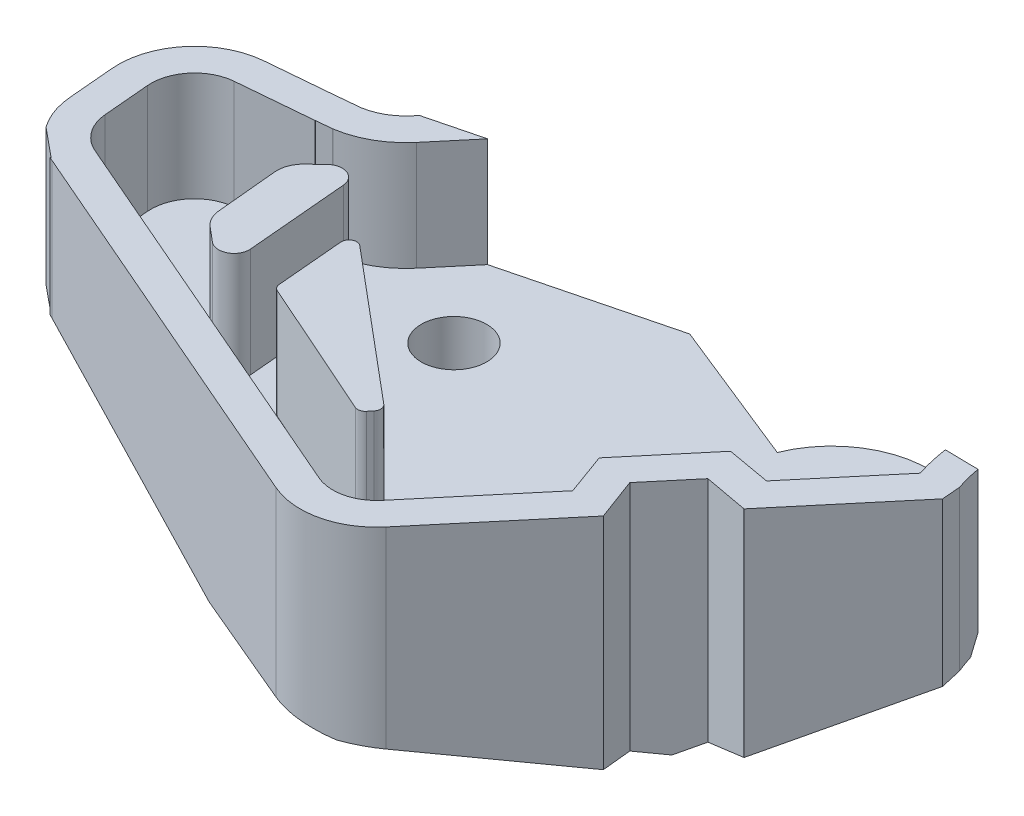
ISO-10303-21;
HEADER;
FILE_DESCRIPTION(('STEP AP214'),'2;1');
FILE_NAME('part.step','',(''),(''),'','','');
FILE_SCHEMA(('AUTOMOTIVE_DESIGN { 1 0 10303 214 1 1 1 1 }'));
ENDSEC;
DATA;
#1=APPLICATION_CONTEXT('core data for automotive mechanical design processes');
#2=APPLICATION_PROTOCOL_DEFINITION('international standard','automotive_design',2000,#1);
#3=PRODUCT_CONTEXT('',#1,'mechanical');
#4=PRODUCT('Part','Part','',(#3));
#5=PRODUCT_RELATED_PRODUCT_CATEGORY('part','',(#4));
#6=PRODUCT_DEFINITION_FORMATION('','',#4);
#7=PRODUCT_DEFINITION_CONTEXT('part definition',#1,'design');
#8=PRODUCT_DEFINITION('design','',#6,#7);
#9=PRODUCT_DEFINITION_SHAPE('','',#8);
#10=(LENGTH_UNIT() NAMED_UNIT(*) SI_UNIT(.MILLI.,.METRE.));
#11=(NAMED_UNIT(*) PLANE_ANGLE_UNIT() SI_UNIT($,.RADIAN.));
#12=(NAMED_UNIT(*) SI_UNIT($,.STERADIAN.) SOLID_ANGLE_UNIT());
#13=UNCERTAINTY_MEASURE_WITH_UNIT(LENGTH_MEASURE(1.E-05),#10,'distance_accuracy_value','');
#14=(GEOMETRIC_REPRESENTATION_CONTEXT(3) GLOBAL_UNCERTAINTY_ASSIGNED_CONTEXT((#13)) GLOBAL_UNIT_ASSIGNED_CONTEXT((#10,
#11,#12)) REPRESENTATION_CONTEXT('',''));
#15=CARTESIAN_POINT('',(0.,0.,0.));
#16=DIRECTION('',(0.,0.,1.));
#17=DIRECTION('',(1.,0.,0.));
#18=AXIS2_PLACEMENT_3D('',#15,#16,#17);
#19=CARTESIAN_POINT('',(-253.8478051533,-4.49999999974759,585.680385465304));
#20=DIRECTION('',(0.397677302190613,0.,-0.917525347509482));
#21=DIRECTION('',(-0.917525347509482,0.,-0.397677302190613));
#22=AXIS2_PLACEMENT_3D('',#19,#20,#21);
#23=PLANE('',#22);
#24=DIRECTION('',(0.906656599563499,-0.153463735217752,0.392966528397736));
#25=VECTOR('',#24,1.);
#26=CARTESIAN_POINT('',(-320.490482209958,-467.684907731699,556.795864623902));
#27=LINE('',#26,#25);
#28=CARTESIAN_POINT('',(-3093.77388629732,1.7303374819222,-645.211104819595));
#29=VERTEX_POINT('',#28);
#30=CARTESIAN_POINT('',(-3081.03815876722,-0.425354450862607,-639.691137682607));
#31=VERTEX_POINT('',#30);
#32=EDGE_CURVE('E595',#29,#31,#27,.T.);
#33=ORIENTED_EDGE('',*,*,#32,.T.);
#34=DIRECTION('',(-0.917391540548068,-0.0170777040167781,-0.397619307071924));
#35=VECTOR('',#34,1.);
#36=CARTESIAN_POINT('',(-254.665685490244,52.188987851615,585.325896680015));
#37=LINE('',#36,#35);
#38=CARTESIAN_POINT('',(-3075.62109987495,-0.324513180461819,-637.343255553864));
#39=VERTEX_POINT('',#38);
#40=EDGE_CURVE('E605',#39,#31,#37,.T.);
#41=ORIENTED_EDGE('',*,*,#40,.F.);
#42=DIRECTION('',(0.,1.,0.));
#43=VECTOR('',#42,1.);
#44=CARTESIAN_POINT('',(-3075.62109987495,-4.49999999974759,-637.343255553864));
#45=LINE('',#44,#43);
#46=CARTESIAN_POINT('',(-3075.62109987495,8.,-637.343255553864));
#47=VERTEX_POINT('',#46);
#48=EDGE_CURVE('E1369',#39,#47,#45,.T.);
#49=ORIENTED_EDGE('',*,*,#48,.T.);
#50=DIRECTION('',(-0.917525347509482,0.,-0.397677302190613));
#51=VECTOR('',#50,1.);
#52=CARTESIAN_POINT('',(-253.8478051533,8.,585.680385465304));
#53=LINE('',#52,#51);
#54=CARTESIAN_POINT('',(-3093.77388629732,8.,-645.211104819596));
#55=VERTEX_POINT('',#54);
#56=EDGE_CURVE('E1559',#47,#55,#53,.T.);
#57=ORIENTED_EDGE('',*,*,#56,.T.);
#58=DIRECTION('',(0.,1.,0.));
#59=VECTOR('',#58,1.);
#60=CARTESIAN_POINT('',(-3093.77388629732,-4.49999999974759,-645.211104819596));
#61=LINE('',#60,#59);
#62=EDGE_CURVE('E68',#29,#55,#61,.T.);
#63=ORIENTED_EDGE('',*,*,#62,.F.);
#64=EDGE_LOOP('',(#33,#41,#49,#57,#63));
#65=FACE_BOUND('',#64,.T.);
#66=ADVANCED_FACE('F53',(#65),#23,.F.);
#67=CARTESIAN_POINT('',(-155.946730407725,-600.462790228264,125.30550593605));
#68=DIRECTION('',(-0.246395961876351,-0.948731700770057,0.197982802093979));
#69=DIRECTION('',(0.967890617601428,-0.251371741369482,0.));
#70=AXIS2_PLACEMENT_3D('',#67,#68,#69);
#71=PLANE('',#70);
#72=DIRECTION('',(-0.493585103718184,0.298643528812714,0.816814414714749));
#73=VECTOR('',#72,1.);
#74=CARTESIAN_POINT('',(-3080.32516384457,-0.856751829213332,-640.871044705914));
#75=LINE('',#74,#73);
#76=CARTESIAN_POINT('',(-3074.30376089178,-4.49999999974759,-650.835625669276));
#77=VERTEX_POINT('',#76);
#78=EDGE_CURVE('E591',#77,#31,#75,.T.);
#79=ORIENTED_EDGE('',*,*,#78,.T.);
#80=ORIENTED_EDGE('',*,*,#32,.F.);
#81=CARTESIAN_POINT('',(-3092.38201573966,0.698706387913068,-648.422443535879));
#82=DIRECTION('',(-0.246395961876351,-0.948731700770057,0.197982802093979));
#83=DIRECTION('',(-0.739565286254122,0.316082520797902,0.59425165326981));
#84=AXIS2_PLACEMENT_3D('',#81,#82,#83);
#85=ELLIPSE('',#84,3.68913571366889,3.50000000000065);
#86=CARTESIAN_POINT('',(-3093.92460586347,1.75495322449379,-645.280721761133));
#87=VERTEX_POINT('',#86);
#88=EDGE_CURVE('E612',#29,#87,#85,.T.);
#89=ORIENTED_EDGE('',*,*,#88,.T.);
#90=DIRECTION('',(-0.928918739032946,0.289442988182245,0.230938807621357));
#91=VECTOR('',#90,1.);
#92=CARTESIAN_POINT('',(-3095.57227382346,2.26835220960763,-644.871094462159));
#93=LINE('',#92,#91);
#94=CARTESIAN_POINT('',(-3093.89030021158,1.74426388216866,-645.289250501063));
#95=VERTEX_POINT('',#94);
#96=EDGE_CURVE('E982',#95,#87,#93,.T.);
#97=ORIENTED_EDGE('',*,*,#96,.F.);
#98=DIRECTION('',(0.770181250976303,-0.0676734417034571,0.634224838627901));
#99=VECTOR('',#98,1.);
#100=CARTESIAN_POINT('',(-3094.21635428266,1.77291324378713,-645.557747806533));
#101=LINE('',#100,#99);
#102=CARTESIAN_POINT('',(-3093.89160826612,1.74437881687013,-645.290327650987));
#103=VERTEX_POINT('',#102);
#104=EDGE_CURVE('E977',#103,#95,#101,.T.);
#105=ORIENTED_EDGE('',*,*,#104,.F.);
#106=DIRECTION('',(0.919884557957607,-0.293248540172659,-0.260418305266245));
#107=VECTOR('',#106,1.);
#108=CARTESIAN_POINT('',(-3074.30621942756,-4.49921624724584,-650.83492966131));
#109=LINE('',#108,#107);
#110=EDGE_CURVE('E597',#103,#77,#109,.T.);
#111=ORIENTED_EDGE('',*,*,#110,.T.);
#112=EDGE_LOOP('',(#79,#80,#89,#97,#105,#111));
#113=FACE_BOUND('',#112,.T.);
#114=ADVANCED_FACE('F593',(#113),#71,.T.);
#115=CARTESIAN_POINT('',(-3089.19145536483,8.,-656.862548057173));
#116=DIRECTION('',(0.,1.,0.));
#117=DIRECTION('',(-0.984807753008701,0.,0.173648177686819));
#118=AXIS2_PLACEMENT_3D('',#115,#116,#117);
#119=PLANE('',#118);
#120=CARTESIAN_POINT('',(-3092.38201573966,8.,-648.422443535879));
#121=DIRECTION('',(0.,1.,0.));
#122=DIRECTION('',(0.,0.,1.));
#123=AXIS2_PLACEMENT_3D('',#120,#121,#122);
#124=CIRCLE('',#123,3.50000000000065);
#125=CARTESIAN_POINT('',(-3093.92460586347,8.,-645.280721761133));
#126=VERTEX_POINT('',#125);
#127=EDGE_CURVE('E1583',#126,#55,#124,.T.);
#128=ORIENTED_EDGE('',*,*,#127,.T.);
#129=ORIENTED_EDGE('',*,*,#56,.F.);
#130=CARTESIAN_POINT('',(-3074.22922931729,8.,-640.554594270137));
#131=DIRECTION('',(0.,1.,0.));
#132=DIRECTION('',(0.,0.,1.));
#133=AXIS2_PLACEMENT_3D('',#130,#131,#132);
#134=CIRCLE('',#133,3.49999999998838);
#135=CARTESIAN_POINT('',(-3071.54807376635,8.,-638.304837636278));
#136=VERTEX_POINT('',#135);
#137=EDGE_CURVE('E1556',#47,#136,#134,.T.);
#138=ORIENTED_EDGE('',*,*,#137,.T.);
#139=DIRECTION('',(-0.642787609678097,0.,0.766044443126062));
#140=VECTOR('',#139,1.);
#141=CARTESIAN_POINT('',(-2116.76217617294,8.,-1776.17436127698));
#142=LINE('',#141,#140);
#143=CARTESIAN_POINT('',(-3066.99440241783,8.,-643.731691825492));
#144=VERTEX_POINT('',#143);
#145=EDGE_CURVE('E1548',#144,#136,#142,.T.);
#146=ORIENTED_EDGE('',*,*,#145,.F.);
#147=DIRECTION('',(0.342020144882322,0.,0.939692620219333));
#148=VECTOR('',#147,1.);
#149=CARTESIAN_POINT('',(-3067.29060055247,8.,-644.545489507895));
#150=LINE('',#149,#148);
#151=CARTESIAN_POINT('',(-3067.00158799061,8.,-643.75143402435));
#152=VERTEX_POINT('',#151);
#153=EDGE_CURVE('E1093',#152,#144,#150,.T.);
#154=ORIENTED_EDGE('',*,*,#153,.F.);
#155=DIRECTION('',(-0.642787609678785,0.,0.766044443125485));
#156=VECTOR('',#155,1.);
#157=CARTESIAN_POINT('',(-3064.05904434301,8.,-647.258220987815));
#158=LINE('',#157,#156);
#159=CARTESIAN_POINT('',(-3067.00169971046,8.,-643.751300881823));
#160=VERTEX_POINT('',#159);
#161=EDGE_CURVE('E1066',#152,#160,#158,.T.);
#162=ORIENTED_EDGE('',*,*,#161,.T.);
#163=DIRECTION('',(0.348771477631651,0.,0.937207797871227));
#164=VECTOR('',#163,1.);
#165=CARTESIAN_POINT('',(-3067.71389807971,8.,-645.665098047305));
#166=LINE('',#165,#164);
#167=CARTESIAN_POINT('',(-3067.71389807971,8.,-645.665098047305));
#168=VERTEX_POINT('',#167);
#169=EDGE_CURVE('E1026',#168,#160,#166,.T.);
#170=ORIENTED_EDGE('',*,*,#169,.F.);
#171=DIRECTION('',(0.642787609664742,0.,-0.766044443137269));
#172=VECTOR('',#171,1.);
#173=CARTESIAN_POINT('',(-3067.71389807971,8.,-645.665098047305));
#174=LINE('',#173,#172);
#175=CARTESIAN_POINT('',(-3066.0783421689,8.,-647.614277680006));
#176=VERTEX_POINT('',#175);
#177=EDGE_CURVE('E1085',#168,#176,#174,.T.);
#178=ORIENTED_EDGE('',*,*,#177,.T.);
#179=DIRECTION('',(-0.983519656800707,0.,-0.180801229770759));
#180=VECTOR('',#179,1.);
#181=CARTESIAN_POINT('',(-3064.0700596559,8.,-647.2450934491));
#182=LINE('',#181,#180);
#183=CARTESIAN_POINT('',(-3064.0700596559,8.,-647.245093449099));
#184=VERTEX_POINT('',#183);
#185=EDGE_CURVE('E1021',#184,#176,#182,.T.);
#186=ORIENTED_EDGE('',*,*,#185,.F.);
#187=DIRECTION('',(0.984807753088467,0.,0.173648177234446));
#188=VECTOR('',#187,1.);
#189=CARTESIAN_POINT('',(-3072.77875012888,8.,-648.780670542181));
#190=LINE('',#189,#188);
#191=CARTESIAN_POINT('',(-3064.04936962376,8.,-647.24144523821));
#192=VERTEX_POINT('',#191);
#193=EDGE_CURVE('E1088',#184,#192,#190,.T.);
#194=ORIENTED_EDGE('',*,*,#193,.T.);
#195=DIRECTION('',(-0.642787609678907,0.,0.766044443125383));
#196=VECTOR('',#195,1.);
#197=CARTESIAN_POINT('',(-3067.55107281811,8.,-643.068277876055));
#198=LINE('',#197,#196);
#199=CARTESIAN_POINT('',(-3059.89010493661,8.,-652.19826387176));
#200=VERTEX_POINT('',#199);
#201=EDGE_CURVE('E1135',#200,#192,#198,.T.);
#202=ORIENTED_EDGE('',*,*,#201,.F.);
#203=DIRECTION('',(0.084570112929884,0.,0.996417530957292));
#204=VECTOR('',#203,1.);
#205=CARTESIAN_POINT('',(-2983.04656823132,8.,253.183607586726));
#206=LINE('',#205,#204);
#207=CARTESIAN_POINT('',(-3059.96162031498,8.,-653.040868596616));
#208=VERTEX_POINT('',#207);
#209=EDGE_CURVE('E1546',#208,#200,#206,.T.);
#210=ORIENTED_EDGE('',*,*,#209,.F.);
#211=CARTESIAN_POINT('',(-3052.16078909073,8.,-655.64068964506));
#212=DIRECTION('',(0.,1.,0.));
#213=DIRECTION('',(0.,0.,1.));
#214=AXIS2_PLACEMENT_3D('',#211,#212,#213);
#215=CIRCLE('',#214,8.22265390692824);
#216=CARTESIAN_POINT('',(-3060.25333872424,8.,-654.183748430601));
#217=VERTEX_POINT('',#216);
#218=EDGE_CURVE('E1544',#217,#208,#215,.T.);
#219=ORIENTED_EDGE('',*,*,#218,.F.);
#220=DIRECTION('',(0.999849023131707,0.,0.0173761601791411));
#221=VECTOR('',#220,1.);
#222=CARTESIAN_POINT('',(-3058.25325190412,8.,-654.148989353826));
#223=LINE('',#222,#221);
#224=CARTESIAN_POINT('',(-3061.7776393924,8.,-654.210238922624));
#225=VERTEX_POINT('',#224);
#226=EDGE_CURVE('E1074',#225,#217,#223,.T.);
#227=ORIENTED_EDGE('',*,*,#226,.F.);
#228=CARTESIAN_POINT('',(-3052.16078909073,8.,-655.64068964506));
#229=DIRECTION('',(0.,-1.,0.));
#230=DIRECTION('',(0.,0.,-1.));
#231=AXIS2_PLACEMENT_3D('',#228,#229,#230);
#232=CIRCLE('',#231,9.72265390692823);
#233=CARTESIAN_POINT('',(-3061.4417824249,8.,-652.743594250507));
#234=VERTEX_POINT('',#233);
#235=EDGE_CURVE('E1044',#234,#225,#232,.T.);
#236=ORIENTED_EDGE('',*,*,#235,.F.);
#237=DIRECTION('',(-0.0845701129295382,0.,-0.996417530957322));
#238=VECTOR('',#237,1.);
#239=CARTESIAN_POINT('',(-3061.43708361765,8.,-652.688232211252));
#240=LINE('',#239,#238);
#241=CARTESIAN_POINT('',(-3061.43708361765,8.,-652.688232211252));
#242=VERTEX_POINT('',#241);
#243=EDGE_CURVE('E1067',#242,#234,#240,.T.);
#244=ORIENTED_EDGE('',*,*,#243,.F.);
#245=DIRECTION('',(0.642787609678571,0.,-0.766044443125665));
#246=VECTOR('',#245,1.);
#247=CARTESIAN_POINT('',(-3064.6417658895,8.,-648.869040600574));
#248=LINE('',#247,#246);
#249=CARTESIAN_POINT('',(-3064.6417658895,8.,-648.869040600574));
#250=VERTEX_POINT('',#249);
#251=EDGE_CURVE('E1105',#250,#242,#248,.T.);
#252=ORIENTED_EDGE('',*,*,#251,.F.);
#253=DIRECTION('',(0.984807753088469,0.,0.173648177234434));
#254=VECTOR('',#253,1.);
#255=CARTESIAN_POINT('',(-3066.64800087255,8.,-649.222793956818));
#256=LINE('',#255,#254);
#257=CARTESIAN_POINT('',(-3066.64800087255,8.,-649.222793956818));
#258=VERTEX_POINT('',#257);
#259=EDGE_CURVE('E1110',#258,#250,#256,.T.);
#260=ORIENTED_EDGE('',*,*,#259,.F.);
#261=DIRECTION('',(0.642787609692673,0.,-0.766044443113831));
#262=VECTOR('',#261,1.);
#263=CARTESIAN_POINT('',(-3069.39689758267,8.,-645.946786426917));
#264=LINE('',#263,#262);
#265=CARTESIAN_POINT('',(-3069.39689758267,8.,-645.946786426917));
#266=VERTEX_POINT('',#265);
#267=EDGE_CURVE('E1115',#266,#258,#264,.T.);
#268=ORIENTED_EDGE('',*,*,#267,.F.);
#269=DIRECTION('',(-0.342020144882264,0.,-0.939692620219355));
#270=VECTOR('',#269,1.);
#271=CARTESIAN_POINT('',(-3068.7001394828,8.,-644.032459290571));
#272=LINE('',#271,#270);
#273=CARTESIAN_POINT('',(-3068.7001394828,8.,-644.032459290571));
#274=VERTEX_POINT('',#273);
#275=EDGE_CURVE('E1119',#274,#266,#272,.T.);
#276=ORIENTED_EDGE('',*,*,#275,.F.);
#277=DIRECTION('',(0.642787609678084,0.,-0.766044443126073));
#278=VECTOR('',#277,1.);
#279=CARTESIAN_POINT('',(-3072.69714043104,8.,-639.269019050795));
#280=LINE('',#279,#278);
#281=CARTESIAN_POINT('',(-3072.69714043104,8.,-639.269019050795));
#282=VERTEX_POINT('',#281);
#283=EDGE_CURVE('E1123',#282,#274,#280,.T.);
#284=ORIENTED_EDGE('',*,*,#283,.F.);
#285=CARTESIAN_POINT('',(-3074.22922931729,8.,-640.554594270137));
#286=DIRECTION('',(0.,1.,0.));
#287=DIRECTION('',(-0.984807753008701,0.,0.173648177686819));
#288=AXIS2_PLACEMENT_3D('',#285,#286,#287);
#289=CIRCLE('',#288,1.99999999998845);
#290=CARTESIAN_POINT('',(-3075.02458392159,8.,-638.719543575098));
#291=VERTEX_POINT('',#290);
#292=EDGE_CURVE('E1128',#291,#282,#289,.T.);
#293=ORIENTED_EDGE('',*,*,#292,.F.);
#294=DIRECTION('',(0.917525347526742,0.,0.39767730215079));
#295=VECTOR('',#294,1.);
#296=CARTESIAN_POINT('',(-3075.2461601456,8.,-638.81557997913));
#297=LINE('',#296,#295);
#298=CARTESIAN_POINT('',(-3093.17737034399,8.,-646.58739284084));
#299=VERTEX_POINT('',#298);
#300=EDGE_CURVE('E1058',#299,#291,#297,.T.);
#301=ORIENTED_EDGE('',*,*,#300,.F.);
#302=CARTESIAN_POINT('',(-3092.38201573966,8.,-648.422443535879));
#303=DIRECTION('',(0.,1.,0.));
#304=DIRECTION('',(0.,0.,-1.));
#305=AXIS2_PLACEMENT_3D('',#302,#303,#304);
#306=CIRCLE('',#305,2.00000000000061);
#307=CARTESIAN_POINT('',(-3094.37440513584,8.,-648.2481320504));
#308=VERTEX_POINT('',#307);
#309=EDGE_CURVE('E1005',#308,#299,#306,.T.);
#310=ORIENTED_EDGE('',*,*,#309,.F.);
#311=DIRECTION('',(0.087155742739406,0.,0.996194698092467));
#312=VECTOR('',#311,1.);
#313=CARTESIAN_POINT('',(-3094.37440513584,8.,-648.2481320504));
#314=LINE('',#313,#312);
#315=CARTESIAN_POINT('',(-3094.5600391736,8.,-650.369938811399));
#316=VERTEX_POINT('',#315);
#317=EDGE_CURVE('E1010',#316,#308,#314,.T.);
#318=ORIENTED_EDGE('',*,*,#317,.F.);
#319=CARTESIAN_POINT('',(-3092.56764977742,8.,-650.544250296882));
#320=DIRECTION('',(0.,1.,0.));
#321=DIRECTION('',(0.,0.,-1.));
#322=AXIS2_PLACEMENT_3D('',#319,#320,#321);
#323=CIRCLE('',#322,2.00000000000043);
#324=CARTESIAN_POINT('',(-3092.7419612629,8.,-652.536639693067));
#325=VERTEX_POINT('',#324);
#326=EDGE_CURVE('E1015',#325,#316,#323,.T.);
#327=ORIENTED_EDGE('',*,*,#326,.F.);
#328=DIRECTION('',(-0.99619469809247,0.,0.0871557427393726));
#329=VECTOR('',#328,1.);
#330=CARTESIAN_POINT('',(-3092.7419612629,8.,-652.536639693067));
#331=LINE('',#330,#329);
#332=CARTESIAN_POINT('',(-3089.32171469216,8.,-652.835872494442));
#333=VERTEX_POINT('',#332);
#334=EDGE_CURVE('E1019',#333,#325,#331,.T.);
#335=ORIENTED_EDGE('',*,*,#334,.F.);
#336=DIRECTION('',(-0.642787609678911,0.,0.766044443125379));
#337=VECTOR('',#336,1.);
#338=CARTESIAN_POINT('',(-3089.32171469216,8.,-652.835872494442));
#339=LINE('',#338,#337);
#340=CARTESIAN_POINT('',(-3089.31784058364,8.,-652.840489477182));
#341=VERTEX_POINT('',#340);
#342=EDGE_CURVE('E1032',#341,#333,#339,.T.);
#343=ORIENTED_EDGE('',*,*,#342,.F.);
#344=DIRECTION('',(0.995585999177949,0.,-0.0938537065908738));
#345=VECTOR('',#344,1.);
#346=CARTESIAN_POINT('',(-3089.94871323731,8.,-652.781017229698));
#347=LINE('',#346,#345);
#348=CARTESIAN_POINT('',(-3088.60878095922,8.,-652.907332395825));
#349=VERTEX_POINT('',#348);
#350=EDGE_CURVE('E819',#341,#349,#347,.T.);
#351=ORIENTED_EDGE('',*,*,#350,.T.);
#352=CARTESIAN_POINT('',(-3088.61853369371,8.,-653.207173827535));
#353=DIRECTION('',(0.,-1.,0.));
#354=DIRECTION('',(0.154843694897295,0.,0.987938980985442));
#355=AXIS2_PLACEMENT_3D('',#352,#353,#354);
#356=CIRCLE('',#355,0.299999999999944);
#357=CARTESIAN_POINT('',(-3088.57208058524,8.,-652.91079213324));
#358=VERTEX_POINT('',#357);
#359=EDGE_CURVE('E1231',#358,#349,#356,.T.);
#360=ORIENTED_EDGE('',*,*,#359,.F.);
#361=CARTESIAN_POINT('',(-3089.19145536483,8.,-656.862548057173));
#362=DIRECTION('',(0.,-1.,0.));
#363=DIRECTION('',(-0.984807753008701,0.,0.173648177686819));
#364=AXIS2_PLACEMENT_3D('',#361,#362,#363);
#365=CIRCLE('',#364,3.99999999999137);
#366=CARTESIAN_POINT('',(-3086.12727759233,8.,-654.291397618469));
#367=VERTEX_POINT('',#366);
#368=EDGE_CURVE('E1154',#367,#358,#365,.T.);
#369=ORIENTED_EDGE('',*,*,#368,.F.);
#370=DIRECTION('',(-0.642787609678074,0.,0.766044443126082));
#371=VECTOR('',#370,1.);
#372=CARTESIAN_POINT('',(-3083.97834492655,8.,-656.852395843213));
#373=LINE('',#372,#371);
#374=CARTESIAN_POINT('',(-3084.63989783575,8.,-656.063987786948));
#375=VERTEX_POINT('',#374);
#376=EDGE_CURVE('E1137',#375,#367,#373,.T.);
#377=ORIENTED_EDGE('',*,*,#376,.F.);
#378=DIRECTION('',(-0.969080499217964,0.,0.246744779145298));
#379=VECTOR('',#378,1.);
#380=CARTESIAN_POINT('',(-3089.99449682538,8.,-654.700613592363));
#381=LINE('',#380,#379);
#382=CARTESIAN_POINT('',(-3087.13002233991,8.,-655.429958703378));
#383=VERTEX_POINT('',#382);
#384=EDGE_CURVE('E813',#375,#383,#381,.T.);
#385=ORIENTED_EDGE('',*,*,#384,.T.);
#386=DIRECTION('',(0.642787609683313,0.,-0.766044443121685));
#387=VECTOR('',#386,1.);
#388=CARTESIAN_POINT('',(-2134.33851492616,8.,-1790.92266066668));
#389=LINE('',#388,#387);
#390=CARTESIAN_POINT('',(-3087.27634425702,8.,-655.255579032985));
#391=VERTEX_POINT('',#390);
#392=EDGE_CURVE('E1496',#391,#383,#389,.T.);
#393=ORIENTED_EDGE('',*,*,#392,.F.);
#394=CARTESIAN_POINT('',(-3089.19145536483,8.,-656.862548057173));
#395=DIRECTION('',(0.,1.,0.));
#396=DIRECTION('',(0.,0.,1.));
#397=AXIS2_PLACEMENT_3D('',#394,#395,#396);
#398=CIRCLE('',#397,2.49999999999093);
#399=CARTESIAN_POINT('',(-3088.76415722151,8.,-654.399335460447));
#400=VERTEX_POINT('',#399);
#401=EDGE_CURVE('E1550',#400,#391,#398,.T.);
#402=ORIENTED_EDGE('',*,*,#401,.F.);
#403=DIRECTION('',(0.995585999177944,0.,-0.0938537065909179));
#404=VECTOR('',#403,1.);
#405=CARTESIAN_POINT('',(-88.3541404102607,8.,-937.247428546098));
#406=LINE('',#405,#404);
#407=CARTESIAN_POINT('',(-3090.07132359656,8.,-654.276109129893));
#408=VERTEX_POINT('',#407);
#409=EDGE_CURVE('E1592',#408,#400,#406,.T.);
#410=ORIENTED_EDGE('',*,*,#409,.F.);
#411=DIRECTION('',(0.642787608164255,0.,-0.766044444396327));
#412=VECTOR('',#411,1.);
#413=CARTESIAN_POINT('',(-2135.49638716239,8.,-1791.8942236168));
#414=LINE('',#413,#412);
#415=CARTESIAN_POINT('',(-3090.07140433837,8.,-654.276012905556));
#416=VERTEX_POINT('',#415);
#417=EDGE_CURVE('E1590',#416,#408,#414,.T.);
#418=ORIENTED_EDGE('',*,*,#417,.F.);
#419=DIRECTION('',(0.996194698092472,0.,-0.0871557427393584));
#420=VECTOR('',#419,1.);
#421=CARTESIAN_POINT('',(-80.2794826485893,8.,-917.598685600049));
#422=LINE('',#421,#420);
#423=CARTESIAN_POINT('',(-3092.87269487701,8.,-654.030931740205));
#424=VERTEX_POINT('',#423);
#425=EDGE_CURVE('E647',#424,#416,#422,.T.);
#426=ORIENTED_EDGE('',*,*,#425,.F.);
#427=CARTESIAN_POINT('',(-3092.56764977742,8.,-650.544250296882));
#428=DIRECTION('',(0.,1.,0.));
#429=DIRECTION('',(0.,0.,1.));
#430=AXIS2_PLACEMENT_3D('',#427,#428,#429);
#431=CIRCLE('',#430,3.50000000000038);
#432=CARTESIAN_POINT('',(-3096.05433122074,8.,-650.23920519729));
#433=VERTEX_POINT('',#432);
#434=EDGE_CURVE('E1585',#424,#433,#431,.T.);
#435=ORIENTED_EDGE('',*,*,#434,.T.);
#436=DIRECTION('',(-0.0871557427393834,0.,-0.99619469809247));
#437=VECTOR('',#436,1.);
#438=CARTESIAN_POINT('',(-3016.07989367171,8.,263.872798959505));
#439=LINE('',#438,#437);
#440=CARTESIAN_POINT('',(-3095.86869718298,8.,-648.11739843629));
#441=VERTEX_POINT('',#440);
#442=EDGE_CURVE('E1579',#441,#433,#439,.T.);
#443=ORIENTED_EDGE('',*,*,#442,.F.);
#444=CARTESIAN_POINT('',(-3095.237672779,8.,-646.398777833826));
#445=VERTEX_POINT('',#444);
#446=EDGE_CURVE('E1581',#441,#445,#124,.T.);
#447=ORIENTED_EDGE('',*,*,#446,.T.);
#448=DIRECTION('',(-0.771950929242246,0.,-0.635682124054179));
#449=VECTOR('',#448,1.);
#450=CARTESIAN_POINT('',(-3093.89030021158,8.,-645.289250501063));
#451=LINE('',#450,#449);
#452=CARTESIAN_POINT('',(-3093.89030021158,8.,-645.289250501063));
#453=VERTEX_POINT('',#452);
#454=EDGE_CURVE('E980',#453,#445,#451,.T.);
#455=ORIENTED_EDGE('',*,*,#454,.F.);
#456=DIRECTION('',(0.970458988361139,0.,-0.241266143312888));
#457=VECTOR('',#456,1.);
#458=CARTESIAN_POINT('',(-3093.89030021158,8.,-645.289250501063));
#459=LINE('',#458,#457);
#460=EDGE_CURVE('E985',#126,#453,#459,.T.);
#461=ORIENTED_EDGE('',*,*,#460,.F.);
#462=EDGE_LOOP('',(#128,#129,#138,#146,#154,#162,#170,#178,#186,#194,#202,#210,#219,#227,#236,
#244,#252,#260,#268,#276,#284,#293,#301,#310,#318,#327,#335,#343,#351,#360,#369,#377,#385,#393,
#402,#410,#418,#426,#435,#443,#447,#455,#461));
#463=FACE_BOUND('',#462,.T.);
#464=ADVANCED_FACE('F1241',(#463),#119,.T.);
#465=CARTESIAN_POINT('',(-0.881636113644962,-308.438525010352,-447.319586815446));
#466=DIRECTION('',(-0.00162259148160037,-0.567660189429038,-0.823261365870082));
#467=DIRECTION('',(0.,0.823262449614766,-0.567660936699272));
#468=AXIS2_PLACEMENT_3D('',#465,#466,#467);
#469=PLANE('',#468);
#470=DIRECTION('',(-0.97237659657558,0.193055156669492,-0.13120007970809));
#471=VECTOR('',#470,1.);
#472=CARTESIAN_POINT('',(-85.3134293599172,-597.932625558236,-247.539442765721));
#473=LINE('',#472,#471);
#474=CARTESIAN_POINT('',(-3085.28749399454,-2.31929519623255,-652.317630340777));
#475=VERTEX_POINT('',#474);
#476=CARTESIAN_POINT('',(-3094.37189948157,-0.515681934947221,-653.543364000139));
#477=VERTEX_POINT('',#476);
#478=EDGE_CURVE('E919',#475,#477,#473,.T.);
#479=ORIENTED_EDGE('',*,*,#478,.T.);
#480=CARTESIAN_POINT('',(-3092.56764977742,-4.87036815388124,-650.544250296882));
#481=DIRECTION('',(-0.00162259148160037,-0.567660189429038,-0.823261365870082));
#482=DIRECTION('',(-0.00111881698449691,0.823262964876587,-0.567659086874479));
#483=AXIS2_PLACEMENT_3D('',#480,#481,#482);
#484=ELLIPSE('',#483,6.16566048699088,3.50000000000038);
#485=CARTESIAN_POINT('',(-3094.36411400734,-0.508931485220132,-653.548033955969));
#486=VERTEX_POINT('',#485);
#487=EDGE_CURVE('E661',#477,#486,#484,.T.);
#488=ORIENTED_EDGE('',*,*,#487,.T.);
#489=DIRECTION('',(0.972265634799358,-0.193435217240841,0.131462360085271));
#490=VECTOR('',#489,1.);
#491=CARTESIAN_POINT('',(-85.8218798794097,-599.067596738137,-246.755848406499));
#492=LINE('',#491,#490);
#493=CARTESIAN_POINT('',(-3085.28734220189,-2.31478295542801,-652.320741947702));
#494=VERTEX_POINT('',#493);
#495=EDGE_CURVE('E657',#486,#494,#492,.T.);
#496=ORIENTED_EDGE('',*,*,#495,.T.);
#497=CARTESIAN_POINT('',(-3082.29098177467,-2.5375964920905,-652.173011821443));
#498=DIRECTION('',(-0.00162259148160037,-0.567660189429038,-0.823261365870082));
#499=DIRECTION('',(0.00111881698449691,-0.823262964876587,0.567659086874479));
#500=AXIS2_PLACEMENT_3D('',#497,#498,#499);
#501=ELLIPSE('',#500,5.28485184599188,3.00000000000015);
#502=EDGE_CURVE('E1213',#494,#475,#501,.F.);
#503=ORIENTED_EDGE('',*,*,#502,.T.);
#504=EDGE_LOOP('',(#479,#488,#496,#503));
#505=FACE_BOUND('',#504,.T.);
#506=ADVANCED_FACE('F55',(#505),#469,.T.);
#507=CARTESIAN_POINT('',(-3093.89030021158,8.,-645.289250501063));
#508=DIRECTION('',(-0.63568212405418,0.,0.771950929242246));
#509=DIRECTION('',(0.771950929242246,0.,0.63568212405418));
#510=AXIS2_PLACEMENT_3D('',#507,#508,#509);
#511=PLANE('',#510);
#512=ORIENTED_EDGE('',*,*,#454,.T.);
#513=DIRECTION('',(0.,1.,0.));
#514=VECTOR('',#513,1.);
#515=CARTESIAN_POINT('',(-3095.237672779,-4.49999999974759,-646.398777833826));
#516=LINE('',#515,#514);
#517=CARTESIAN_POINT('',(-3095.237672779,1.75000000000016,-646.398777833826));
#518=VERTEX_POINT('',#517);
#519=EDGE_CURVE('E664',#445,#518,#516,.F.);
#520=ORIENTED_EDGE('',*,*,#519,.T.);
#521=DIRECTION('',(0.771950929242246,0.,0.63568212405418));
#522=VECTOR('',#521,1.);
#523=CARTESIAN_POINT('',(-3093.89030021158,1.75000000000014,-645.289250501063));
#524=LINE('',#523,#522);
#525=CARTESIAN_POINT('',(-3094.2251492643,1.75000000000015,-645.564990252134));
#526=VERTEX_POINT('',#525);
#527=EDGE_CURVE('E922',#518,#526,#524,.T.);
#528=ORIENTED_EDGE('',*,*,#527,.T.);
#529=DIRECTION('',(0.113426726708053,-0.989146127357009,0.0934040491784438));
#530=VECTOR('',#529,1.);
#531=CARTESIAN_POINT('',(-3094.9191424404,7.80201862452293,-646.136476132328));
#532=LINE('',#531,#530);
#533=CARTESIAN_POINT('',(-3094.22789301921,1.77392711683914,-645.567249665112));
#534=VERTEX_POINT('',#533);
#535=EDGE_CURVE('E975',#534,#526,#532,.T.);
#536=ORIENTED_EDGE('',*,*,#535,.F.);
#537=CARTESIAN_POINT('',(-3093.95558210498,1.75000000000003,-645.343008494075));
#538=VERTEX_POINT('',#537);
#539=EDGE_CURVE('E981',#534,#538,#101,.T.);
#540=ORIENTED_EDGE('',*,*,#539,.T.);
#541=DIRECTION('',(-0.771950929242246,0.,-0.63568212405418));
#542=VECTOR('',#541,1.);
#543=CARTESIAN_POINT('',(-3093.89030021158,1.75000000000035,-645.289250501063));
#544=LINE('',#543,#542);
#545=CARTESIAN_POINT('',(-3093.89259411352,1.75000000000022,-645.291139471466));
#546=VERTEX_POINT('',#545);
#547=EDGE_CURVE('E998',#546,#538,#544,.T.);
#548=ORIENTED_EDGE('',*,*,#547,.F.);
#549=DIRECTION('',(-0.171022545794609,0.975149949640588,-0.140832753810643));
#550=VECTOR('',#549,1.);
#551=CARTESIAN_POINT('',(-3094.93481044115,7.6925919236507,-646.149378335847));
#552=LINE('',#551,#550);
#553=EDGE_CURVE('E999',#103,#546,#552,.T.);
#554=ORIENTED_EDGE('',*,*,#553,.F.);
#555=ORIENTED_EDGE('',*,*,#104,.T.);
#556=DIRECTION('',(0.,-1.,0.));
#557=VECTOR('',#556,1.);
#558=CARTESIAN_POINT('',(-3093.89030021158,8.,-645.289250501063));
#559=LINE('',#558,#557);
#560=EDGE_CURVE('E986',#453,#95,#559,.T.);
#561=ORIENTED_EDGE('',*,*,#560,.F.);
#562=EDGE_LOOP('',(#512,#520,#528,#536,#540,#548,#554,#555,#561));
#563=FACE_BOUND('',#562,.T.);
#564=ADVANCED_FACE('F1383',(#563),#511,.T.);
#565=CARTESIAN_POINT('',(-19.0464669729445,329.009951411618,-92.2643930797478));
#566=DIRECTION('',(0.055653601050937,-0.961364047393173,0.269595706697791));
#567=DIRECTION('',(0.,-0.270014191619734,-0.962856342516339));
#568=AXIS2_PLACEMENT_3D('',#565,#566,#567);
#569=PLANE('',#568);
#570=DIRECTION('',(0.632882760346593,-0.174874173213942,-0.754240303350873));
#571=VECTOR('',#570,1.);
#572=CARTESIAN_POINT('',(-2146.05192941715,-256.553716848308,-1741.26819262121));
#573=LINE('',#572,#571);
#574=CARTESIAN_POINT('',(-3071.54807376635,-0.82645866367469,-638.304837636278));
#575=VERTEX_POINT('',#574);
#576=CARTESIAN_POINT('',(-3066.99440241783,-2.08470041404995,-643.731691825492));
#577=VERTEX_POINT('',#576);
#578=EDGE_CURVE('E660',#575,#577,#573,.T.);
#579=ORIENTED_EDGE('',*,*,#578,.F.);
#580=CARTESIAN_POINT('',(-3074.22922931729,-1.61257157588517,-640.554594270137));
#581=DIRECTION('',(0.055653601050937,-0.961364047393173,0.269595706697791));
#582=DIRECTION('',(0.194359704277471,0.275280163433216,0.941512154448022));
#583=AXIS2_PLACEMENT_3D('',#580,#581,#582);
#584=ELLIPSE('',#583,3.64066038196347,3.49999999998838);
#585=CARTESIAN_POINT('',(-3072.84634134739,-0.630871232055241,-637.339377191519));
#586=VERTEX_POINT('',#585);
#587=EDGE_CURVE('E625',#575,#586,#584,.T.);
#588=ORIENTED_EDGE('',*,*,#587,.T.);
#589=DIRECTION('',(0.103250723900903,0.274107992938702,0.956140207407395));
#590=VECTOR('',#589,1.);
#591=CARTESIAN_POINT('',(-2977.16438219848,253.383713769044,248.711246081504));
#592=LINE('',#591,#590);
#593=CARTESIAN_POINT('',(-3073.34035804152,-1.94237704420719,-641.914156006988));
#594=VERTEX_POINT('',#593);
#595=EDGE_CURVE('E969',#594,#586,#592,.T.);
#596=ORIENTED_EDGE('',*,*,#595,.F.);
#597=CARTESIAN_POINT('',(-3073.62417824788,-2.79632524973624,-644.900700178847));
#598=DIRECTION('',(0.055653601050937,-0.961364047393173,0.269595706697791));
#599=DIRECTION('',(-0.194359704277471,-0.275280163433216,-0.941512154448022));
#600=AXIS2_PLACEMENT_3D('',#597,#598,#599);
#601=ELLIPSE('',#600,3.1205660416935,3.00000000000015);
#602=CARTESIAN_POINT('',(-3073.9844821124,-3.65238497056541,-647.878985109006));
#603=VERTEX_POINT('',#602);
#604=EDGE_CURVE('E1218',#594,#603,#601,.F.);
#605=ORIENTED_EDGE('',*,*,#604,.T.);
#606=EDGE_CURVE('E1078',#77,#603,#592,.T.);
#607=ORIENTED_EDGE('',*,*,#606,.F.);
#608=DIRECTION('',(0.860941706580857,0.182951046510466,0.474666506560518));
#609=VECTOR('',#608,1.);
#610=CARTESIAN_POINT('',(-528.887006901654,536.403821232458,752.539386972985));
#611=LINE('',#610,#609);
#612=CARTESIAN_POINT('',(-3066.83195067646,-2.91223222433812,-646.716162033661));
#613=VERTEX_POINT('',#612);
#614=EDGE_CURVE('E1024',#77,#613,#611,.T.);
#615=ORIENTED_EDGE('',*,*,#614,.T.);
#616=DIRECTION('',(0.632882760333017,-0.174874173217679,-0.754240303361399));
#617=VECTOR('',#616,1.);
#618=CARTESIAN_POINT('',(-3068.8946369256,-2.34228376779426,-644.257948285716));
#619=LINE('',#618,#617);
#620=CARTESIAN_POINT('',(-3067.71389807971,-2.66853807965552,-645.665098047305));
#621=VERTEX_POINT('',#620);
#622=EDGE_CURVE('E1082',#621,#613,#619,.T.);
#623=ORIENTED_EDGE('',*,*,#622,.F.);
#624=DIRECTION('',(-0.335590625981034,-0.272316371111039,-0.901788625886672));
#625=VECTOR('',#624,1.);
#626=CARTESIAN_POINT('',(-3066.73893429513,-1.87739977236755,-643.045205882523));
#627=LINE('',#626,#625);
#628=CARTESIAN_POINT('',(-3067.00169971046,-2.09062183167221,-643.751300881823));
#629=VERTEX_POINT('',#628);
#630=EDGE_CURVE('E1028',#629,#621,#627,.T.);
#631=ORIENTED_EDGE('',*,*,#630,.F.);
#632=DIRECTION('',(-0.632882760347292,0.174874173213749,0.754240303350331));
#633=VECTOR('',#632,1.);
#634=CARTESIAN_POINT('',(-3065.26581166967,-2.57027146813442,-645.820051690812));
#635=LINE('',#634,#633);
#636=CARTESIAN_POINT('',(-3067.00158799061,-2.09065270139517,-643.75143402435));
#637=VERTEX_POINT('',#636);
#638=EDGE_CURVE('E1073',#637,#629,#635,.T.);
#639=ORIENTED_EDGE('',*,*,#638,.F.);
#640=DIRECTION('',(0.329068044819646,0.272588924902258,0.904107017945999));
#641=VECTOR('',#640,1.);
#642=CARTESIAN_POINT('',(-3066.36399093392,-1.56248869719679,-641.999650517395));
#643=LINE('',#642,#641);
#644=EDGE_CURVE('E1094',#637,#577,#643,.T.);
#645=ORIENTED_EDGE('',*,*,#644,.T.);
#646=EDGE_LOOP('',(#579,#588,#596,#605,#607,#615,#623,#631,#639,#645));
#647=FACE_BOUND('',#646,.T.);
#648=ADVANCED_FACE('F1328',(#647),#569,.T.);
#649=CARTESIAN_POINT('',(-3093.89030021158,8.,-645.289250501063));
#650=DIRECTION('',(-0.241266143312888,0.,-0.970458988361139));
#651=DIRECTION('',(-0.970458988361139,0.,0.241266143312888));
#652=AXIS2_PLACEMENT_3D('',#649,#650,#651);
#653=PLANE('',#652);
#654=ORIENTED_EDGE('',*,*,#96,.T.);
#655=DIRECTION('',(0.,1.,0.));
#656=VECTOR('',#655,1.);
#657=CARTESIAN_POINT('',(-3093.92460586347,-4.49999999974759,-645.280721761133));
#658=LINE('',#657,#656);
#659=EDGE_CURVE('E610',#87,#126,#658,.T.);
#660=ORIENTED_EDGE('',*,*,#659,.T.);
#661=ORIENTED_EDGE('',*,*,#460,.T.);
#662=ORIENTED_EDGE('',*,*,#560,.T.);
#663=EDGE_LOOP('',(#654,#660,#661,#662));
#664=FACE_BOUND('',#663,.T.);
#665=ADVANCED_FACE('F1822',(#664),#653,.T.);
#666=CARTESIAN_POINT('',(-113.94071626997,-479.861239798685,138.365762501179));
#667=DIRECTION('',(0.222434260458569,0.936781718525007,-0.270116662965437));
#668=DIRECTION('',(0.,0.27705759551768,0.960853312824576));
#669=AXIS2_PLACEMENT_3D('',#666,#667,#668);
#670=PLANE('',#669);
#671=CARTESIAN_POINT('',(-3092.38201573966,0.488423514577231,-648.422443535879));
#672=DIRECTION('',(0.222434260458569,0.936781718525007,-0.270116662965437));
#673=DIRECTION('',(-0.595495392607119,0.349914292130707,0.723149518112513));
#674=AXIS2_PLACEMENT_3D('',#671,#672,#673);
#675=ELLIPSE('',#674,3.73619588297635,3.50000000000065);
#676=CARTESIAN_POINT('',(-3095.86869718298,1.40427739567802,-648.11739843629));
#677=VERTEX_POINT('',#676);
#678=EDGE_CURVE('E1379',#677,#518,#675,.T.);
#679=ORIENTED_EDGE('',*,*,#678,.F.);
#680=DIRECTION('',(-0.0842152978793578,-0.257560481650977,-0.962585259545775));
#681=VECTOR('',#680,1.);
#682=CARTESIAN_POINT('',(-3021.40333510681,229.145970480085,203.025584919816));
#683=LINE('',#682,#681);
#684=CARTESIAN_POINT('',(-3096.05433122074,0.83654215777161,-650.23920519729));
#685=VERTEX_POINT('',#684);
#686=EDGE_CURVE('E615',#677,#685,#683,.T.);
#687=ORIENTED_EDGE('',*,*,#686,.T.);
#688=CARTESIAN_POINT('',(-3092.56764977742,-0.0793117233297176,-650.544250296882));
#689=DIRECTION('',(0.222434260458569,0.936781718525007,-0.270116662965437));
#690=DIRECTION('',(-0.595495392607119,0.349914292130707,0.723149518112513));
#691=AXIS2_PLACEMENT_3D('',#688,#689,#690);
#692=ELLIPSE('',#691,3.73619588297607,3.50000000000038);
#693=EDGE_CURVE('E623',#477,#685,#692,.T.);
#694=ORIENTED_EDGE('',*,*,#693,.F.);
#695=ORIENTED_EDGE('',*,*,#478,.F.);
#696=CARTESIAN_POINT('',(-3082.29098177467,-2.98910236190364,-652.173011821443));
#697=DIRECTION('',(0.222434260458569,0.936781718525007,-0.270116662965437));
#698=DIRECTION('',(0.595495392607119,-0.349914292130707,-0.723149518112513));
#699=AXIS2_PLACEMENT_3D('',#696,#697,#698);
#700=ELLIPSE('',#699,3.2024536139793,3.00000000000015);
#701=CARTESIAN_POINT('',(-3079.3632957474,-3.49548251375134,-651.518294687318));
#702=VERTEX_POINT('',#701);
#703=EDGE_CURVE('E947',#702,#475,#700,.F.);
#704=ORIENTED_EDGE('',*,*,#703,.F.);
#705=CARTESIAN_POINT('',(-3077.89518356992,-3.78696076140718,-651.320206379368));
#706=VERTEX_POINT('',#705);
#707=EDGE_CURVE('E923',#706,#702,#473,.T.);
#708=ORIENTED_EDGE('',*,*,#707,.F.);
#709=DIRECTION('',(-0.891015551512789,0.307788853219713,0.333702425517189));
#710=VECTOR('',#709,1.);
#711=CARTESIAN_POINT('',(-3075.23853606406,-4.70466246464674,-652.315171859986));
#712=LINE('',#711,#710);
#713=CARTESIAN_POINT('',(-3077.90627479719,-3.78312945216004,-651.31605250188));
#714=VERTEX_POINT('',#713);
#715=EDGE_CURVE('E914',#706,#714,#712,.T.);
#716=ORIENTED_EDGE('',*,*,#715,.T.);
#717=DIRECTION('',(-0.972487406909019,0.193516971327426,-0.129689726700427));
#718=VECTOR('',#717,1.);
#719=CARTESIAN_POINT('',(-3105.61279262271,1.73023902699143,-655.010959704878));
#720=LINE('',#719,#718);
#721=EDGE_CURVE('E990',#77,#714,#720,.T.);
#722=ORIENTED_EDGE('',*,*,#721,.F.);
#723=DIRECTION('',(0.919829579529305,-0.293480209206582,-0.260351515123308));
#724=VECTOR('',#723,1.);
#725=CARTESIAN_POINT('',(-3074.30376089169,-4.49999999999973,-650.835625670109));
#726=LINE('',#725,#724);
#727=EDGE_CURVE('E995',#546,#77,#726,.T.);
#728=ORIENTED_EDGE('',*,*,#727,.F.);
#729=ORIENTED_EDGE('',*,*,#547,.T.);
#730=DIRECTION('',(-0.920861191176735,0.292867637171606,0.257377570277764));
#731=VECTOR('',#730,1.);
#732=CARTESIAN_POINT('',(-622.806779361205,-784.165964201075,-1336.02069231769));
#733=LINE('',#732,#731);
#734=CARTESIAN_POINT('',(-3093.95306006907,1.74919790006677,-645.343713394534));
#735=VERTEX_POINT('',#734);
#736=EDGE_CURVE('E989',#735,#538,#733,.T.);
#737=ORIENTED_EDGE('',*,*,#736,.F.);
#738=DIRECTION('',(-0.769902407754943,-0.00120104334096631,-0.638160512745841));
#739=VECTOR('',#738,1.);
#740=CARTESIAN_POINT('',(-3093.88910496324,1.74929766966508,-645.290701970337));
#741=LINE('',#740,#739);
#742=CARTESIAN_POINT('',(-3094.22125905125,1.74877951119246,-645.56601949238));
#743=VERTEX_POINT('',#742);
#744=EDGE_CURVE('E953',#735,#743,#741,.T.);
#745=ORIENTED_EDGE('',*,*,#744,.T.);
#746=DIRECTION('',(-0.925122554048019,0.290241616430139,0.244761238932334));
#747=VECTOR('',#746,1.);
#748=CARTESIAN_POINT('',(-591.735235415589,-783.364052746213,-1307.65297962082));
#749=LINE('',#748,#747);
#750=EDGE_CURVE('E993',#743,#526,#749,.T.);
#751=ORIENTED_EDGE('',*,*,#750,.T.);
#752=ORIENTED_EDGE('',*,*,#527,.F.);
#753=EDGE_LOOP('',(#679,#687,#694,#695,#704,#708,#716,#722,#728,#729,#737,#745,#751,#752));
#754=FACE_BOUND('',#753,.T.);
#755=ADVANCED_FACE('F1257',(#754),#670,.F.);
#756=CARTESIAN_POINT('',(-4233.52435234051,3.,-3552.34872255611));
#757=DIRECTION('',(0.,1.,0.));
#758=DIRECTION('',(-0.984807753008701,0.,0.173648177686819));
#759=AXIS2_PLACEMENT_3D('',#756,#757,#758);
#760=PLANE('',#759);
#761=CARTESIAN_POINT('',(-3073.62417824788,3.,-644.900700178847));
#762=DIRECTION('',(0.,1.,0.));
#763=DIRECTION('',(0.984807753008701,0.,-0.173648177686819));
#764=AXIS2_PLACEMENT_3D('',#761,#762,#763);
#765=CIRCLE('',#764,1.50000000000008);
#766=CARTESIAN_POINT('',(-3072.14696661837,3.,-645.161172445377));
#767=VERTEX_POINT('',#766);
#768=EDGE_CURVE('E1114',#767,#767,#765,.T.);
#769=ORIENTED_EDGE('',*,*,#768,.F.);
#770=EDGE_LOOP('',(#769));
#771=FACE_BOUND('',#770,.T.);
#772=CARTESIAN_POINT('',(-3082.29098177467,3.,-652.173011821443));
#773=DIRECTION('',(0.,1.,0.));
#774=DIRECTION('',(0.984807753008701,0.,-0.173648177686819));
#775=AXIS2_PLACEMENT_3D('',#772,#773,#774);
#776=CIRCLE('',#775,1.50000000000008);
#777=CARTESIAN_POINT('',(-3080.81377014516,3.,-652.433484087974));
#778=VERTEX_POINT('',#777);
#779=EDGE_CURVE('E1139',#778,#778,#776,.T.);
#780=ORIENTED_EDGE('',*,*,#779,.F.);
#781=EDGE_LOOP('',(#780));
#782=FACE_BOUND('',#781,.T.);
#783=CARTESIAN_POINT('',(-3066.35186660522,3.,-653.56750370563));
#784=DIRECTION('',(0.,1.,0.));
#785=DIRECTION('',(0.,0.,1.));
#786=AXIS2_PLACEMENT_3D('',#783,#784,#785);
#787=CIRCLE('',#786,1.50000000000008);
#788=CARTESIAN_POINT('',(-3066.35186660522,3.,-652.06750370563));
#789=VERTEX_POINT('',#788);
#790=EDGE_CURVE('E837',#789,#789,#787,.T.);
#791=ORIENTED_EDGE('',*,*,#790,.F.);
#792=EDGE_LOOP('',(#791));
#793=FACE_BOUND('',#792,.T.);
#794=DIRECTION('',(0.927825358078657,0.,0.373014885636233));
#795=VECTOR('',#794,1.);
#796=CARTESIAN_POINT('',(-5074.37078152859,3.,-1460.85406834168));
#797=LINE('',#796,#795);
#798=CARTESIAN_POINT('',(-3077.24495847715,3.,-657.946868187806));
#799=VERTEX_POINT('',#798);
#800=CARTESIAN_POINT('',(-3070.52708071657,3.,-655.246070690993));
#801=VERTEX_POINT('',#800);
#802=EDGE_CURVE('E808',#799,#801,#797,.T.);
#803=ORIENTED_EDGE('',*,*,#802,.F.);
#804=DIRECTION('',(-0.969080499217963,0.,0.246744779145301));
#805=VECTOR('',#804,1.);
#806=CARTESIAN_POINT('',(-3089.99449682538,3.,-654.700613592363));
#807=LINE('',#806,#805);
#808=CARTESIAN_POINT('',(-3084.63989783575,3.,-656.063987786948));
#809=VERTEX_POINT('',#808);
#810=EDGE_CURVE('E961',#799,#809,#807,.T.);
#811=ORIENTED_EDGE('',*,*,#810,.T.);
#812=DIRECTION('',(0.642787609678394,0.,-0.766044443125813));
#813=VECTOR('',#812,1.);
#814=CARTESIAN_POINT('',(-3076.7060332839,3.,-665.519199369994));
#815=LINE('',#814,#813);
#816=CARTESIAN_POINT('',(-3086.12727759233,3.,-654.291397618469));
#817=VERTEX_POINT('',#816);
#818=EDGE_CURVE('E1104',#817,#809,#815,.T.);
#819=ORIENTED_EDGE('',*,*,#818,.F.);
#820=CARTESIAN_POINT('',(-3089.19145536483,3.,-656.862548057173));
#821=DIRECTION('',(0.,-1.,0.));
#822=DIRECTION('',(-0.984807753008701,0.,0.173648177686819));
#823=AXIS2_PLACEMENT_3D('',#820,#821,#822);
#824=CIRCLE('',#823,3.99999999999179);
#825=CARTESIAN_POINT('',(-3088.57208058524,3.,-652.91079213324));
#826=VERTEX_POINT('',#825);
#827=EDGE_CURVE('E1131',#826,#817,#824,.F.);
#828=ORIENTED_EDGE('',*,*,#827,.F.);
#829=CARTESIAN_POINT('',(-3088.61853369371,3.,-653.207173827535));
#830=DIRECTION('',(0.,-1.,0.));
#831=DIRECTION('',(-0.984807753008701,0.,0.173648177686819));
#832=AXIS2_PLACEMENT_3D('',#829,#830,#831);
#833=CIRCLE('',#832,0.3);
#834=CARTESIAN_POINT('',(-3088.60878095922,3.,-652.907332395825));
#835=VERTEX_POINT('',#834);
#836=EDGE_CURVE('E1189',#835,#826,#833,.F.);
#837=ORIENTED_EDGE('',*,*,#836,.F.);
#838=DIRECTION('',(0.995585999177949,0.,-0.0938537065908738));
#839=VECTOR('',#838,1.);
#840=CARTESIAN_POINT('',(-3089.94871323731,3.,-652.781017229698));
#841=LINE('',#840,#839);
#842=CARTESIAN_POINT('',(-3089.31784058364,3.,-652.840489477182));
#843=VERTEX_POINT('',#842);
#844=EDGE_CURVE('E820',#843,#835,#841,.T.);
#845=ORIENTED_EDGE('',*,*,#844,.F.);
#846=DIRECTION('',(-0.642787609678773,0.,0.766044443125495));
#847=VECTOR('',#846,1.);
#848=CARTESIAN_POINT('',(-3075.83839043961,3.,-668.904672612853));
#849=LINE('',#848,#847);
#850=CARTESIAN_POINT('',(-3089.32171469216,3.,-652.835872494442));
#851=VERTEX_POINT('',#850);
#852=EDGE_CURVE('E1144',#843,#851,#849,.T.);
#853=ORIENTED_EDGE('',*,*,#852,.T.);
#854=DIRECTION('',(0.996194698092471,0.,-0.0871557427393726));
#855=VECTOR('',#854,1.);
#856=CARTESIAN_POINT('',(-3092.7419612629,3.,-652.536639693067));
#857=LINE('',#856,#855);
#858=CARTESIAN_POINT('',(-3092.7419612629,3.,-652.536639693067));
#859=VERTEX_POINT('',#858);
#860=EDGE_CURVE('E1017',#859,#851,#857,.T.);
#861=ORIENTED_EDGE('',*,*,#860,.F.);
#862=CARTESIAN_POINT('',(-3092.56764977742,3.,-650.544250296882));
#863=DIRECTION('',(0.,-1.,0.));
#864=DIRECTION('',(0.,0.,-1.));
#865=AXIS2_PLACEMENT_3D('',#862,#863,#864);
#866=CIRCLE('',#865,2.00000000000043);
#867=CARTESIAN_POINT('',(-3094.5600391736,3.,-650.369938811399));
#868=VERTEX_POINT('',#867);
#869=EDGE_CURVE('E1012',#868,#859,#866,.T.);
#870=ORIENTED_EDGE('',*,*,#869,.F.);
#871=DIRECTION('',(-0.087155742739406,0.,-0.996194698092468));
#872=VECTOR('',#871,1.);
#873=CARTESIAN_POINT('',(-3094.37440513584,3.,-648.2481320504));
#874=LINE('',#873,#872);
#875=CARTESIAN_POINT('',(-3094.37440513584,3.,-648.2481320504));
#876=VERTEX_POINT('',#875);
#877=EDGE_CURVE('E1007',#876,#868,#874,.T.);
#878=ORIENTED_EDGE('',*,*,#877,.F.);
#879=CARTESIAN_POINT('',(-3092.38201573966,3.,-648.422443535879));
#880=DIRECTION('',(0.,-1.,0.));
#881=DIRECTION('',(0.,0.,-1.));
#882=AXIS2_PLACEMENT_3D('',#879,#880,#881);
#883=CIRCLE('',#882,2.00000000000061);
#884=CARTESIAN_POINT('',(-3093.17737034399,3.,-646.58739284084));
#885=VERTEX_POINT('',#884);
#886=EDGE_CURVE('E1002',#885,#876,#883,.T.);
#887=ORIENTED_EDGE('',*,*,#886,.F.);
#888=DIRECTION('',(-0.917525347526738,0.,-0.397677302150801));
#889=VECTOR('',#888,1.);
#890=CARTESIAN_POINT('',(-3075.02458392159,3.,-638.719543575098));
#891=LINE('',#890,#889);
#892=CARTESIAN_POINT('',(-3075.02458392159,3.,-638.719543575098));
#893=VERTEX_POINT('',#892);
#894=EDGE_CURVE('E1001',#893,#885,#891,.T.);
#895=ORIENTED_EDGE('',*,*,#894,.F.);
#896=CARTESIAN_POINT('',(-3074.22922931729,3.,-640.554594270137));
#897=DIRECTION('',(0.,-1.,0.));
#898=DIRECTION('',(-0.984807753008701,0.,0.173648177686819));
#899=AXIS2_PLACEMENT_3D('',#896,#897,#898);
#900=CIRCLE('',#899,1.99999999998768);
#901=CARTESIAN_POINT('',(-3072.69714043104,3.,-639.269019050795));
#902=VERTEX_POINT('',#901);
#903=EDGE_CURVE('E1043',#893,#902,#900,.F.);
#904=ORIENTED_EDGE('',*,*,#903,.T.);
#905=DIRECTION('',(-0.642787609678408,0.,0.766044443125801));
#906=VECTOR('',#905,1.);
#907=CARTESIAN_POINT('',(-3061.42782784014,3.,-652.699262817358));
#908=LINE('',#907,#906);
#909=CARTESIAN_POINT('',(-3068.7001394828,3.,-644.032459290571));
#910=VERTEX_POINT('',#909);
#911=EDGE_CURVE('E1151',#910,#902,#908,.T.);
#912=ORIENTED_EDGE('',*,*,#911,.F.);
#913=DIRECTION('',(-0.342020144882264,0.,-0.939692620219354));
#914=VECTOR('',#913,1.);
#915=CARTESIAN_POINT('',(-3069.39689758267,3.,-645.946786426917));
#916=LINE('',#915,#914);
#917=CARTESIAN_POINT('',(-3069.39689758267,3.,-645.946786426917));
#918=VERTEX_POINT('',#917);
#919=EDGE_CURVE('E1150',#910,#918,#916,.T.);
#920=ORIENTED_EDGE('',*,*,#919,.T.);
#921=DIRECTION('',(0.642787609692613,0.,-0.766044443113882));
#922=VECTOR('',#921,1.);
#923=CARTESIAN_POINT('',(-3066.64800087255,3.,-649.222793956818));
#924=LINE('',#923,#922);
#925=CARTESIAN_POINT('',(-3066.64800087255,3.,-649.222793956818));
#926=VERTEX_POINT('',#925);
#927=EDGE_CURVE('E1157',#918,#926,#924,.T.);
#928=ORIENTED_EDGE('',*,*,#927,.T.);
#929=DIRECTION('',(0.984807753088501,0.,0.17364817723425));
#930=VECTOR('',#929,1.);
#931=CARTESIAN_POINT('',(-3066.64800087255,3.,-649.222793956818));
#932=LINE('',#931,#930);
#933=CARTESIAN_POINT('',(-3064.6417658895,3.,-648.869040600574));
#934=VERTEX_POINT('',#933);
#935=EDGE_CURVE('E1159',#926,#934,#932,.T.);
#936=ORIENTED_EDGE('',*,*,#935,.T.);
#937=DIRECTION('',(-0.642787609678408,0.,0.766044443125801));
#938=VECTOR('',#937,1.);
#939=CARTESIAN_POINT('',(-3061.42782784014,3.,-652.699262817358));
#940=LINE('',#939,#938);
#941=CARTESIAN_POINT('',(-3061.43708361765,3.,-652.688232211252));
#942=VERTEX_POINT('',#941);
#943=EDGE_CURVE('E1109',#942,#934,#940,.T.);
#944=ORIENTED_EDGE('',*,*,#943,.F.);
#945=DIRECTION('',(-0.0845701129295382,0.,-0.996417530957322));
#946=VECTOR('',#945,1.);
#947=CARTESIAN_POINT('',(-3061.43708361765,3.,-652.688232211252));
#948=LINE('',#947,#946);
#949=CARTESIAN_POINT('',(-3061.4417824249,3.,-652.743594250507));
#950=VERTEX_POINT('',#949);
#951=EDGE_CURVE('E1147',#942,#950,#948,.T.);
#952=ORIENTED_EDGE('',*,*,#951,.T.);
#953=CARTESIAN_POINT('',(-3052.16078909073,3.,-655.64068964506));
#954=DIRECTION('',(0.,1.,0.));
#955=DIRECTION('',(0.,0.,1.));
#956=AXIS2_PLACEMENT_3D('',#953,#954,#955);
#957=CIRCLE('',#956,9.72265390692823);
#958=CARTESIAN_POINT('',(-3061.7776393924,3.,-654.210238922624));
#959=VERTEX_POINT('',#958);
#960=EDGE_CURVE('E1047',#959,#950,#957,.T.);
#961=ORIENTED_EDGE('',*,*,#960,.F.);
#962=DIRECTION('',(-0.953894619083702,0.,-0.300141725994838));
#963=VECTOR('',#962,1.);
#964=CARTESIAN_POINT('',(-3075.25969556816,3.,-658.452350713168));
#965=LINE('',#964,#963);
#966=CARTESIAN_POINT('',(-3061.90391920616,3.,-654.249972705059));
#967=VERTEX_POINT('',#966);
#968=EDGE_CURVE('E957',#959,#967,#965,.T.);
#969=ORIENTED_EDGE('',*,*,#968,.T.);
#970=CARTESIAN_POINT('',(-3066.35186660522,3.,-653.56750370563));
#971=DIRECTION('',(0.,-1.,0.));
#972=DIRECTION('',(0.,0.,-1.));
#973=AXIS2_PLACEMENT_3D('',#970,#971,#972);
#974=CIRCLE('',#973,4.50000000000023);
#975=EDGE_CURVE('E911',#801,#967,#974,.T.);
#976=ORIENTED_EDGE('',*,*,#975,.F.);
#977=EDGE_LOOP('',(#803,#811,#819,#828,#837,#845,#853,#861,#870,#878,#887,#895,#904,#912,#920,
#928,#936,#944,#952,#961,#969,#976));
#978=FACE_BOUND('',#977,.T.);
#979=DIRECTION('',(-0.766044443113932,0.,-0.642787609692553));
#980=VECTOR('',#979,1.);
#981=CARTESIAN_POINT('',(-3076.47515306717,3.,-643.137614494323));
#982=LINE('',#981,#980);
#983=CARTESIAN_POINT('',(-3076.47515306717,3.,-643.137614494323));
#984=VERTEX_POINT('',#983);
#985=CARTESIAN_POINT('',(-3083.33063038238,3.,-648.890042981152));
#986=VERTEX_POINT('',#985);
#987=EDGE_CURVE('E742',#984,#986,#982,.T.);
#988=ORIENTED_EDGE('',*,*,#987,.F.);
#989=CARTESIAN_POINT('',(-3076.70012873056,3.,-642.869498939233));
#990=DIRECTION('',(0.,1.,0.));
#991=DIRECTION('',(0.,0.,1.));
#992=AXIS2_PLACEMENT_3D('',#989,#990,#991);
#993=CIRCLE('',#992,0.349999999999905);
#994=CARTESIAN_POINT('',(-3076.43201317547,3.,-642.644523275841));
#995=VERTEX_POINT('',#994);
#996=EDGE_CURVE('E783',#995,#984,#993,.T.);
#997=ORIENTED_EDGE('',*,*,#996,.F.);
#998=DIRECTION('',(0.642787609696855,0.,-0.766044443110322));
#999=VECTOR('',#998,1.);
#1000=CARTESIAN_POINT('',(-3076.59289594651,3.,-642.452790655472));
#1001=LINE('',#1000,#999);
#1002=CARTESIAN_POINT('',(-3076.59289594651,3.,-642.452790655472));
#1003=VERTEX_POINT('',#1002);
#1004=EDGE_CURVE('E786',#1003,#995,#1001,.T.);
#1005=ORIENTED_EDGE('',*,*,#1004,.F.);
#1006=CARTESIAN_POINT('',(-3076.8610115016,3.,-642.677766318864));
#1007=DIRECTION('',(0.,1.,0.));
#1008=DIRECTION('',(0.,0.,1.));
#1009=AXIS2_PLACEMENT_3D('',#1006,#1007,#1008);
#1010=CIRCLE('',#1009,0.349999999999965);
#1011=CARTESIAN_POINT('',(-3077.00278724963,3.,-642.357766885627));
#1012=VERTEX_POINT('',#1011);
#1013=EDGE_CURVE('E789',#1012,#1003,#1010,.T.);
#1014=ORIENTED_EDGE('',*,*,#1013,.F.);
#1015=DIRECTION('',(0.914284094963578,0.,0.405073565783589));
#1016=VECTOR('',#1015,1.);
#1017=CARTESIAN_POINT('',(-3083.42632323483,3.,-645.203714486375));
#1018=LINE('',#1017,#1016);
#1019=CARTESIAN_POINT('',(-3083.42632323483,3.,-645.203714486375));
#1020=VERTEX_POINT('',#1019);
#1021=EDGE_CURVE('E792',#1020,#1012,#1018,.T.);
#1022=ORIENTED_EDGE('',*,*,#1021,.F.);
#1023=CARTESIAN_POINT('',(-3083.2845474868,3.,-645.523713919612));
#1024=DIRECTION('',(0.,1.,0.));
#1025=DIRECTION('',(0.,0.,1.));
#1026=AXIS2_PLACEMENT_3D('',#1023,#1024,#1025);
#1027=CIRCLE('',#1026,0.349999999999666);
#1028=CARTESIAN_POINT('',(-3083.63321563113,3.,-645.493209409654));
#1029=VERTEX_POINT('',#1028);
#1030=EDGE_CURVE('E795',#1029,#1020,#1027,.T.);
#1031=ORIENTED_EDGE('',*,*,#1030,.F.);
#1032=DIRECTION('',(0.0871557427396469,0.,0.996194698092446));
#1033=VECTOR('',#1032,1.);
#1034=CARTESIAN_POINT('',(-3083.90427419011,3.,-648.591422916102));
#1035=LINE('',#1034,#1033);
#1036=CARTESIAN_POINT('',(-3083.90427419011,3.,-648.591422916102));
#1037=VERTEX_POINT('',#1036);
#1038=EDGE_CURVE('E798',#1037,#1029,#1035,.T.);
#1039=ORIENTED_EDGE('',*,*,#1038,.F.);
#1040=CARTESIAN_POINT('',(-3083.55560604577,3.,-648.621927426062));
#1041=DIRECTION('',(0.,1.,0.));
#1042=DIRECTION('',(0.,0.,1.));
#1043=AXIS2_PLACEMENT_3D('',#1040,#1041,#1042);
#1044=CIRCLE('',#1043,0.350000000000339);
#1045=EDGE_CURVE('E761',#986,#1037,#1044,.T.);
#1046=ORIENTED_EDGE('',*,*,#1045,.F.);
#1047=EDGE_LOOP('',(#988,#997,#1005,#1014,#1022,#1031,#1039,#1046));
#1048=FACE_BOUND('',#1047,.T.);
#1049=DIRECTION('',(0.0942979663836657,0.,0.9955440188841));
#1050=VECTOR('',#1049,1.);
#1051=CARTESIAN_POINT('',(-3088.2083916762,3.,-649.859932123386));
#1052=LINE('',#1051,#1050);
#1053=CARTESIAN_POINT('',(-3088.2083916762,3.,-649.859932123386));
#1054=VERTEX_POINT('',#1053);
#1055=CARTESIAN_POINT('',(-3087.9395044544,3.,-647.021174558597));
#1056=VERTEX_POINT('',#1055);
#1057=EDGE_CURVE('E695',#1054,#1056,#1052,.T.);
#1058=ORIENTED_EDGE('',*,*,#1057,.F.);
#1059=CARTESIAN_POINT('',(-3086.99724545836,3.,-649.974651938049));
#1060=DIRECTION('',(0.,1.,0.));
#1061=DIRECTION('',(0.,0.,1.));
#1062=AXIS2_PLACEMENT_3D('',#1059,#1060,#1061);
#1063=CIRCLE('',#1062,1.21656721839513);
#1064=CARTESIAN_POINT('',(-3087.8356574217,3.,-650.856185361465));
#1065=VERTEX_POINT('',#1064);
#1066=EDGE_CURVE('E692',#1065,#1054,#1063,.T.);
#1067=ORIENTED_EDGE('',*,*,#1066,.F.);
#1068=DIRECTION('',(-0.724607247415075,0.,0.689162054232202));
#1069=VECTOR('',#1068,1.);
#1070=CARTESIAN_POINT('',(-3087.29440423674,3.,-651.370962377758));
#1071=LINE('',#1070,#1069);
#1072=CARTESIAN_POINT('',(-3087.29440423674,3.,-651.370962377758));
#1073=VERTEX_POINT('',#1072);
#1074=EDGE_CURVE('E689',#1073,#1065,#1071,.T.);
#1075=ORIENTED_EDGE('',*,*,#1074,.F.);
#1076=CARTESIAN_POINT('',(-3086.8091621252,3.,-650.86076314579));
#1077=DIRECTION('',(0.,1.,0.));
#1078=DIRECTION('',(0.,0.,1.));
#1079=AXIS2_PLACEMENT_3D('',#1076,#1077,#1078);
#1080=CIRCLE('',#1079,0.704104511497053);
#1081=CARTESIAN_POINT('',(-3086.10773694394,3.,-650.922129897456));
#1082=VERTEX_POINT('',#1081);
#1083=EDGE_CURVE('E686',#1082,#1073,#1080,.T.);
#1084=ORIENTED_EDGE('',*,*,#1083,.F.);
#1085=DIRECTION('',(-0.0871557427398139,0.,-0.996194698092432));
#1086=VECTOR('',#1085,1.);
#1087=CARTESIAN_POINT('',(-3085.69910794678,3.,-646.251479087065));
#1088=LINE('',#1087,#1086);
#1089=CARTESIAN_POINT('',(-3085.69910794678,3.,-646.251479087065));
#1090=VERTEX_POINT('',#1089);
#1091=EDGE_CURVE('E683',#1090,#1082,#1088,.T.);
#1092=ORIENTED_EDGE('',*,*,#1091,.F.);
#1093=CARTESIAN_POINT('',(-3086.40053312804,3.,-646.190112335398));
#1094=DIRECTION('',(0.,1.,0.));
#1095=DIRECTION('',(0.,0.,1.));
#1096=AXIS2_PLACEMENT_3D('',#1093,#1094,#1095);
#1097=CIRCLE('',#1096,0.704104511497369);
#1098=CARTESIAN_POINT('',(-3086.85395468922,3.,-645.651436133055));
#1099=VERTEX_POINT('',#1098);
#1100=EDGE_CURVE('E680',#1099,#1090,#1097,.T.);
#1101=ORIENTED_EDGE('',*,*,#1100,.F.);
#1102=DIRECTION('',(0.765051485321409,0.,0.643969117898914));
#1103=VECTOR('',#1102,1.);
#1104=CARTESIAN_POINT('',(-3087.51178995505,3.,-646.205157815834));
#1105=LINE('',#1104,#1103);
#1106=CARTESIAN_POINT('',(-3087.51178995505,3.,-646.205157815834));
#1107=VERTEX_POINT('',#1106);
#1108=EDGE_CURVE('E676',#1107,#1099,#1105,.T.);
#1109=ORIENTED_EDGE('',*,*,#1108,.F.);
#1110=CARTESIAN_POINT('',(-3086.72835823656,3.,-647.135894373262));
#1111=DIRECTION('',(0.,1.,0.));
#1112=DIRECTION('',(0.,0.,1.));
#1113=AXIS2_PLACEMENT_3D('',#1110,#1111,#1112);
#1114=CIRCLE('',#1113,1.21656721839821);
#1115=EDGE_CURVE('E673',#1056,#1107,#1114,.T.);
#1116=ORIENTED_EDGE('',*,*,#1115,.F.);
#1117=EDGE_LOOP('',(#1058,#1067,#1075,#1084,#1092,#1101,#1109,#1116));
#1118=FACE_BOUND('',#1117,.T.);
#1119=ADVANCED_FACE('F1253',(#771,#782,#793,#978,#1048,#1118),#760,.T.);
#1120=CARTESIAN_POINT('',(0.,1.5,0.));
#1121=DIRECTION('',(0.,1.,0.));
#1122=DIRECTION('',(0.,0.,1.));
#1123=AXIS2_PLACEMENT_3D('',#1120,#1121,#1122);
#1124=PLANE('',#1123);
#1125=CARTESIAN_POINT('',(-3089.19145536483,1.5,-656.862548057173));
#1126=DIRECTION('',(0.,1.,0.));
#1127=DIRECTION('',(0.,0.,1.));
#1128=AXIS2_PLACEMENT_3D('',#1125,#1126,#1127);
#1129=CIRCLE('',#1128,2.49999999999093);
#1130=CARTESIAN_POINT('',(-3087.88083977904,1.5,-654.733631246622));
#1131=VERTEX_POINT('',#1130);
#1132=CARTESIAN_POINT('',(-3087.27634425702,1.5,-655.255579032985));
#1133=VERTEX_POINT('',#1132);
#1134=EDGE_CURVE('E76',#1131,#1133,#1129,.T.);
#1135=ORIENTED_EDGE('',*,*,#1134,.T.);
#1136=DIRECTION('',(0.642787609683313,0.,-0.766044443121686));
#1137=VECTOR('',#1136,1.);
#1138=CARTESIAN_POINT('',(-2134.33851492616,1.5,-1790.92266066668));
#1139=LINE('',#1138,#1137);
#1140=CARTESIAN_POINT('',(-3087.13002233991,1.5,-655.429958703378));
#1141=VERTEX_POINT('',#1140);
#1142=EDGE_CURVE('E669',#1133,#1141,#1139,.T.);
#1143=ORIENTED_EDGE('',*,*,#1142,.T.);
#1144=DIRECTION('',(-0.969080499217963,0.,0.246744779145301));
#1145=VECTOR('',#1144,1.);
#1146=CARTESIAN_POINT('',(-3089.99449682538,1.5,-654.700613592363));
#1147=LINE('',#1146,#1145);
#1148=CARTESIAN_POINT('',(-3077.24495847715,1.5,-657.946868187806));
#1149=VERTEX_POINT('',#1148);
#1150=EDGE_CURVE('E960',#1149,#1141,#1147,.T.);
#1151=ORIENTED_EDGE('',*,*,#1150,.F.);
#1152=DIRECTION('',(-0.927825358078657,0.,-0.373014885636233));
#1153=VECTOR('',#1152,1.);
#1154=CARTESIAN_POINT('',(-3077.24495847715,1.5,-657.946868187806));
#1155=LINE('',#1154,#1153);
#1156=CARTESIAN_POINT('',(-3070.52708071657,1.5,-655.246070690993));
#1157=VERTEX_POINT('',#1156);
#1158=EDGE_CURVE('E725',#1157,#1149,#1155,.T.);
#1159=ORIENTED_EDGE('',*,*,#1158,.F.);
#1160=CARTESIAN_POINT('',(-3066.35186660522,1.5,-653.56750370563));
#1161=DIRECTION('',(0.,-1.,0.));
#1162=DIRECTION('',(0.,0.,-1.));
#1163=AXIS2_PLACEMENT_3D('',#1160,#1161,#1162);
#1164=CIRCLE('',#1163,4.50000000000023);
#1165=CARTESIAN_POINT('',(-3061.90391920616,1.5,-654.249972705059));
#1166=VERTEX_POINT('',#1165);
#1167=EDGE_CURVE('E910',#1157,#1166,#1164,.T.);
#1168=ORIENTED_EDGE('',*,*,#1167,.T.);
#1169=DIRECTION('',(-0.953894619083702,0.,-0.300141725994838));
#1170=VECTOR('',#1169,1.);
#1171=CARTESIAN_POINT('',(-3075.25969556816,1.5,-658.452350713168));
#1172=LINE('',#1171,#1170);
#1173=CARTESIAN_POINT('',(-3061.80577371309,1.5,-654.219091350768));
#1174=VERTEX_POINT('',#1173);
#1175=EDGE_CURVE('E958',#1174,#1166,#1172,.T.);
#1176=ORIENTED_EDGE('',*,*,#1175,.F.);
#1177=DIRECTION('',(0.999805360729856,0.,0.0197291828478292));
#1178=VECTOR('',#1177,1.);
#1179=CARTESIAN_POINT('',(11.7129165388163,1.5,-593.56927428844));
#1180=LINE('',#1179,#1178);
#1181=CARTESIAN_POINT('',(-3063.43080229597,1.5,-654.251158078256));
#1182=VERTEX_POINT('',#1181);
#1183=EDGE_CURVE('E1451',#1182,#1174,#1180,.T.);
#1184=ORIENTED_EDGE('',*,*,#1183,.F.);
#1185=CARTESIAN_POINT('',(-3066.35186660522,1.5,-653.56750370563));
#1186=DIRECTION('',(0.,-1.,0.));
#1187=DIRECTION('',(0.,0.,-1.));
#1188=AXIS2_PLACEMENT_3D('',#1185,#1186,#1187);
#1189=CIRCLE('',#1188,3.00000000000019);
#1190=CARTESIAN_POINT('',(-3069.24368628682,1.5,-654.365863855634));
#1191=VERTEX_POINT('',#1190);
#1192=EDGE_CURVE('E864',#1191,#1182,#1189,.T.);
#1193=ORIENTED_EDGE('',*,*,#1192,.F.);
#1194=CARTESIAN_POINT('',(-3080.51142688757,1.5,-654.588210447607));
#1195=VERTEX_POINT('',#1194);
#1196=EDGE_CURVE('E906',#1195,#1191,#1180,.T.);
#1197=ORIENTED_EDGE('',*,*,#1196,.F.);
#1198=CARTESIAN_POINT('',(-3082.29098177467,1.5,-652.173011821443));
#1199=DIRECTION('',(0.,-1.,0.));
#1200=DIRECTION('',(0.,0.,-1.));
#1201=AXIS2_PLACEMENT_3D('',#1198,#1199,#1200);
#1202=CIRCLE('',#1201,3.00000000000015);
#1203=CARTESIAN_POINT('',(-3083.97387007,1.5,-654.656534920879));
#1204=VERTEX_POINT('',#1203);
#1205=EDGE_CURVE('E840',#1204,#1195,#1202,.T.);
#1206=ORIENTED_EDGE('',*,*,#1205,.F.);
#1207=EDGE_CURVE('E902',#1131,#1204,#1180,.T.);
#1208=ORIENTED_EDGE('',*,*,#1207,.F.);
#1209=EDGE_LOOP('',(#1135,#1143,#1151,#1159,#1168,#1176,#1184,#1193,#1197,#1206,#1208));
#1210=FACE_BOUND('',#1209,.T.);
#1211=ADVANCED_FACE('F1256',(#1210),#1124,.F.);
#1212=CARTESIAN_POINT('',(7.35143596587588,-265.089327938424,-444.425006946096));
#1213=DIRECTION('',(0.0142047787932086,-0.512217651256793,-0.858738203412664));
#1214=DIRECTION('',(0.,0.858824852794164,-0.512269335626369));
#1215=AXIS2_PLACEMENT_3D('',#1212,#1213,#1214);
#1216=PLANE('',#1215);
#1217=CARTESIAN_POINT('',(-3089.19145536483,5.19133352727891,-656.862548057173));
#1218=DIRECTION('',(0.0142047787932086,-0.512217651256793,-0.858738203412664));
#1219=DIRECTION('',(0.00847166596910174,0.858855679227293,-0.512147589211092));
#1220=AXIS2_PLACEMENT_3D('',#1217,#1218,#1219);
#1221=ELLIPSE('',#1220,4.88073769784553,2.49999999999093);
#1222=CARTESIAN_POINT('',(-3087.99780682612,1.54175516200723,-654.665913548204));
#1223=VERTEX_POINT('',#1222);
#1224=CARTESIAN_POINT('',(-3088.76415722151,1.07358186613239,-654.399335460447));
#1225=VERTEX_POINT('',#1224);
#1226=EDGE_CURVE('E1367',#1223,#1225,#1221,.T.);
#1227=ORIENTED_EDGE('',*,*,#1226,.F.);
#1228=DIRECTION('',(0.999848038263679,-0.00140357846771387,0.0173761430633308));
#1229=VECTOR('',#1228,1.);
#1230=CARTESIAN_POINT('',(-3104.78998750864,1.56532788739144,-654.95774122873));
#1231=LINE('',#1230,#1229);
#1232=CARTESIAN_POINT('',(-3067.65386059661,1.51319649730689,-654.312360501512));
#1233=VERTEX_POINT('',#1232);
#1234=EDGE_CURVE('E888',#1223,#1233,#1231,.T.);
#1235=ORIENTED_EDGE('',*,*,#1234,.T.);
#1236=CARTESIAN_POINT('',(-3066.35186660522,0.300543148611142,-653.56750370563));
#1237=DIRECTION('',(0.0142047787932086,-0.512217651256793,-0.858738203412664));
#1238=DIRECTION('',(-0.00847166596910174,-0.858855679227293,0.512147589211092));
#1239=AXIS2_PLACEMENT_3D('',#1236,#1237,#1238);
#1240=ELLIPSE('',#1239,2.9284426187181,1.50000000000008);
#1241=CARTESIAN_POINT('',(-3067.65829092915,1.5,-654.304562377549));
#1242=VERTEX_POINT('',#1241);
#1243=EDGE_CURVE('E836',#1242,#1233,#1240,.T.);
#1244=ORIENTED_EDGE('',*,*,#1243,.F.);
#1245=DIRECTION('',(-0.999863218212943,0.,-0.01653919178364));
#1246=VECTOR('',#1245,1.);
#1247=CARTESIAN_POINT('',(9.98104626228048,1.5,-603.395931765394));
#1248=LINE('',#1247,#1246);
#1249=CARTESIAN_POINT('',(-3069.2531009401,1.5,-654.330942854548));
#1250=VERTEX_POINT('',#1249);
#1251=EDGE_CURVE('E870',#1242,#1250,#1248,.T.);
#1252=ORIENTED_EDGE('',*,*,#1251,.T.);
#1253=CARTESIAN_POINT('',(-3066.35186660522,0.30054314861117,-653.56750370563));
#1254=DIRECTION('',(0.0142047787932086,-0.512217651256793,-0.858738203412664));
#1255=DIRECTION('',(-0.00847166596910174,-0.858855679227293,0.512147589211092));
#1256=AXIS2_PLACEMENT_3D('',#1253,#1254,#1255);
#1257=ELLIPSE('',#1256,5.85688523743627,3.00000000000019);
#1258=CARTESIAN_POINT('',(-3069.34712984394,0.50000000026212,-653.736021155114));
#1259=VERTEX_POINT('',#1258);
#1260=EDGE_CURVE('E869',#1259,#1250,#1257,.T.);
#1261=ORIENTED_EDGE('',*,*,#1260,.F.);
#1262=CARTESIAN_POINT('',(-3066.35186660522,0.300543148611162,-653.56750370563));
#1263=DIRECTION('',(0.0142047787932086,-0.512217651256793,-0.858738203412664));
#1264=DIRECTION('',(-0.00847166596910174,-0.858855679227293,0.512147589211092));
#1265=AXIS2_PLACEMENT_3D('',#1262,#1263,#1264);
#1266=ELLIPSE('',#1265,5.8568852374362,3.00000000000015);
#1267=CARTESIAN_POINT('',(-3068.88161616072,-2.47309428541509,-651.954938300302));
#1268=VERTEX_POINT('',#1267);
#1269=EDGE_CURVE('E894',#1268,#1259,#1266,.T.);
#1270=ORIENTED_EDGE('',*,*,#1269,.F.);
#1271=DIRECTION('',(-0.919656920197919,-0.343786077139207,0.189848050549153));
#1272=VECTOR('',#1271,1.);
#1273=CARTESIAN_POINT('',(-586.363352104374,925.541686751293,-1164.43001735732));
#1274=LINE('',#1273,#1272);
#1275=EDGE_CURVE('E1224',#1268,#77,#1274,.T.);
#1276=ORIENTED_EDGE('',*,*,#1275,.T.);
#1277=CARTESIAN_POINT('',(-3079.36298290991,-3.49345232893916,-651.519695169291));
#1278=VERTEX_POINT('',#1277);
#1279=EDGE_CURVE('E895',#1278,#77,#492,.T.);
#1280=ORIENTED_EDGE('',*,*,#1279,.F.);
#1281=CARTESIAN_POINT('',(-3082.29098177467,-2.47935921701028,-652.173011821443));
#1282=DIRECTION('',(0.0142047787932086,-0.512217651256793,-0.858738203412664));
#1283=DIRECTION('',(-0.00847166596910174,-0.858855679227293,0.512147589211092));
#1284=AXIS2_PLACEMENT_3D('',#1281,#1282,#1283);
#1285=ELLIPSE('',#1284,5.8568852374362,3.00000000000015);
#1286=CARTESIAN_POINT('',(-3079.84475440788,0.50000000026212,-653.909667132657));
#1287=VERTEX_POINT('',#1286);
#1288=EDGE_CURVE('E898',#1287,#1278,#1285,.T.);
#1289=ORIENTED_EDGE('',*,*,#1288,.F.);
#1290=CARTESIAN_POINT('',(-3082.29098177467,-2.47935921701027,-652.173011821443));
#1291=DIRECTION('',(0.0142047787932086,-0.512217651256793,-0.858738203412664));
#1292=DIRECTION('',(-0.00847166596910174,-0.858855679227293,0.512147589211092));
#1293=AXIS2_PLACEMENT_3D('',#1290,#1291,#1292);
#1294=ELLIPSE('',#1293,5.8568852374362,3.00000000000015);
#1295=CARTESIAN_POINT('',(-3080.41688389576,1.5,-654.51560806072));
#1296=VERTEX_POINT('',#1295);
#1297=EDGE_CURVE('E850',#1296,#1287,#1294,.T.);
#1298=ORIENTED_EDGE('',*,*,#1297,.F.);
#1299=DIRECTION('',(-0.999863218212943,0.,-0.01653919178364));
#1300=VECTOR('',#1299,1.);
#1301=CARTESIAN_POINT('',(9.98104626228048,1.5,-603.395931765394));
#1302=LINE('',#1301,#1300);
#1303=CARTESIAN_POINT('',(-3084.08657565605,1.5,-654.576310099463));
#1304=VERTEX_POINT('',#1303);
#1305=EDGE_CURVE('E844',#1296,#1304,#1302,.T.);
#1306=ORIENTED_EDGE('',*,*,#1305,.T.);
#1307=CARTESIAN_POINT('',(-3084.67843294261,0.50000000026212,-653.989623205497));
#1308=VERTEX_POINT('',#1307);
#1309=EDGE_CURVE('E853',#1308,#1304,#1294,.T.);
#1310=ORIENTED_EDGE('',*,*,#1309,.F.);
#1311=EDGE_CURVE('E901',#494,#1308,#1285,.T.);
#1312=ORIENTED_EDGE('',*,*,#1311,.F.);
#1313=ORIENTED_EDGE('',*,*,#495,.F.);
#1314=CARTESIAN_POINT('',(-3092.56764977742,-5.49498653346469,-650.544250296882));
#1315=DIRECTION('',(0.0142047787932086,-0.512217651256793,-0.858738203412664));
#1316=DIRECTION('',(0.00847166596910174,0.858855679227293,-0.512147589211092));
#1317=AXIS2_PLACEMENT_3D('',#1314,#1315,#1316);
#1318=ELLIPSE('',#1317,6.83303277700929,3.50000000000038);
#1319=CARTESIAN_POINT('',(-3092.87269487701,0.342011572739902,-654.030931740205));
#1320=VERTEX_POINT('',#1319);
#1321=EDGE_CURVE('E655',#486,#1320,#1318,.T.);
#1322=ORIENTED_EDGE('',*,*,#1321,.T.);
#1323=DIRECTION('',(-0.981490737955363,-0.171179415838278,0.0858693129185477));
#1324=VECTOR('',#1323,1.);
#1325=CARTESIAN_POINT('',(-168.613132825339,510.355019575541,-909.87049260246));
#1326=LINE('',#1325,#1324);
#1327=CARTESIAN_POINT('',(-3090.07140433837,0.830577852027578,-654.276012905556));
#1328=VERTEX_POINT('',#1327);
#1329=EDGE_CURVE('E630',#1328,#1320,#1326,.T.);
#1330=ORIENTED_EDGE('',*,*,#1329,.F.);
#1331=DIRECTION('',(-0.391515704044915,-0.793100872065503,0.466590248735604));
#1332=VECTOR('',#1331,1.);
#1333=CARTESIAN_POINT('',(-2736.19056164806,717.693789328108,-1076.01478023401));
#1334=LINE('',#1333,#1332);
#1335=CARTESIAN_POINT('',(-3090.07132359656,0.830741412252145,-654.276109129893));
#1336=VERTEX_POINT('',#1335);
#1337=EDGE_CURVE('E61',#1336,#1328,#1334,.T.);
#1338=ORIENTED_EDGE('',*,*,#1337,.F.);
#1339=DIRECTION('',(-0.978981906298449,-0.181871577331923,0.0922884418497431));
#1340=VECTOR('',#1339,1.);
#1341=CARTESIAN_POINT('',(-187.790664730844,540.005528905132,-927.873565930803));
#1342=LINE('',#1341,#1340);
#1343=EDGE_CURVE('E11',#1225,#1336,#1342,.T.);
#1344=ORIENTED_EDGE('',*,*,#1343,.F.);
#1345=EDGE_LOOP('',(#1227,#1235,#1244,#1252,#1261,#1270,#1276,#1280,#1289,#1298,#1306,#1310,
#1312,#1313,#1322,#1330,#1338,#1344));
#1346=FACE_BOUND('',#1345,.T.);
#1347=ADVANCED_FACE('F653',(#1346),#1216,.T.);
#1348=CARTESIAN_POINT('',(-3104.69383867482,-1.90175389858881,-660.770339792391));
#1349=DIRECTION('',(-0.0101056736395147,-0.858854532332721,0.512119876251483));
#1350=DIRECTION('',(0.,-0.5121460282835,-0.85889839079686));
#1351=AXIS2_PLACEMENT_3D('',#1348,#1349,#1350);
#1352=PLANE('',#1351);
#1353=CARTESIAN_POINT('',(-3066.35186660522,1.94202167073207,-653.56750370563));
#1354=DIRECTION('',(-0.0101056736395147,-0.858854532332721,0.512119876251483));
#1355=DIRECTION('',(0.0169444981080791,-0.512219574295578,-0.858687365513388));
#1356=AXIS2_PLACEMENT_3D('',#1353,#1354,#1355);
#1357=ELLIPSE('',#1356,1.74651229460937,1.50000000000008);
#1358=CARTESIAN_POINT('',(-3065.03339136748,1.5,-654.282782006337));
#1359=VERTEX_POINT('',#1358);
#1360=CARTESIAN_POINT('',(-3065.02477724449,1.50950581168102,-654.266670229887));
#1361=VERTEX_POINT('',#1360);
#1362=EDGE_CURVE('E831',#1359,#1361,#1357,.T.);
#1363=ORIENTED_EDGE('',*,*,#1362,.F.);
#1364=EDGE_CURVE('E907',#1359,#1182,#1180,.T.);
#1365=ORIENTED_EDGE('',*,*,#1364,.T.);
#1366=ORIENTED_EDGE('',*,*,#1183,.T.);
#1367=DIRECTION('',(-0.940750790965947,-0.165433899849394,-0.296006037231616));
#1368=VECTOR('',#1367,1.);
#1369=CARTESIAN_POINT('',(-3074.89148358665,-0.801162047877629,-658.336493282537));
#1370=LINE('',#1369,#1368);
#1371=CARTESIAN_POINT('',(-3061.7776393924,1.50494750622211,-654.210238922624));
#1372=VERTEX_POINT('',#1371);
#1373=EDGE_CURVE('E904',#1372,#1174,#1370,.T.);
#1374=ORIENTED_EDGE('',*,*,#1373,.F.);
#1375=EDGE_CURVE('E891',#1361,#1372,#1231,.T.);
#1376=ORIENTED_EDGE('',*,*,#1375,.F.);
#1377=EDGE_LOOP('',(#1363,#1365,#1366,#1374,#1376));
#1378=FACE_BOUND('',#1377,.T.);
#1379=ADVANCED_FACE('F1269',(#1378),#1352,.T.);
#1380=CARTESIAN_POINT('',(-3058.8960395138,7.000025,-653.382944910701));
#1381=DIRECTION('',(-0.766044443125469,0.,-0.642787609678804));
#1382=DIRECTION('',(0.642787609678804,0.,-0.766044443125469));
#1383=AXIS2_PLACEMENT_3D('',#1380,#1381,#1382);
#1384=PLANE('',#1383);
#1385=DIRECTION('',(-0.601837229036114,-0.351221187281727,0.717241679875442));
#1386=VECTOR('',#1385,1.);
#1387=CARTESIAN_POINT('',(-3057.65416339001,1.84961708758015,-654.862955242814));
#1388=LINE('',#1387,#1386);
#1389=CARTESIAN_POINT('',(-3059.89010493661,0.544762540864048,-652.19826387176));
#1390=VERTEX_POINT('',#1389);
#1391=CARTESIAN_POINT('',(-3064.04936962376,-1.88250817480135,-647.24144523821));
#1392=VERTEX_POINT('',#1391);
#1393=EDGE_CURVE('E885',#1390,#1392,#1388,.T.);
#1394=ORIENTED_EDGE('',*,*,#1393,.F.);
#1395=DIRECTION('',(0.,1.,0.));
#1396=VECTOR('',#1395,1.);
#1397=CARTESIAN_POINT('',(-3059.89010493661,-4.49999999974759,-652.19826387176));
#1398=LINE('',#1397,#1396);
#1399=EDGE_CURVE('E1350',#1390,#200,#1398,.T.);
#1400=ORIENTED_EDGE('',*,*,#1399,.T.);
#1401=ORIENTED_EDGE('',*,*,#201,.T.);
#1402=DIRECTION('',(0.,1.,0.));
#1403=VECTOR('',#1402,1.);
#1404=CARTESIAN_POINT('',(-3064.04936962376,7.000025,-647.241445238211));
#1405=LINE('',#1404,#1403);
#1406=EDGE_CURVE('E1077',#1392,#192,#1405,.T.);
#1407=ORIENTED_EDGE('',*,*,#1406,.F.);
#1408=EDGE_LOOP('',(#1394,#1400,#1401,#1407));
#1409=FACE_BOUND('',#1408,.T.);
#1410=ADVANCED_FACE('F1265',(#1409),#1384,.F.);
#1411=CARTESIAN_POINT('',(-3066.35186660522,0.50000000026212,-653.56750370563));
#1412=DIRECTION('',(0.,-1.,0.));
#1413=DIRECTION('',(0.,0.,-1.));
#1414=AXIS2_PLACEMENT_3D('',#1411,#1412,#1413);
#1415=CYLINDRICAL_SURFACE('',#1414,3.00000000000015);
#1416=CARTESIAN_POINT('',(-3063.35266852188,0.50000000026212,-653.636864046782));
#1417=VERTEX_POINT('',#1416);
#1418=CARTESIAN_POINT('',(-3063.39035106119,-0.420350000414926,-653.088519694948));
#1419=VERTEX_POINT('',#1418);
#1420=EDGE_CURVE('E890',#1417,#1419,#1266,.T.);
#1421=ORIENTED_EDGE('',*,*,#1420,.T.);
#1422=CARTESIAN_POINT('',(-3066.35186660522,-1.29530431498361,-653.56750370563));
#1423=DIRECTION('',(0.307056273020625,-0.93083203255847,-0.198161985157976));
#1424=DIRECTION('',(-0.78210405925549,-0.365447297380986,0.504739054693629));
#1425=AXIS2_PLACEMENT_3D('',#1422,#1423,#1424);
#1426=ELLIPSE('',#1425,3.22292303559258,3.00000000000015);
#1427=EDGE_CURVE('E876',#1419,#1268,#1426,.T.);
#1428=ORIENTED_EDGE('',*,*,#1427,.T.);
#1429=ORIENTED_EDGE('',*,*,#1269,.T.);
#1430=CARTESIAN_POINT('',(-3066.35186660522,0.50000000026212,-653.56750370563));
#1431=DIRECTION('',(0.,1.,0.));
#1432=DIRECTION('',(0.,0.,1.));
#1433=AXIS2_PLACEMENT_3D('',#1430,#1431,#1432);
#1434=CIRCLE('',#1433,3.00000000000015);
#1435=EDGE_CURVE('E932',#1259,#1417,#1434,.T.);
#1436=ORIENTED_EDGE('',*,*,#1435,.T.);
#1437=EDGE_LOOP('',(#1421,#1428,#1429,#1436));
#1438=FACE_BOUND('',#1437,.T.);
#1439=ADVANCED_FACE('F1268',(#1438),#1415,.F.);
#1440=CARTESIAN_POINT('',(-3066.05560460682,8.,-647.595198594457));
#1441=DIRECTION('',(0.173648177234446,0.,-0.984807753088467));
#1442=DIRECTION('',(0.984807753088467,0.,0.173648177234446));
#1443=AXIS2_PLACEMENT_3D('',#1440,#1441,#1442);
#1444=PLANE('',#1443);
#1445=DIRECTION('',(-0.946369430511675,-0.276657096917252,-0.166870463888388));
#1446=VECTOR('',#1445,1.);
#1447=CARTESIAN_POINT('',(-3063.31461258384,-1.66771282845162,-647.11188774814));
#1448=LINE('',#1447,#1446);
#1449=CARTESIAN_POINT('',(-3064.0700596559,-1.88855659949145,-647.2450934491));
#1450=VERTEX_POINT('',#1449);
#1451=EDGE_CURVE('E883',#1392,#1450,#1448,.T.);
#1452=ORIENTED_EDGE('',*,*,#1451,.F.);
#1453=ORIENTED_EDGE('',*,*,#1406,.T.);
#1454=ORIENTED_EDGE('',*,*,#193,.F.);
#1455=DIRECTION('',(0.,-1.,0.));
#1456=VECTOR('',#1455,1.);
#1457=CARTESIAN_POINT('',(-3064.0700596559,8.,-647.2450934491));
#1458=LINE('',#1457,#1456);
#1459=EDGE_CURVE('E1100',#184,#1450,#1458,.T.);
#1460=ORIENTED_EDGE('',*,*,#1459,.T.);
#1461=EDGE_LOOP('',(#1452,#1453,#1454,#1460));
#1462=FACE_BOUND('',#1461,.T.);
#1463=ADVANCED_FACE('F1833',(#1462),#1444,.F.);
#1464=CARTESIAN_POINT('',(-3067.71389807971,8.,-645.665098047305));
#1465=DIRECTION('',(0.766044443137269,0.,0.642787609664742));
#1466=DIRECTION('',(-0.642787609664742,0.,0.766044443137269));
#1467=AXIS2_PLACEMENT_3D('',#1464,#1465,#1466);
#1468=PLANE('',#1467);
#1469=ORIENTED_EDGE('',*,*,#622,.T.);
#1470=DIRECTION('',(0.601837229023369,0.351221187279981,-0.717241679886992));
#1471=VECTOR('',#1470,1.);
#1472=CARTESIAN_POINT('',(-3065.29849861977,-2.01733768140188,-648.543659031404));
#1473=LINE('',#1472,#1471);
#1474=CARTESIAN_POINT('',(-3066.0783421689,-2.47244009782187,-647.614277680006));
#1475=VERTEX_POINT('',#1474);
#1476=EDGE_CURVE('E873',#613,#1475,#1473,.T.);
#1477=ORIENTED_EDGE('',*,*,#1476,.T.);
#1478=DIRECTION('',(0.,-1.,0.));
#1479=VECTOR('',#1478,1.);
#1480=CARTESIAN_POINT('',(-3066.0783421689,8.,-647.614277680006));
#1481=LINE('',#1480,#1479);
#1482=EDGE_CURVE('E1025',#176,#1475,#1481,.T.);
#1483=ORIENTED_EDGE('',*,*,#1482,.F.);
#1484=ORIENTED_EDGE('',*,*,#177,.F.);
#1485=DIRECTION('',(0.,-1.,0.));
#1486=VECTOR('',#1485,1.);
#1487=CARTESIAN_POINT('',(-3067.71389807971,8.,-645.665098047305));
#1488=LINE('',#1487,#1486);
#1489=EDGE_CURVE('E1079',#168,#621,#1488,.T.);
#1490=ORIENTED_EDGE('',*,*,#1489,.T.);
#1491=EDGE_LOOP('',(#1469,#1477,#1483,#1484,#1490));
#1492=FACE_BOUND('',#1491,.T.);
#1493=ADVANCED_FACE('F1623',(#1492),#1468,.T.);
#1494=CARTESIAN_POINT('',(-3064.0700596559,8.,-647.2450934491));
#1495=DIRECTION('',(-0.180801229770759,0.,0.983519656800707));
#1496=DIRECTION('',(0.983519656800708,0.,0.180801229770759));
#1497=AXIS2_PLACEMENT_3D('',#1494,#1495,#1496);
#1498=PLANE('',#1497);
#1499=ORIENTED_EDGE('',*,*,#1482,.T.);
#1500=DIRECTION('',(0.945619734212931,0.274927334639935,0.173834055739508));
#1501=VECTOR('',#1500,1.);
#1502=CARTESIAN_POINT('',(-3061.49926521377,-1.14112965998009,-646.772502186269));
#1503=LINE('',#1502,#1501);
#1504=EDGE_CURVE('E880',#1475,#1450,#1503,.T.);
#1505=ORIENTED_EDGE('',*,*,#1504,.T.);
#1506=ORIENTED_EDGE('',*,*,#1459,.F.);
#1507=ORIENTED_EDGE('',*,*,#185,.T.);
#1508=EDGE_LOOP('',(#1499,#1505,#1506,#1507));
#1509=FACE_BOUND('',#1508,.T.);
#1510=ADVANCED_FACE('F1787',(#1509),#1498,.T.);
#1511=CARTESIAN_POINT('',(-3052.16078909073,4.16980669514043,-655.64068964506));
#1512=DIRECTION('',(0.0142047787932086,-0.512217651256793,-0.858738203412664));
#1513=DIRECTION('',(0.00847166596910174,0.858855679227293,-0.512147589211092));
#1514=AXIS2_PLACEMENT_3D('',#1511,#1512,#1513);
#1515=ELLIPSE('',#1514,16.0530467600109,8.22265390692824);
#1516=CARTESIAN_POINT('',(-3060.16418573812,0.785654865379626,-653.754508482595));
#1517=VERTEX_POINT('',#1516);
#1518=CARTESIAN_POINT('',(-3060.25333872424,1.50280770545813,-654.183748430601));
#1519=VERTEX_POINT('',#1518);
#1520=EDGE_CURVE('E1359',#1517,#1519,#1515,.T.);
#1521=ORIENTED_EDGE('',*,*,#1520,.F.);
#1522=EDGE_CURVE('E1227',#1517,#1419,#1274,.T.);
#1523=ORIENTED_EDGE('',*,*,#1522,.T.);
#1524=ORIENTED_EDGE('',*,*,#1420,.F.);
#1525=CARTESIAN_POINT('',(-3063.42696962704,1.5,-654.234570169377));
#1526=VERTEX_POINT('',#1525);
#1527=EDGE_CURVE('E862',#1526,#1417,#1257,.T.);
#1528=ORIENTED_EDGE('',*,*,#1527,.F.);
#1529=CARTESIAN_POINT('',(-3065.021779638,1.5,-654.260950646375));
#1530=VERTEX_POINT('',#1529);
#1531=EDGE_CURVE('E872',#1526,#1530,#1248,.T.);
#1532=ORIENTED_EDGE('',*,*,#1531,.T.);
#1533=EDGE_CURVE('E833',#1361,#1530,#1240,.T.);
#1534=ORIENTED_EDGE('',*,*,#1533,.F.);
#1535=ORIENTED_EDGE('',*,*,#1375,.T.);
#1536=EDGE_CURVE('E887',#1372,#1519,#1231,.T.);
#1537=ORIENTED_EDGE('',*,*,#1536,.T.);
#1538=EDGE_LOOP('',(#1521,#1523,#1524,#1528,#1532,#1534,#1535,#1537));
#1539=FACE_BOUND('',#1538,.T.);
#1540=ADVANCED_FACE('F1363',(#1539),#1216,.T.);
#1541=CARTESIAN_POINT('',(-3075.25969556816,1.5,-658.452350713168));
#1542=DIRECTION('',(0.300141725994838,0.,-0.953894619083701));
#1543=DIRECTION('',(-0.953894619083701,0.,-0.300141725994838));
#1544=AXIS2_PLACEMENT_3D('',#1541,#1542,#1543);
#1545=PLANE('',#1544);
#1546=DIRECTION('',(0.,1.,0.));
#1547=VECTOR('',#1546,1.);
#1548=CARTESIAN_POINT('',(-3061.7776393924,1.5,-654.210238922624));
#1549=LINE('',#1548,#1547);
#1550=EDGE_CURVE('E964',#1372,#959,#1549,.T.);
#1551=ORIENTED_EDGE('',*,*,#1550,.F.);
#1552=ORIENTED_EDGE('',*,*,#1373,.T.);
#1553=ORIENTED_EDGE('',*,*,#1175,.T.);
#1554=DIRECTION('',(0.,-1.,0.));
#1555=VECTOR('',#1554,1.);
#1556=CARTESIAN_POINT('',(-3061.90391920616,3.,-654.249972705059));
#1557=LINE('',#1556,#1555);
#1558=EDGE_CURVE('E1221',#967,#1166,#1557,.T.);
#1559=ORIENTED_EDGE('',*,*,#1558,.F.);
#1560=ORIENTED_EDGE('',*,*,#968,.F.);
#1561=EDGE_LOOP('',(#1551,#1552,#1553,#1559,#1560));
#1562=FACE_BOUND('',#1561,.T.);
#1563=ADVANCED_FACE('F1474',(#1562),#1545,.T.);
#1564=EDGE_CURVE('E1215',#702,#1278,#501,.F.);
#1565=ORIENTED_EDGE('',*,*,#1564,.T.);
#1566=ORIENTED_EDGE('',*,*,#1279,.T.);
#1567=DIRECTION('',(-0.973511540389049,0.18912117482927,-0.128485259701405));
#1568=VECTOR('',#1567,1.);
#1569=CARTESIAN_POINT('',(-80.1308489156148,-586.169014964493,-255.660973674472));
#1570=LINE('',#1569,#1568);
#1571=CARTESIAN_POINT('',(-3077.90969122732,-3.79948670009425,-651.311540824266));
#1572=VERTEX_POINT('',#1571);
#1573=EDGE_CURVE('E602',#77,#1572,#1570,.T.);
#1574=ORIENTED_EDGE('',*,*,#1573,.T.);
#1575=DIRECTION('',(0.689697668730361,0.595486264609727,-0.411962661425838));
#1576=VECTOR('',#1575,1.);
#1577=CARTESIAN_POINT('',(-1797.29723693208,1101.88371536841,-1416.23295327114));
#1578=LINE('',#1577,#1576);
#1579=EDGE_CURVE('E929',#1572,#706,#1578,.T.);
#1580=ORIENTED_EDGE('',*,*,#1579,.T.);
#1581=ORIENTED_EDGE('',*,*,#707,.T.);
#1582=EDGE_LOOP('',(#1565,#1566,#1574,#1580,#1581));
#1583=FACE_BOUND('',#1582,.T.);
#1584=ADVANCED_FACE('F1414',(#1583),#469,.T.);
#1585=CARTESIAN_POINT('',(-3082.29098177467,0.50000000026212,-652.173011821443));
#1586=DIRECTION('',(0.,-1.,0.));
#1587=DIRECTION('',(0.,0.,-1.));
#1588=AXIS2_PLACEMENT_3D('',#1585,#1586,#1587);
#1589=CYLINDRICAL_SURFACE('',#1588,3.00000000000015);
#1590=ORIENTED_EDGE('',*,*,#502,.F.);
#1591=ORIENTED_EDGE('',*,*,#1311,.T.);
#1592=CARTESIAN_POINT('',(-3082.29098177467,0.50000000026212,-652.173011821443));
#1593=DIRECTION('',(0.,1.,0.));
#1594=DIRECTION('',(0.,0.,1.));
#1595=AXIS2_PLACEMENT_3D('',#1592,#1593,#1594);
#1596=CIRCLE('',#1595,3.00000000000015);
#1597=EDGE_CURVE('E933',#1308,#1287,#1596,.T.);
#1598=ORIENTED_EDGE('',*,*,#1597,.T.);
#1599=ORIENTED_EDGE('',*,*,#1288,.T.);
#1600=ORIENTED_EDGE('',*,*,#1564,.F.);
#1601=ORIENTED_EDGE('',*,*,#703,.T.);
#1602=EDGE_LOOP('',(#1590,#1591,#1598,#1599,#1600,#1601));
#1603=FACE_BOUND('',#1602,.T.);
#1604=ADVANCED_FACE('F1426',(#1603),#1589,.F.);
#1605=CARTESIAN_POINT('',(-3058.25325190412,1.5,-654.148989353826));
#1606=DIRECTION('',(-0.0173761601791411,0.,0.999849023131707));
#1607=DIRECTION('',(0.999849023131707,0.,0.0173761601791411));
#1608=AXIS2_PLACEMENT_3D('',#1605,#1606,#1607);
#1609=PLANE('',#1608);
#1610=ORIENTED_EDGE('',*,*,#226,.T.);
#1611=DIRECTION('',(0.,1.,0.));
#1612=VECTOR('',#1611,1.);
#1613=CARTESIAN_POINT('',(-3060.25333872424,-4.49999999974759,-654.183748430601));
#1614=LINE('',#1613,#1612);
#1615=EDGE_CURVE('E1365',#217,#1519,#1614,.F.);
#1616=ORIENTED_EDGE('',*,*,#1615,.T.);
#1617=ORIENTED_EDGE('',*,*,#1536,.F.);
#1618=ORIENTED_EDGE('',*,*,#1550,.T.);
#1619=DIRECTION('',(0.,-1.,0.));
#1620=VECTOR('',#1619,1.);
#1621=CARTESIAN_POINT('',(-3061.7776393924,8.,-654.210238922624));
#1622=LINE('',#1621,#1620);
#1623=EDGE_CURVE('E1034',#225,#959,#1622,.T.);
#1624=ORIENTED_EDGE('',*,*,#1623,.F.);
#1625=EDGE_LOOP('',(#1610,#1616,#1617,#1618,#1624));
#1626=FACE_BOUND('',#1625,.T.);
#1627=ADVANCED_FACE('F1275',(#1626),#1609,.F.);
#1628=CARTESIAN_POINT('',(-3066.35186660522,2.,-653.56750370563));
#1629=DIRECTION('',(0.,-1.,0.));
#1630=DIRECTION('',(0.984807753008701,0.,-0.173648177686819));
#1631=AXIS2_PLACEMENT_3D('',#1628,#1629,#1630);
#1632=CYLINDRICAL_SURFACE('',#1631,1.50000000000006);
#1633=CARTESIAN_POINT('',(-3066.35186660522,1.5,-653.56750370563));
#1634=DIRECTION('',(0.,-1.,0.));
#1635=DIRECTION('',(0.,0.,-1.));
#1636=AXIS2_PLACEMENT_3D('',#1633,#1634,#1635);
#1637=CIRCLE('',#1636,1.50000000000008);
#1638=EDGE_CURVE('E854',#1359,#1530,#1637,.T.);
#1639=ORIENTED_EDGE('',*,*,#1638,.F.);
#1640=ORIENTED_EDGE('',*,*,#1362,.T.);
#1641=ORIENTED_EDGE('',*,*,#1533,.T.);
#1642=EDGE_LOOP('',(#1639,#1640,#1641));
#1643=FACE_BOUND('',#1642,.T.);
#1644=CARTESIAN_POINT('',(-3066.35186660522,0.50000000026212,-653.56750370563));
#1645=DIRECTION('',(0.,1.,0.));
#1646=DIRECTION('',(0.,0.,1.));
#1647=AXIS2_PLACEMENT_3D('',#1644,#1645,#1646);
#1648=CIRCLE('',#1647,1.50000000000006);
#1649=CARTESIAN_POINT('',(-3066.35186660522,0.50000000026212,-652.06750370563));
#1650=VERTEX_POINT('',#1649);
#1651=EDGE_CURVE('E936',#1650,#1650,#1648,.F.);
#1652=ORIENTED_EDGE('',*,*,#1651,.T.);
#1653=EDGE_LOOP('',(#1652));
#1654=FACE_BOUND('',#1653,.T.);
#1655=CARTESIAN_POINT('',(-3067.64109721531,1.50000000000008,-654.334239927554));
#1656=VERTEX_POINT('',#1655);
#1657=EDGE_CURVE('E858',#1242,#1656,#1637,.T.);
#1658=ORIENTED_EDGE('',*,*,#1657,.F.);
#1659=ORIENTED_EDGE('',*,*,#1243,.T.);
#1660=EDGE_CURVE('E834',#1233,#1656,#1357,.T.);
#1661=ORIENTED_EDGE('',*,*,#1660,.T.);
#1662=EDGE_LOOP('',(#1658,#1659,#1661));
#1663=FACE_BOUND('',#1662,.T.);
#1664=ORIENTED_EDGE('',*,*,#790,.T.);
#1665=EDGE_LOOP('',(#1664));
#1666=FACE_BOUND('',#1665,.T.);
#1667=ADVANCED_FACE('F1271',(#1643,#1654,#1663,#1666),#1632,.F.);
#1668=CARTESIAN_POINT('',(-3089.99449682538,1.5,-654.700613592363));
#1669=DIRECTION('',(-0.246744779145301,0.,-0.969080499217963));
#1670=DIRECTION('',(-0.969080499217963,0.,0.246744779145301));
#1671=AXIS2_PLACEMENT_3D('',#1668,#1669,#1670);
#1672=PLANE('',#1671);
#1673=DIRECTION('',(0.,-1.,0.));
#1674=VECTOR('',#1673,1.);
#1675=CARTESIAN_POINT('',(-3087.13002233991,1.5,-655.429958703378));
#1676=LINE('',#1675,#1674);
#1677=EDGE_CURVE('E628',#383,#1141,#1676,.T.);
#1678=ORIENTED_EDGE('',*,*,#1677,.F.);
#1679=ORIENTED_EDGE('',*,*,#384,.F.);
#1680=DIRECTION('',(0.,-1.,0.));
#1681=VECTOR('',#1680,1.);
#1682=CARTESIAN_POINT('',(-3084.63989783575,8.,-656.063987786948));
#1683=LINE('',#1682,#1681);
#1684=EDGE_CURVE('E816',#375,#809,#1683,.T.);
#1685=ORIENTED_EDGE('',*,*,#1684,.T.);
#1686=ORIENTED_EDGE('',*,*,#810,.F.);
#1687=DIRECTION('',(0.,-1.,0.));
#1688=VECTOR('',#1687,1.);
#1689=CARTESIAN_POINT('',(-3077.24495847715,8.00425053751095,-657.946868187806));
#1690=LINE('',#1689,#1688);
#1691=EDGE_CURVE('E805',#799,#1149,#1690,.T.);
#1692=ORIENTED_EDGE('',*,*,#1691,.T.);
#1693=ORIENTED_EDGE('',*,*,#1150,.T.);
#1694=EDGE_LOOP('',(#1678,#1679,#1685,#1686,#1692,#1693));
#1695=FACE_BOUND('',#1694,.T.);
#1696=ADVANCED_FACE('F1274',(#1695),#1672,.T.);
#1697=CARTESIAN_POINT('',(-3066.35186660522,0.50000000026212,-653.56750370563));
#1698=DIRECTION('',(0.,1.,0.));
#1699=DIRECTION('',(0.,0.,1.));
#1700=AXIS2_PLACEMENT_3D('',#1697,#1698,#1699);
#1701=PLANE('',#1700);
#1702=ORIENTED_EDGE('',*,*,#1651,.F.);
#1703=EDGE_LOOP('',(#1702));
#1704=FACE_BOUND('',#1703,.T.);
#1705=CARTESIAN_POINT('',(-3066.35186660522,0.50000000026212,-653.56750370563));
#1706=DIRECTION('',(0.,-1.,0.));
#1707=DIRECTION('',(0.,0.,-1.));
#1708=AXIS2_PLACEMENT_3D('',#1705,#1706,#1707);
#1709=CIRCLE('',#1708,3.00000000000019);
#1710=EDGE_CURVE('E857',#1259,#1417,#1709,.T.);
#1711=ORIENTED_EDGE('',*,*,#1710,.T.);
#1712=ORIENTED_EDGE('',*,*,#1435,.F.);
#1713=EDGE_LOOP('',(#1711,#1712));
#1714=FACE_BOUND('',#1713,.T.);
#1715=ADVANCED_FACE('F1616',(#1704,#1714),#1701,.F.);
#1716=CARTESIAN_POINT('',(-3082.29098177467,0.50000000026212,-652.173011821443));
#1717=DIRECTION('',(0.,1.,0.));
#1718=DIRECTION('',(0.,0.,1.));
#1719=AXIS2_PLACEMENT_3D('',#1716,#1717,#1718);
#1720=PLANE('',#1719);
#1721=CARTESIAN_POINT('',(-3082.29098177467,0.50000000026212,-652.173011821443));
#1722=DIRECTION('',(0.,1.,0.));
#1723=DIRECTION('',(0.,0.,1.));
#1724=AXIS2_PLACEMENT_3D('',#1721,#1722,#1723);
#1725=CIRCLE('',#1724,1.50000000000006);
#1726=CARTESIAN_POINT('',(-3082.29098177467,0.50000000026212,-650.673011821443));
#1727=VERTEX_POINT('',#1726);
#1728=EDGE_CURVE('E944',#1727,#1727,#1725,.F.);
#1729=ORIENTED_EDGE('',*,*,#1728,.F.);
#1730=EDGE_LOOP('',(#1729));
#1731=FACE_BOUND('',#1730,.T.);
#1732=ORIENTED_EDGE('',*,*,#1597,.F.);
#1733=CARTESIAN_POINT('',(-3082.29098177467,0.50000000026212,-652.173011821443));
#1734=DIRECTION('',(0.,-1.,0.));
#1735=DIRECTION('',(0.,0.,-1.));
#1736=AXIS2_PLACEMENT_3D('',#1733,#1734,#1735);
#1737=CIRCLE('',#1736,3.00000000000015);
#1738=EDGE_CURVE('E841',#1308,#1287,#1737,.T.);
#1739=ORIENTED_EDGE('',*,*,#1738,.T.);
#1740=EDGE_LOOP('',(#1732,#1739));
#1741=FACE_BOUND('',#1740,.T.);
#1742=ADVANCED_FACE('F1794',(#1731,#1741),#1720,.F.);
#1743=CARTESIAN_POINT('',(-15.1771788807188,-136.945597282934,40.8987481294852));
#1744=DIRECTION('',(0.10559803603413,0.952824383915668,-0.284560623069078));
#1745=DIRECTION('',(0.,0.286160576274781,0.958181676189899));
#1746=AXIS2_PLACEMENT_3D('',#1743,#1744,#1745);
#1747=PLANE('',#1746);
#1748=ORIENTED_EDGE('',*,*,#40,.T.);
#1749=ORIENTED_EDGE('',*,*,#78,.F.);
#1750=ORIENTED_EDGE('',*,*,#606,.T.);
#1751=CARTESIAN_POINT('',(-3073.62417824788,-2.80285251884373,-644.900700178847));
#1752=DIRECTION('',(0.10559803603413,0.952824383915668,-0.284560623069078));
#1753=DIRECTION('',(0.331496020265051,-0.303522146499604,-0.893299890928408));
#1754=AXIS2_PLACEMENT_3D('',#1751,#1752,#1753);
#1755=ELLIPSE('',#1754,3.148534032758,3.00000000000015);
#1756=EDGE_CURVE('E951',#594,#603,#1755,.F.);
#1757=ORIENTED_EDGE('',*,*,#1756,.F.);
#1758=ORIENTED_EDGE('',*,*,#595,.T.);
#1759=CARTESIAN_POINT('',(-3074.22922931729,-1.43783412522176,-640.554594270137));
#1760=DIRECTION('',(0.10559803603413,0.952824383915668,-0.284560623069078));
#1761=DIRECTION('',(-0.331496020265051,0.303522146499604,0.893299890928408));
#1762=AXIS2_PLACEMENT_3D('',#1759,#1760,#1761);
#1763=ELLIPSE('',#1762,3.67328970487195,3.49999999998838);
#1764=EDGE_CURVE('E608',#39,#586,#1763,.T.);
#1765=ORIENTED_EDGE('',*,*,#1764,.F.);
#1766=EDGE_LOOP('',(#1748,#1749,#1750,#1757,#1758,#1765));
#1767=FACE_BOUND('',#1766,.T.);
#1768=ADVANCED_FACE('F606',(#1767),#1747,.F.);
#1769=CARTESIAN_POINT('',(-3108.01677978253,-8.39415106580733,-652.091638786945));
#1770=DIRECTION('',(0.0692188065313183,-0.291532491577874,-0.954053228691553));
#1771=DIRECTION('',(0.,0.956347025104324,-0.292233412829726));
#1772=AXIS2_PLACEMENT_3D('',#1769,#1770,#1771);
#1773=PLANE('',#1772);
#1774=DIRECTION('',(0.222434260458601,0.936781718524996,-0.270116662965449));
#1775=VECTOR('',#1774,1.);
#1776=CARTESIAN_POINT('',(-3080.31026195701,-13.90751954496,-648.396731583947));
#1777=LINE('',#1776,#1775);
#1778=CARTESIAN_POINT('',(-3077.9101443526,-3.79942608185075,-651.311353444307));
#1779=VERTEX_POINT('',#1778);
#1780=EDGE_CURVE('E927',#1779,#714,#1777,.T.);
#1781=ORIENTED_EDGE('',*,*,#1780,.F.);
#1782=DIRECTION('',(0.97352124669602,-0.189115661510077,0.128419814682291));
#1783=VECTOR('',#1782,1.);
#1784=CARTESIAN_POINT('',(-3105.69514059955,1.59807085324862,-654.976547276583));
#1785=LINE('',#1784,#1783);
#1786=EDGE_CURVE('E994',#1779,#77,#1785,.T.);
#1787=ORIENTED_EDGE('',*,*,#1786,.T.);
#1788=ORIENTED_EDGE('',*,*,#721,.T.);
#1789=EDGE_LOOP('',(#1781,#1787,#1788));
#1790=FACE_BOUND('',#1789,.T.);
#1791=ADVANCED_FACE('F1419',(#1790),#1773,.F.);
#1792=CARTESIAN_POINT('',(-108.153231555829,-602.081402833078,-66.7619244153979));
#1793=DIRECTION('',(0.175758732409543,0.978436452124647,0.108494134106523));
#1794=DIRECTION('',(-0.984246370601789,0.176802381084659,0.));
#1795=AXIS2_PLACEMENT_3D('',#1792,#1793,#1794);
#1796=PLANE('',#1795);
#1797=DIRECTION('',(-0.917121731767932,0.122690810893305,0.379255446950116));
#1798=VECTOR('',#1797,1.);
#1799=CARTESIAN_POINT('',(-716.011011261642,-319.76982548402,-1628.02260162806));
#1800=LINE('',#1799,#1798);
#1801=EDGE_CURVE('E925',#1572,#1779,#1800,.T.);
#1802=ORIENTED_EDGE('',*,*,#1801,.F.);
#1803=ORIENTED_EDGE('',*,*,#1573,.F.);
#1804=ORIENTED_EDGE('',*,*,#1786,.F.);
#1805=EDGE_LOOP('',(#1802,#1803,#1804));
#1806=FACE_BOUND('',#1805,.T.);
#1807=ADVANCED_FACE('F1411',(#1806),#1796,.F.);
#1808=CARTESIAN_POINT('',(-3097.67281378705,-7.95309655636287,-643.257031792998));
#1809=DIRECTION('',(-0.289675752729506,-0.122850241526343,-0.949207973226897));
#1810=DIRECTION('',(-0.956452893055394,0.,0.291886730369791));
#1811=AXIS2_PLACEMENT_3D('',#1808,#1809,#1810);
#1812=PLANE('',#1811);
#1813=ORIENTED_EDGE('',*,*,#535,.T.);
#1814=ORIENTED_EDGE('',*,*,#750,.F.);
#1815=DIRECTION('',(0.292584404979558,0.932889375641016,-0.210028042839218));
#1816=VECTOR('',#1815,1.);
#1817=CARTESIAN_POINT('',(-3097.30673725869,-8.08909902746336,-643.351147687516));
#1818=LINE('',#1817,#1816);
#1819=CARTESIAN_POINT('',(-3094.21467714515,1.76976555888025,-645.570744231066));
#1820=VERTEX_POINT('',#1819);
#1821=EDGE_CURVE('E972',#743,#1820,#1818,.T.);
#1822=ORIENTED_EDGE('',*,*,#1821,.T.);
#1823=DIRECTION('',(-0.924865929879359,0.291231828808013,0.244554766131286));
#1824=VECTOR('',#1823,1.);
#1825=CARTESIAN_POINT('',(-3095.07714722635,2.04134950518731,-645.342688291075));
#1826=LINE('',#1825,#1824);
#1827=EDGE_CURVE('E973',#1820,#534,#1826,.T.);
#1828=ORIENTED_EDGE('',*,*,#1827,.T.);
#1829=EDGE_LOOP('',(#1813,#1814,#1822,#1828));
#1830=FACE_BOUND('',#1829,.T.);
#1831=ADVANCED_FACE('F1396',(#1830),#1812,.F.);
#1832=CARTESIAN_POINT('',(-3067.29060055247,8.,-644.545489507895));
#1833=DIRECTION('',(-0.939692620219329,0.,0.342020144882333));
#1834=DIRECTION('',(-0.342020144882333,0.,-0.939692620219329));
#1835=AXIS2_PLACEMENT_3D('',#1832,#1833,#1834);
#1836=PLANE('',#1835);
#1837=ORIENTED_EDGE('',*,*,#644,.F.);
#1838=DIRECTION('',(0.,1.,0.));
#1839=VECTOR('',#1838,1.);
#1840=CARTESIAN_POINT('',(-3067.00158799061,8.,-643.75143402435));
#1841=LINE('',#1840,#1839);
#1842=EDGE_CURVE('E1091',#637,#152,#1841,.T.);
#1843=ORIENTED_EDGE('',*,*,#1842,.T.);
#1844=ORIENTED_EDGE('',*,*,#153,.T.);
#1845=DIRECTION('',(0.,-1.,0.));
#1846=VECTOR('',#1845,1.);
#1847=CARTESIAN_POINT('',(-3066.99440241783,7.000025,-643.731691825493));
#1848=LINE('',#1847,#1846);
#1849=EDGE_CURVE('E1097',#144,#577,#1848,.T.);
#1850=ORIENTED_EDGE('',*,*,#1849,.T.);
#1851=EDGE_LOOP('',(#1837,#1843,#1844,#1850));
#1852=FACE_BOUND('',#1851,.T.);
#1853=ADVANCED_FACE('F1251',(#1852),#1836,.F.);
#1854=CARTESIAN_POINT('',(-3064.05904434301,8.,-647.258220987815));
#1855=DIRECTION('',(-0.766044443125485,0.,-0.642787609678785));
#1856=DIRECTION('',(0.642787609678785,0.,-0.766044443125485));
#1857=AXIS2_PLACEMENT_3D('',#1854,#1855,#1856);
#1858=PLANE('',#1857);
#1859=ORIENTED_EDGE('',*,*,#1842,.F.);
#1860=ORIENTED_EDGE('',*,*,#638,.T.);
#1861=DIRECTION('',(0.,-1.,0.));
#1862=VECTOR('',#1861,1.);
#1863=CARTESIAN_POINT('',(-3067.00169971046,8.,-643.751300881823));
#1864=LINE('',#1863,#1862);
#1865=EDGE_CURVE('E1070',#160,#629,#1864,.T.);
#1866=ORIENTED_EDGE('',*,*,#1865,.F.);
#1867=ORIENTED_EDGE('',*,*,#161,.F.);
#1868=EDGE_LOOP('',(#1859,#1860,#1866,#1867));
#1869=FACE_BOUND('',#1868,.T.);
#1870=ADVANCED_FACE('F1635',(#1869),#1858,.T.);
#1871=CARTESIAN_POINT('',(-3067.71389807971,8.,-645.665098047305));
#1872=DIRECTION('',(0.937207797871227,0.,-0.348771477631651));
#1873=DIRECTION('',(-0.348771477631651,0.,-0.937207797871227));
#1874=AXIS2_PLACEMENT_3D('',#1871,#1872,#1873);
#1875=PLANE('',#1874);
#1876=ORIENTED_EDGE('',*,*,#1865,.T.);
#1877=ORIENTED_EDGE('',*,*,#630,.T.);
#1878=ORIENTED_EDGE('',*,*,#1489,.F.);
#1879=ORIENTED_EDGE('',*,*,#169,.T.);
#1880=EDGE_LOOP('',(#1876,#1877,#1878,#1879));
#1881=FACE_BOUND('',#1880,.T.);
#1882=ADVANCED_FACE('F1627',(#1881),#1875,.T.);
#1883=CARTESIAN_POINT('',(-3076.7077480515,-14.6243900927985,-647.916304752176));
#1884=DIRECTION('',(0.323166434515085,0.19055019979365,0.926959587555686));
#1885=DIRECTION('',(0.94426085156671,0.,-0.329198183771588));
#1886=AXIS2_PLACEMENT_3D('',#1883,#1884,#1885);
#1887=PLANE('',#1886);
#1888=ORIENTED_EDGE('',*,*,#110,.F.);
#1889=ORIENTED_EDGE('',*,*,#553,.T.);
#1890=ORIENTED_EDGE('',*,*,#727,.T.);
#1891=EDGE_LOOP('',(#1888,#1889,#1890));
#1892=FACE_BOUND('',#1891,.T.);
#1893=ADVANCED_FACE('F1297',(#1892),#1887,.F.);
#1894=CARTESIAN_POINT('',(-3075.02458392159,1.5,-638.719543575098));
#1895=DIRECTION('',(0.3976773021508,0.,-0.917525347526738));
#1896=DIRECTION('',(0.,-1.,0.));
#1897=AXIS2_PLACEMENT_3D('',#1894,#1895,#1896);
#1898=PLANE('',#1897);
#1899=ORIENTED_EDGE('',*,*,#894,.T.);
#1900=DIRECTION('',(0.,-1.,0.));
#1901=VECTOR('',#1900,1.);
#1902=CARTESIAN_POINT('',(-3093.17737034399,8.,-646.58739284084));
#1903=LINE('',#1902,#1901);
#1904=EDGE_CURVE('E1006',#299,#885,#1903,.T.);
#1905=ORIENTED_EDGE('',*,*,#1904,.F.);
#1906=ORIENTED_EDGE('',*,*,#300,.T.);
#1907=DIRECTION('',(0.,1.,0.));
#1908=VECTOR('',#1907,1.);
#1909=CARTESIAN_POINT('',(-3075.02458392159,1.5,-638.719543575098));
#1910=LINE('',#1909,#1908);
#1911=EDGE_CURVE('E1132',#893,#291,#1910,.T.);
#1912=ORIENTED_EDGE('',*,*,#1911,.F.);
#1913=EDGE_LOOP('',(#1899,#1905,#1906,#1912));
#1914=FACE_BOUND('',#1913,.T.);
#1915=ADVANCED_FACE('F1293',(#1914),#1898,.T.);
#1916=CARTESIAN_POINT('',(-3092.7419612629,8.,-652.536639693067));
#1917=DIRECTION('',(0.0871557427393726,0.,0.996194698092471));
#1918=DIRECTION('',(0.996194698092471,0.,-0.0871557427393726));
#1919=AXIS2_PLACEMENT_3D('',#1916,#1917,#1918);
#1920=PLANE('',#1919);
#1921=ORIENTED_EDGE('',*,*,#334,.T.);
#1922=DIRECTION('',(0.,-1.,0.));
#1923=VECTOR('',#1922,1.);
#1924=CARTESIAN_POINT('',(-3092.7419612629,8.,-652.536639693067));
#1925=LINE('',#1924,#1923);
#1926=EDGE_CURVE('E1020',#325,#859,#1925,.T.);
#1927=ORIENTED_EDGE('',*,*,#1926,.T.);
#1928=ORIENTED_EDGE('',*,*,#860,.T.);
#1929=DIRECTION('',(0.,-1.,0.));
#1930=VECTOR('',#1929,1.);
#1931=CARTESIAN_POINT('',(-3089.32171469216,8.,-652.835872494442));
#1932=LINE('',#1931,#1930);
#1933=EDGE_CURVE('E1035',#333,#851,#1932,.T.);
#1934=ORIENTED_EDGE('',*,*,#1933,.F.);
#1935=EDGE_LOOP('',(#1921,#1927,#1928,#1934));
#1936=FACE_BOUND('',#1935,.T.);
#1937=ADVANCED_FACE('F1296',(#1936),#1920,.T.);
#1938=CARTESIAN_POINT('',(-3092.56764977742,8.,-650.544250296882));
#1939=DIRECTION('',(0.,-1.,0.));
#1940=DIRECTION('',(0.,0.,-1.));
#1941=AXIS2_PLACEMENT_3D('',#1938,#1939,#1940);
#1942=CYLINDRICAL_SURFACE('',#1941,2.00000000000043);
#1943=DIRECTION('',(0.,-1.,0.));
#1944=VECTOR('',#1943,1.);
#1945=CARTESIAN_POINT('',(-3094.5600391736,8.,-650.369938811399));
#1946=LINE('',#1945,#1944);
#1947=EDGE_CURVE('E1016',#316,#868,#1946,.T.);
#1948=ORIENTED_EDGE('',*,*,#1947,.T.);
#1949=ORIENTED_EDGE('',*,*,#869,.T.);
#1950=ORIENTED_EDGE('',*,*,#1926,.F.);
#1951=ORIENTED_EDGE('',*,*,#326,.T.);
#1952=EDGE_LOOP('',(#1948,#1949,#1950,#1951));
#1953=FACE_BOUND('',#1952,.T.);
#1954=ADVANCED_FACE('F1512',(#1953),#1942,.F.);
#1955=CARTESIAN_POINT('',(-3094.37440513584,8.,-648.2481320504));
#1956=DIRECTION('',(0.996194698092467,0.,-0.087155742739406));
#1957=DIRECTION('',(-0.087155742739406,0.,-0.996194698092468));
#1958=AXIS2_PLACEMENT_3D('',#1955,#1956,#1957);
#1959=PLANE('',#1958);
#1960=DIRECTION('',(0.,-1.,0.));
#1961=VECTOR('',#1960,1.);
#1962=CARTESIAN_POINT('',(-3094.37440513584,8.,-648.2481320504));
#1963=LINE('',#1962,#1961);
#1964=EDGE_CURVE('E1011',#308,#876,#1963,.T.);
#1965=ORIENTED_EDGE('',*,*,#1964,.T.);
#1966=ORIENTED_EDGE('',*,*,#877,.T.);
#1967=ORIENTED_EDGE('',*,*,#1947,.F.);
#1968=ORIENTED_EDGE('',*,*,#317,.T.);
#1969=EDGE_LOOP('',(#1965,#1966,#1967,#1968));
#1970=FACE_BOUND('',#1969,.T.);
#1971=ADVANCED_FACE('F1518',(#1970),#1959,.T.);
#1972=CARTESIAN_POINT('',(-3092.38201573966,8.,-648.422443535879));
#1973=DIRECTION('',(0.,-1.,0.));
#1974=DIRECTION('',(0.,0.,-1.));
#1975=AXIS2_PLACEMENT_3D('',#1972,#1973,#1974);
#1976=CYLINDRICAL_SURFACE('',#1975,2.00000000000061);
#1977=ORIENTED_EDGE('',*,*,#1904,.T.);
#1978=ORIENTED_EDGE('',*,*,#886,.T.);
#1979=ORIENTED_EDGE('',*,*,#1964,.F.);
#1980=ORIENTED_EDGE('',*,*,#309,.T.);
#1981=EDGE_LOOP('',(#1977,#1978,#1979,#1980));
#1982=FACE_BOUND('',#1981,.T.);
#1983=ADVANCED_FACE('F1311',(#1982),#1976,.F.);
#1984=CARTESIAN_POINT('',(-3061.42782784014,1.5,-652.699262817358));
#1985=DIRECTION('',(-0.766044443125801,0.,-0.642787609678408));
#1986=DIRECTION('',(0.,-1.,0.));
#1987=AXIS2_PLACEMENT_3D('',#1984,#1985,#1986);
#1988=PLANE('',#1987);
#1989=ORIENTED_EDGE('',*,*,#943,.T.);
#1990=DIRECTION('',(0.,-1.,0.));
#1991=VECTOR('',#1990,1.);
#1992=CARTESIAN_POINT('',(-3064.6417658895,7.,-648.869040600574));
#1993=LINE('',#1992,#1991);
#1994=EDGE_CURVE('E1113',#250,#934,#1993,.T.);
#1995=ORIENTED_EDGE('',*,*,#1994,.F.);
#1996=ORIENTED_EDGE('',*,*,#251,.T.);
#1997=DIRECTION('',(0.,-1.,0.));
#1998=VECTOR('',#1997,1.);
#1999=CARTESIAN_POINT('',(-3061.43708361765,7.,-652.688232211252));
#2000=LINE('',#1999,#1998);
#2001=EDGE_CURVE('E1108',#242,#942,#2000,.T.);
#2002=ORIENTED_EDGE('',*,*,#2001,.T.);
#2003=EDGE_LOOP('',(#1989,#1995,#1996,#2002));
#2004=FACE_BOUND('',#2003,.T.);
#2005=ADVANCED_FACE('F1291',(#2004),#1988,.T.);
#2006=CARTESIAN_POINT('',(-3082.29098177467,2.,-652.173011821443));
#2007=DIRECTION('',(0.,-1.,0.));
#2008=DIRECTION('',(0.984807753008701,0.,-0.173648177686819));
#2009=AXIS2_PLACEMENT_3D('',#2006,#2007,#2008);
#2010=CYLINDRICAL_SURFACE('',#2009,1.50000000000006);
#2011=ORIENTED_EDGE('',*,*,#1728,.T.);
#2012=EDGE_LOOP('',(#2011));
#2013=FACE_BOUND('',#2012,.T.);
#2014=ORIENTED_EDGE('',*,*,#779,.T.);
#2015=EDGE_LOOP('',(#2014));
#2016=FACE_BOUND('',#2015,.T.);
#2017=ADVANCED_FACE('F1287',(#2013,#2016),#2010,.F.);
#2018=CARTESIAN_POINT('',(-3073.62417824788,2.,-644.900700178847));
#2019=DIRECTION('',(0.,-1.,0.));
#2020=DIRECTION('',(0.984807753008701,0.,-0.173648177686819));
#2021=AXIS2_PLACEMENT_3D('',#2018,#2019,#2020);
#2022=CYLINDRICAL_SURFACE('',#2021,1.50000000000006);
#2023=CARTESIAN_POINT('',(-3073.62417824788,0.50000000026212,-644.900700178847));
#2024=DIRECTION('',(0.,1.,0.));
#2025=DIRECTION('',(0.,0.,1.));
#2026=AXIS2_PLACEMENT_3D('',#2023,#2024,#2025);
#2027=CIRCLE('',#2026,1.50000000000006);
#2028=CARTESIAN_POINT('',(-3073.62417824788,0.50000000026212,-643.400700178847));
#2029=VERTEX_POINT('',#2028);
#2030=EDGE_CURVE('E950',#2029,#2029,#2027,.F.);
#2031=ORIENTED_EDGE('',*,*,#2030,.T.);
#2032=EDGE_LOOP('',(#2031));
#2033=FACE_BOUND('',#2032,.T.);
#2034=ORIENTED_EDGE('',*,*,#768,.T.);
#2035=EDGE_LOOP('',(#2034));
#2036=FACE_BOUND('',#2035,.T.);
#2037=ADVANCED_FACE('F1283',(#2033,#2036),#2022,.F.);
#2038=CARTESIAN_POINT('',(-3066.64800087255,7.,-649.222793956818));
#2039=DIRECTION('',(-0.17364817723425,0.,0.984807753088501));
#2040=DIRECTION('',(0.,1.,0.));
#2041=AXIS2_PLACEMENT_3D('',#2038,#2039,#2040);
#2042=PLANE('',#2041);
#2043=DIRECTION('',(0.,-1.,0.));
#2044=VECTOR('',#2043,1.);
#2045=CARTESIAN_POINT('',(-3066.64800087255,7.,-649.222793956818));
#2046=LINE('',#2045,#2044);
#2047=EDGE_CURVE('E1118',#258,#926,#2046,.T.);
#2048=ORIENTED_EDGE('',*,*,#2047,.F.);
#2049=ORIENTED_EDGE('',*,*,#259,.T.);
#2050=ORIENTED_EDGE('',*,*,#1994,.T.);
#2051=ORIENTED_EDGE('',*,*,#935,.F.);
#2052=EDGE_LOOP('',(#2048,#2049,#2050,#2051));
#2053=FACE_BOUND('',#2052,.T.);
#2054=ADVANCED_FACE('F1286',(#2053),#2042,.F.);
#2055=CARTESIAN_POINT('',(-3066.64800087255,7.,-649.222793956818));
#2056=DIRECTION('',(0.766044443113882,0.,0.642787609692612));
#2057=DIRECTION('',(-0.642787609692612,0.,0.766044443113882));
#2058=AXIS2_PLACEMENT_3D('',#2055,#2056,#2057);
#2059=PLANE('',#2058);
#2060=DIRECTION('',(0.,-1.,0.));
#2061=VECTOR('',#2060,1.);
#2062=CARTESIAN_POINT('',(-3069.39689758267,7.,-645.946786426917));
#2063=LINE('',#2062,#2061);
#2064=EDGE_CURVE('E1122',#266,#918,#2063,.T.);
#2065=ORIENTED_EDGE('',*,*,#2064,.F.);
#2066=ORIENTED_EDGE('',*,*,#267,.T.);
#2067=ORIENTED_EDGE('',*,*,#2047,.T.);
#2068=ORIENTED_EDGE('',*,*,#927,.F.);
#2069=EDGE_LOOP('',(#2065,#2066,#2067,#2068));
#2070=FACE_BOUND('',#2069,.T.);
#2071=ADVANCED_FACE('F1315',(#2070),#2059,.F.);
#2072=CARTESIAN_POINT('',(-3069.39689758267,7.,-645.946786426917));
#2073=DIRECTION('',(0.939692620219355,0.,-0.342020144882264));
#2074=DIRECTION('',(0.,-1.,0.));
#2075=AXIS2_PLACEMENT_3D('',#2072,#2073,#2074);
#2076=PLANE('',#2075);
#2077=DIRECTION('',(0.,-1.,0.));
#2078=VECTOR('',#2077,1.);
#2079=CARTESIAN_POINT('',(-3068.7001394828,7.,-644.032459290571));
#2080=LINE('',#2079,#2078);
#2081=EDGE_CURVE('E1126',#274,#910,#2080,.T.);
#2082=ORIENTED_EDGE('',*,*,#2081,.F.);
#2083=ORIENTED_EDGE('',*,*,#275,.T.);
#2084=ORIENTED_EDGE('',*,*,#2064,.T.);
#2085=ORIENTED_EDGE('',*,*,#919,.F.);
#2086=EDGE_LOOP('',(#2082,#2083,#2084,#2085));
#2087=FACE_BOUND('',#2086,.T.);
#2088=ADVANCED_FACE('F1281',(#2087),#2076,.F.);
#2089=CARTESIAN_POINT('',(-3074.22922931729,1.5,-640.554594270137));
#2090=DIRECTION('',(0.,1.,0.));
#2091=DIRECTION('',(-0.984807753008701,0.,0.173648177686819));
#2092=AXIS2_PLACEMENT_3D('',#2089,#2090,#2091);
#2093=CYLINDRICAL_SURFACE('',#2092,1.99999999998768);
#2094=ORIENTED_EDGE('',*,*,#1911,.T.);
#2095=ORIENTED_EDGE('',*,*,#292,.T.);
#2096=DIRECTION('',(0.,1.,0.));
#2097=VECTOR('',#2096,1.);
#2098=CARTESIAN_POINT('',(-3072.69714043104,1.5,-639.269019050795));
#2099=LINE('',#2098,#2097);
#2100=EDGE_CURVE('E1127',#902,#282,#2099,.T.);
#2101=ORIENTED_EDGE('',*,*,#2100,.F.);
#2102=ORIENTED_EDGE('',*,*,#903,.F.);
#2103=EDGE_LOOP('',(#2094,#2095,#2101,#2102));
#2104=FACE_BOUND('',#2103,.T.);
#2105=ADVANCED_FACE('F1277',(#2104),#2093,.F.);
#2106=CARTESIAN_POINT('',(-3089.19145536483,1.5,-656.862548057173));
#2107=DIRECTION('',(0.,1.,0.));
#2108=DIRECTION('',(-0.984807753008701,0.,0.173648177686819));
#2109=AXIS2_PLACEMENT_3D('',#2106,#2107,#2108);
#2110=CYLINDRICAL_SURFACE('',#2109,3.99999999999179);
#2111=ORIENTED_EDGE('',*,*,#827,.T.);
#2112=DIRECTION('',(0.,1.,0.));
#2113=VECTOR('',#2112,1.);
#2114=CARTESIAN_POINT('',(-3086.12727759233,1.5,-654.291397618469));
#2115=LINE('',#2114,#2113);
#2116=EDGE_CURVE('E1166',#817,#367,#2115,.T.);
#2117=ORIENTED_EDGE('',*,*,#2116,.T.);
#2118=ORIENTED_EDGE('',*,*,#368,.T.);
#2119=DIRECTION('',(0.,1.,0.));
#2120=VECTOR('',#2119,1.);
#2121=CARTESIAN_POINT('',(-3088.57208058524,1.5,-652.91079213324));
#2122=LINE('',#2121,#2120);
#2123=EDGE_CURVE('E1061',#826,#358,#2122,.T.);
#2124=ORIENTED_EDGE('',*,*,#2123,.F.);
#2125=EDGE_LOOP('',(#2111,#2117,#2118,#2124));
#2126=FACE_BOUND('',#2125,.T.);
#2127=ADVANCED_FACE('F1280',(#2126),#2110,.T.);
#2128=CARTESIAN_POINT('',(-3061.42782784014,1.5,-652.699262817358));
#2129=DIRECTION('',(-0.766044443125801,0.,-0.642787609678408));
#2130=DIRECTION('',(0.,-1.,0.));
#2131=AXIS2_PLACEMENT_3D('',#2128,#2129,#2130);
#2132=PLANE('',#2131);
#2133=ORIENTED_EDGE('',*,*,#911,.T.);
#2134=ORIENTED_EDGE('',*,*,#2100,.T.);
#2135=ORIENTED_EDGE('',*,*,#283,.T.);
#2136=ORIENTED_EDGE('',*,*,#2081,.T.);
#2137=EDGE_LOOP('',(#2133,#2134,#2135,#2136));
#2138=FACE_BOUND('',#2137,.T.);
#2139=ADVANCED_FACE('F1301',(#2138),#2132,.T.);
#2140=CARTESIAN_POINT('',(-3076.7060332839,1.5,-665.519199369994));
#2141=DIRECTION('',(0.766044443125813,0.,0.642787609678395));
#2142=DIRECTION('',(-0.642787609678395,0.,0.766044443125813));
#2143=AXIS2_PLACEMENT_3D('',#2140,#2141,#2142);
#2144=PLANE('',#2143);
#2145=ORIENTED_EDGE('',*,*,#818,.T.);
#2146=ORIENTED_EDGE('',*,*,#1684,.F.);
#2147=ORIENTED_EDGE('',*,*,#376,.T.);
#2148=ORIENTED_EDGE('',*,*,#2116,.F.);
#2149=EDGE_LOOP('',(#2145,#2146,#2147,#2148));
#2150=FACE_BOUND('',#2149,.T.);
#2151=ADVANCED_FACE('F1263',(#2150),#2144,.T.);
#2152=CARTESIAN_POINT('',(-3061.43708361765,7.,-652.688232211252));
#2153=DIRECTION('',(0.996417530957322,0.,-0.0845701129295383));
#2154=DIRECTION('',(0.0845701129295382,0.,0.996417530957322));
#2155=AXIS2_PLACEMENT_3D('',#2152,#2153,#2154);
#2156=PLANE('',#2155);
#2157=ORIENTED_EDGE('',*,*,#243,.T.);
#2158=DIRECTION('',(0.,-1.,0.));
#2159=VECTOR('',#2158,1.);
#2160=CARTESIAN_POINT('',(-3061.4417824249,8.,-652.743594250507));
#2161=LINE('',#2160,#2159);
#2162=EDGE_CURVE('E1064',#234,#950,#2161,.T.);
#2163=ORIENTED_EDGE('',*,*,#2162,.T.);
#2164=ORIENTED_EDGE('',*,*,#951,.F.);
#2165=ORIENTED_EDGE('',*,*,#2001,.F.);
#2166=EDGE_LOOP('',(#2157,#2163,#2164,#2165));
#2167=FACE_BOUND('',#2166,.T.);
#2168=ADVANCED_FACE('F1259',(#2167),#2156,.F.);
#2169=CARTESIAN_POINT('',(-3088.61853369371,1.5,-653.207173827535));
#2170=DIRECTION('',(0.,1.,0.));
#2171=DIRECTION('',(-0.984807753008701,0.,0.173648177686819));
#2172=AXIS2_PLACEMENT_3D('',#2169,#2170,#2171);
#2173=CYLINDRICAL_SURFACE('',#2172,0.3);
#2174=DIRECTION('',(0.,1.,0.));
#2175=VECTOR('',#2174,1.);
#2176=CARTESIAN_POINT('',(-3088.60878095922,1.5,-652.907332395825));
#2177=LINE('',#2176,#2175);
#2178=EDGE_CURVE('E823',#835,#349,#2177,.T.);
#2179=ORIENTED_EDGE('',*,*,#2178,.F.);
#2180=ORIENTED_EDGE('',*,*,#836,.T.);
#2181=ORIENTED_EDGE('',*,*,#2123,.T.);
#2182=ORIENTED_EDGE('',*,*,#359,.T.);
#2183=EDGE_LOOP('',(#2179,#2180,#2181,#2182));
#2184=FACE_BOUND('',#2183,.T.);
#2185=ADVANCED_FACE('F1262',(#2184),#2173,.T.);
#2186=CARTESIAN_POINT('',(-3089.32171469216,8.,-652.835872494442));
#2187=DIRECTION('',(0.766044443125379,0.,0.642787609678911));
#2188=DIRECTION('',(0.642787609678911,0.,-0.766044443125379));
#2189=AXIS2_PLACEMENT_3D('',#2186,#2187,#2188);
#2190=PLANE('',#2189);
#2191=DIRECTION('',(0.,-1.,0.));
#2192=VECTOR('',#2191,1.);
#2193=CARTESIAN_POINT('',(-3089.31784058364,8.,-652.840489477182));
#2194=LINE('',#2193,#2192);
#2195=EDGE_CURVE('E1228',#341,#843,#2194,.T.);
#2196=ORIENTED_EDGE('',*,*,#2195,.F.);
#2197=ORIENTED_EDGE('',*,*,#342,.T.);
#2198=ORIENTED_EDGE('',*,*,#1933,.T.);
#2199=ORIENTED_EDGE('',*,*,#852,.F.);
#2200=EDGE_LOOP('',(#2196,#2197,#2198,#2199));
#2201=FACE_BOUND('',#2200,.T.);
#2202=ADVANCED_FACE('F1326',(#2201),#2190,.T.);
#2203=CARTESIAN_POINT('',(-3052.16078909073,8.,-655.64068964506));
#2204=DIRECTION('',(0.,-1.,0.));
#2205=DIRECTION('',(0.,0.,-1.));
#2206=AXIS2_PLACEMENT_3D('',#2203,#2204,#2205);
#2207=CYLINDRICAL_SURFACE('',#2206,9.72265390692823);
#2208=ORIENTED_EDGE('',*,*,#1623,.T.);
#2209=ORIENTED_EDGE('',*,*,#960,.T.);
#2210=ORIENTED_EDGE('',*,*,#2162,.F.);
#2211=ORIENTED_EDGE('',*,*,#235,.T.);
#2212=EDGE_LOOP('',(#2208,#2209,#2210,#2211));
#2213=FACE_BOUND('',#2212,.T.);
#2214=ADVANCED_FACE('F1540',(#2213),#2207,.T.);
#2215=DIRECTION('',(-0.753938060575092,0.0592726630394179,-0.654266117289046));
#2216=VECTOR('',#2215,1.);
#2217=CARTESIAN_POINT('',(-1016.86940400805,-161.545754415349,1157.14581459));
#2218=LINE('',#2217,#2216);
#2219=EDGE_CURVE('E955',#735,#1820,#2218,.T.);
#2220=ORIENTED_EDGE('',*,*,#2219,.F.);
#2221=ORIENTED_EDGE('',*,*,#736,.T.);
#2222=ORIENTED_EDGE('',*,*,#539,.F.);
#2223=ORIENTED_EDGE('',*,*,#1827,.F.);
#2224=EDGE_LOOP('',(#2220,#2221,#2222,#2223));
#2225=FACE_BOUND('',#2224,.T.);
#2226=ADVANCED_FACE('F1404',(#2225),#71,.T.);
#2227=CARTESIAN_POINT('',(-3093.66667070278,2.68607938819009,-645.560818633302));
#2228=DIRECTION('',(-0.598141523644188,0.349912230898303,0.72096334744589));
#2229=DIRECTION('',(0.769616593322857,0.,0.638506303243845));
#2230=AXIS2_PLACEMENT_3D('',#2227,#2228,#2229);
#2231=PLANE('',#2230);
#2232=ORIENTED_EDGE('',*,*,#744,.F.);
#2233=ORIENTED_EDGE('',*,*,#2219,.T.);
#2234=ORIENTED_EDGE('',*,*,#1821,.F.);
#2235=EDGE_LOOP('',(#2232,#2233,#2234));
#2236=FACE_BOUND('',#2235,.T.);
#2237=ADVANCED_FACE('F1651',(#2236),#2231,.T.);
#2238=CARTESIAN_POINT('',(-3073.62417824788,0.50000000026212,-644.900700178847));
#2239=DIRECTION('',(0.,-1.,0.));
#2240=DIRECTION('',(0.,0.,-1.));
#2241=AXIS2_PLACEMENT_3D('',#2238,#2239,#2240);
#2242=CYLINDRICAL_SURFACE('',#2241,3.00000000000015);
#2243=CARTESIAN_POINT('',(-3073.62417824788,0.50000000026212,-644.900700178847));
#2244=DIRECTION('',(0.,1.,0.));
#2245=DIRECTION('',(0.,0.,1.));
#2246=AXIS2_PLACEMENT_3D('',#2243,#2244,#2245);
#2247=CIRCLE('',#2246,3.00000000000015);
#2248=CARTESIAN_POINT('',(-3073.62417824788,0.50000000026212,-641.900700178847));
#2249=VERTEX_POINT('',#2248);
#2250=EDGE_CURVE('E937',#2249,#2249,#2247,.T.);
#2251=ORIENTED_EDGE('',*,*,#2250,.T.);
#2252=EDGE_LOOP('',(#2251));
#2253=FACE_BOUND('',#2252,.T.);
#2254=ORIENTED_EDGE('',*,*,#1756,.T.);
#2255=ORIENTED_EDGE('',*,*,#604,.F.);
#2256=EDGE_LOOP('',(#2254,#2255));
#2257=FACE_BOUND('',#2256,.T.);
#2258=ADVANCED_FACE('F1648',(#2253,#2257),#2242,.F.);
#2259=CARTESIAN_POINT('',(-3073.62417824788,0.50000000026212,-644.900700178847));
#2260=DIRECTION('',(0.,1.,0.));
#2261=DIRECTION('',(0.,0.,1.));
#2262=AXIS2_PLACEMENT_3D('',#2259,#2260,#2261);
#2263=PLANE('',#2262);
#2264=ORIENTED_EDGE('',*,*,#2250,.F.);
#2265=EDGE_LOOP('',(#2264));
#2266=FACE_BOUND('',#2265,.T.);
#2267=ORIENTED_EDGE('',*,*,#2030,.F.);
#2268=EDGE_LOOP('',(#2267));
#2269=FACE_BOUND('',#2268,.T.);
#2270=ADVANCED_FACE('F1650',(#2266,#2269),#2263,.F.);
#2271=CARTESIAN_POINT('',(-3075.46097032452,-5.64144418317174,-652.045055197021));
#2272=DIRECTION('',(-0.395745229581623,-0.166451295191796,-0.903149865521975));
#2273=DIRECTION('',(-0.915927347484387,0.,0.401344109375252));
#2274=AXIS2_PLACEMENT_3D('',#2271,#2272,#2273);
#2275=PLANE('',#2274);
#2276=ORIENTED_EDGE('',*,*,#1801,.T.);
#2277=ORIENTED_EDGE('',*,*,#1780,.T.);
#2278=ORIENTED_EDGE('',*,*,#715,.F.);
#2279=ORIENTED_EDGE('',*,*,#1579,.F.);
#2280=EDGE_LOOP('',(#2276,#2277,#2278,#2279));
#2281=FACE_BOUND('',#2280,.T.);
#2282=ADVANCED_FACE('F1422',(#2281),#2275,.T.);
#2283=CARTESIAN_POINT('',(-3066.35186660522,3.,-653.56750370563));
#2284=DIRECTION('',(0.,-1.,0.));
#2285=DIRECTION('',(0.,0.,-1.));
#2286=AXIS2_PLACEMENT_3D('',#2283,#2284,#2285);
#2287=CYLINDRICAL_SURFACE('',#2286,4.50000000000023);
#2288=ORIENTED_EDGE('',*,*,#975,.T.);
#2289=ORIENTED_EDGE('',*,*,#1558,.T.);
#2290=ORIENTED_EDGE('',*,*,#1167,.F.);
#2291=DIRECTION('',(0.,-1.,0.));
#2292=VECTOR('',#2291,1.);
#2293=CARTESIAN_POINT('',(-3070.52708071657,8.00425053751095,-655.246070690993));
#2294=LINE('',#2293,#2292);
#2295=EDGE_CURVE('E804',#801,#1157,#2294,.T.);
#2296=ORIENTED_EDGE('',*,*,#2295,.F.);
#2297=EDGE_LOOP('',(#2288,#2289,#2290,#2296));
#2298=FACE_BOUND('',#2297,.T.);
#2299=ADVANCED_FACE('F1480',(#2298),#2287,.T.);
#2300=CARTESIAN_POINT('',(-3089.19145536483,0.245985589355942,-656.862548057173));
#2301=DIRECTION('',(-0.0101056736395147,-0.858854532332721,0.512119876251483));
#2302=DIRECTION('',(-0.0169444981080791,0.512219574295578,0.858687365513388));
#2303=AXIS2_PLACEMENT_3D('',#2300,#2301,#2302);
#2304=ELLIPSE('',#2303,2.91085382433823,2.49999999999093);
#2305=EDGE_CURVE('E613',#1131,#1223,#2304,.T.);
#2306=ORIENTED_EDGE('',*,*,#2305,.F.);
#2307=ORIENTED_EDGE('',*,*,#1207,.T.);
#2308=EDGE_CURVE('E905',#1204,#1195,#1180,.T.);
#2309=ORIENTED_EDGE('',*,*,#2308,.T.);
#2310=ORIENTED_EDGE('',*,*,#1196,.T.);
#2311=EDGE_CURVE('E877',#1191,#1656,#1180,.T.);
#2312=ORIENTED_EDGE('',*,*,#2311,.T.);
#2313=ORIENTED_EDGE('',*,*,#1660,.F.);
#2314=ORIENTED_EDGE('',*,*,#1234,.F.);
#2315=EDGE_LOOP('',(#2306,#2307,#2309,#2310,#2312,#2313,#2314));
#2316=FACE_BOUND('',#2315,.T.);
#2317=ADVANCED_FACE('F1452',(#2316),#1352,.T.);
#2318=CARTESIAN_POINT('',(-248.968789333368,754.741539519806,160.674618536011));
#2319=DIRECTION('',(0.307056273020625,-0.93083203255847,-0.198161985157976));
#2320=DIRECTION('',(0.949664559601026,0.313268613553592,0.));
#2321=AXIS2_PLACEMENT_3D('',#2318,#2319,#2320);
#2322=PLANE('',#2321);
#2323=DIRECTION('',(-0.0831705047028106,0.181177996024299,-0.979927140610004));
#2324=VECTOR('',#2323,1.);
#2325=CARTESIAN_POINT('',(-2985.56078430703,-161.373665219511,223.560743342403));
#2326=LINE('',#2325,#2324);
#2327=CARTESIAN_POINT('',(-3059.96162031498,0.700551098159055,-653.040868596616));
#2328=VERTEX_POINT('',#2327);
#2329=EDGE_CURVE('E617',#1390,#2328,#2326,.T.);
#2330=ORIENTED_EDGE('',*,*,#2329,.F.);
#2331=ORIENTED_EDGE('',*,*,#1393,.T.);
#2332=ORIENTED_EDGE('',*,*,#1451,.T.);
#2333=ORIENTED_EDGE('',*,*,#1504,.F.);
#2334=ORIENTED_EDGE('',*,*,#1476,.F.);
#2335=ORIENTED_EDGE('',*,*,#614,.F.);
#2336=ORIENTED_EDGE('',*,*,#1275,.F.);
#2337=ORIENTED_EDGE('',*,*,#1427,.F.);
#2338=ORIENTED_EDGE('',*,*,#1522,.F.);
#2339=CARTESIAN_POINT('',(-3052.16078909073,3.82730196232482,-655.64068964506));
#2340=DIRECTION('',(0.307056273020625,-0.93083203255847,-0.198161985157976));
#2341=DIRECTION('',(0.78210405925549,0.365447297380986,-0.504739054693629));
#2342=AXIS2_PLACEMENT_3D('',#2339,#2340,#2341);
#2343=ELLIPSE('',#2342,8.83366023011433,8.22265390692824);
#2344=EDGE_CURVE('E1336',#2328,#1517,#2343,.T.);
#2345=ORIENTED_EDGE('',*,*,#2344,.F.);
#2346=EDGE_LOOP('',(#2330,#2331,#2332,#2333,#2334,#2335,#2336,#2337,#2338,#2345));
#2347=FACE_BOUND('',#2346,.T.);
#2348=ADVANCED_FACE('F1354',(#2347),#2322,.T.);
#2349=CARTESIAN_POINT('',(-3066.35186660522,1.5,-653.56750370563));
#2350=DIRECTION('',(0.,-1.,0.));
#2351=DIRECTION('',(0.,0.,-1.));
#2352=AXIS2_PLACEMENT_3D('',#2349,#2350,#2351);
#2353=PLANE('',#2352);
#2354=ORIENTED_EDGE('',*,*,#2311,.F.);
#2355=EDGE_CURVE('E863',#1250,#1191,#1189,.T.);
#2356=ORIENTED_EDGE('',*,*,#2355,.F.);
#2357=ORIENTED_EDGE('',*,*,#1251,.F.);
#2358=ORIENTED_EDGE('',*,*,#1657,.T.);
#2359=EDGE_LOOP('',(#2354,#2356,#2357,#2358));
#2360=FACE_BOUND('',#2359,.T.);
#2361=ADVANCED_FACE('F1609',(#2360),#2353,.F.);
#2362=CARTESIAN_POINT('',(-3066.35186660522,1.5,-653.56750370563));
#2363=DIRECTION('',(0.,-1.,0.));
#2364=DIRECTION('',(0.,0.,-1.));
#2365=AXIS2_PLACEMENT_3D('',#2362,#2363,#2364);
#2366=CYLINDRICAL_SURFACE('',#2365,3.00000000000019);
#2367=ORIENTED_EDGE('',*,*,#1710,.F.);
#2368=ORIENTED_EDGE('',*,*,#1260,.T.);
#2369=ORIENTED_EDGE('',*,*,#2355,.T.);
#2370=ORIENTED_EDGE('',*,*,#1192,.T.);
#2371=EDGE_CURVE('E859',#1182,#1526,#1189,.T.);
#2372=ORIENTED_EDGE('',*,*,#2371,.T.);
#2373=ORIENTED_EDGE('',*,*,#1527,.T.);
#2374=EDGE_LOOP('',(#2367,#2368,#2369,#2370,#2372,#2373));
#2375=FACE_BOUND('',#2374,.T.);
#2376=ADVANCED_FACE('F1613',(#2375),#2366,.T.);
#2377=ORIENTED_EDGE('',*,*,#1364,.F.);
#2378=ORIENTED_EDGE('',*,*,#1638,.T.);
#2379=ORIENTED_EDGE('',*,*,#1531,.F.);
#2380=ORIENTED_EDGE('',*,*,#2371,.F.);
#2381=EDGE_LOOP('',(#2377,#2378,#2379,#2380));
#2382=FACE_BOUND('',#2381,.T.);
#2383=ADVANCED_FACE('F1465',(#2382),#2353,.F.);
#2384=CARTESIAN_POINT('',(-3082.29098177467,1.5,-652.173011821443));
#2385=DIRECTION('',(0.,-1.,0.));
#2386=DIRECTION('',(0.,0.,-1.));
#2387=AXIS2_PLACEMENT_3D('',#2384,#2385,#2386);
#2388=CYLINDRICAL_SURFACE('',#2387,3.00000000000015);
#2389=ORIENTED_EDGE('',*,*,#1738,.F.);
#2390=ORIENTED_EDGE('',*,*,#1309,.T.);
#2391=EDGE_CURVE('E848',#1304,#1204,#1202,.T.);
#2392=ORIENTED_EDGE('',*,*,#2391,.T.);
#2393=ORIENTED_EDGE('',*,*,#1205,.T.);
#2394=EDGE_CURVE('E845',#1195,#1296,#1202,.T.);
#2395=ORIENTED_EDGE('',*,*,#2394,.T.);
#2396=ORIENTED_EDGE('',*,*,#1297,.T.);
#2397=EDGE_LOOP('',(#2389,#2390,#2392,#2393,#2395,#2396));
#2398=FACE_BOUND('',#2397,.T.);
#2399=ADVANCED_FACE('F1439',(#2398),#2388,.T.);
#2400=CARTESIAN_POINT('',(-3082.29098177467,1.5,-652.173011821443));
#2401=DIRECTION('',(0.,-1.,0.));
#2402=DIRECTION('',(0.,0.,-1.));
#2403=AXIS2_PLACEMENT_3D('',#2400,#2401,#2402);
#2404=PLANE('',#2403);
#2405=ORIENTED_EDGE('',*,*,#1305,.F.);
#2406=ORIENTED_EDGE('',*,*,#2394,.F.);
#2407=ORIENTED_EDGE('',*,*,#2308,.F.);
#2408=ORIENTED_EDGE('',*,*,#2391,.F.);
#2409=EDGE_LOOP('',(#2405,#2406,#2407,#2408));
#2410=FACE_BOUND('',#2409,.T.);
#2411=ADVANCED_FACE('F1435',(#2410),#2404,.F.);
#2412=CARTESIAN_POINT('',(-3089.94871323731,3.,-652.781017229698));
#2413=DIRECTION('',(0.0938537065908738,0.,0.995585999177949));
#2414=DIRECTION('',(0.995585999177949,0.,-0.0938537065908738));
#2415=AXIS2_PLACEMENT_3D('',#2412,#2413,#2414);
#2416=PLANE('',#2415);
#2417=ORIENTED_EDGE('',*,*,#844,.T.);
#2418=ORIENTED_EDGE('',*,*,#2178,.T.);
#2419=ORIENTED_EDGE('',*,*,#350,.F.);
#2420=ORIENTED_EDGE('',*,*,#2195,.T.);
#2421=EDGE_LOOP('',(#2417,#2418,#2419,#2420));
#2422=FACE_BOUND('',#2421,.T.);
#2423=ADVANCED_FACE('F1504',(#2422),#2416,.T.);
#2424=CARTESIAN_POINT('',(-3077.24495847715,8.00425053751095,-657.946868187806));
#2425=DIRECTION('',(-0.373014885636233,0.,0.927825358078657));
#2426=DIRECTION('',(0.927825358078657,0.,0.373014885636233));
#2427=AXIS2_PLACEMENT_3D('',#2424,#2425,#2426);
#2428=PLANE('',#2427);
#2429=ORIENTED_EDGE('',*,*,#802,.T.);
#2430=ORIENTED_EDGE('',*,*,#2295,.T.);
#2431=ORIENTED_EDGE('',*,*,#1158,.T.);
#2432=ORIENTED_EDGE('',*,*,#1691,.F.);
#2433=EDGE_LOOP('',(#2429,#2430,#2431,#2432));
#2434=FACE_BOUND('',#2433,.T.);
#2435=ADVANCED_FACE('F1483',(#2434),#2428,.F.);
#2436=CARTESIAN_POINT('',(-3083.55560604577,3.,-648.621927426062));
#2437=DIRECTION('',(0.,1.,0.));
#2438=DIRECTION('',(0.,0.,1.));
#2439=AXIS2_PLACEMENT_3D('',#2436,#2437,#2438);
#2440=CYLINDRICAL_SURFACE('',#2439,0.350000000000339);
#2441=CARTESIAN_POINT('',(-3083.55560604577,8.,-648.621927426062));
#2442=DIRECTION('',(0.,1.,0.));
#2443=DIRECTION('',(0.,0.,1.));
#2444=AXIS2_PLACEMENT_3D('',#2441,#2442,#2443);
#2445=CIRCLE('',#2444,0.350000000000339);
#2446=CARTESIAN_POINT('',(-3083.33063038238,8.,-648.890042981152));
#2447=VERTEX_POINT('',#2446);
#2448=CARTESIAN_POINT('',(-3083.90427419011,8.,-648.591422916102));
#2449=VERTEX_POINT('',#2448);
#2450=EDGE_CURVE('E703',#2447,#2449,#2445,.T.);
#2451=ORIENTED_EDGE('',*,*,#2450,.F.);
#2452=DIRECTION('',(0.,1.,0.));
#2453=VECTOR('',#2452,1.);
#2454=CARTESIAN_POINT('',(-3083.33063038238,3.,-648.890042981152));
#2455=LINE('',#2454,#2453);
#2456=EDGE_CURVE('E672',#986,#2447,#2455,.T.);
#2457=ORIENTED_EDGE('',*,*,#2456,.F.);
#2458=ORIENTED_EDGE('',*,*,#1045,.T.);
#2459=DIRECTION('',(0.,1.,0.));
#2460=VECTOR('',#2459,1.);
#2461=CARTESIAN_POINT('',(-3083.90427419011,3.,-648.591422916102));
#2462=LINE('',#2461,#2460);
#2463=EDGE_CURVE('E740',#1037,#2449,#2462,.T.);
#2464=ORIENTED_EDGE('',*,*,#2463,.T.);
#2465=EDGE_LOOP('',(#2451,#2457,#2458,#2464));
#2466=FACE_BOUND('',#2465,.T.);
#2467=ADVANCED_FACE('F1734',(#2466),#2440,.T.);
#2468=CARTESIAN_POINT('',(-3076.47515306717,3.,-643.137614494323));
#2469=DIRECTION('',(0.642787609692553,0.,-0.766044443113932));
#2470=DIRECTION('',(-0.766044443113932,0.,-0.642787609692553));
#2471=AXIS2_PLACEMENT_3D('',#2468,#2469,#2470);
#2472=PLANE('',#2471);
#2473=DIRECTION('',(-0.766044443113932,0.,-0.642787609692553));
#2474=VECTOR('',#2473,1.);
#2475=CARTESIAN_POINT('',(-3076.47515306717,8.,-643.137614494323));
#2476=LINE('',#2475,#2474);
#2477=CARTESIAN_POINT('',(-3076.47515306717,8.,-643.137614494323));
#2478=VERTEX_POINT('',#2477);
#2479=EDGE_CURVE('E757',#2478,#2447,#2476,.T.);
#2480=ORIENTED_EDGE('',*,*,#2479,.F.);
#2481=DIRECTION('',(0.,1.,0.));
#2482=VECTOR('',#2481,1.);
#2483=CARTESIAN_POINT('',(-3076.47515306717,3.,-643.137614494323));
#2484=LINE('',#2483,#2482);
#2485=EDGE_CURVE('E754',#984,#2478,#2484,.T.);
#2486=ORIENTED_EDGE('',*,*,#2485,.F.);
#2487=ORIENTED_EDGE('',*,*,#987,.T.);
#2488=ORIENTED_EDGE('',*,*,#2456,.T.);
#2489=EDGE_LOOP('',(#2480,#2486,#2487,#2488));
#2490=FACE_BOUND('',#2489,.T.);
#2491=ADVANCED_FACE('F1737',(#2490),#2472,.T.);
#2492=CARTESIAN_POINT('',(-3076.70012873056,3.,-642.869498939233));
#2493=DIRECTION('',(0.,1.,0.));
#2494=DIRECTION('',(0.,0.,1.));
#2495=AXIS2_PLACEMENT_3D('',#2492,#2493,#2494);
#2496=CYLINDRICAL_SURFACE('',#2495,0.349999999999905);
#2497=CARTESIAN_POINT('',(-3076.70012873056,8.,-642.869498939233));
#2498=DIRECTION('',(0.,1.,0.));
#2499=DIRECTION('',(0.,0.,1.));
#2500=AXIS2_PLACEMENT_3D('',#2497,#2498,#2499);
#2501=CIRCLE('',#2500,0.349999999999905);
#2502=CARTESIAN_POINT('',(-3076.43201317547,8.,-642.644523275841));
#2503=VERTEX_POINT('',#2502);
#2504=EDGE_CURVE('E760',#2503,#2478,#2501,.T.);
#2505=ORIENTED_EDGE('',*,*,#2504,.F.);
#2506=DIRECTION('',(0.,1.,0.));
#2507=VECTOR('',#2506,1.);
#2508=CARTESIAN_POINT('',(-3076.43201317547,3.,-642.644523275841));
#2509=LINE('',#2508,#2507);
#2510=EDGE_CURVE('E752',#995,#2503,#2509,.T.);
#2511=ORIENTED_EDGE('',*,*,#2510,.F.);
#2512=ORIENTED_EDGE('',*,*,#996,.T.);
#2513=ORIENTED_EDGE('',*,*,#2485,.T.);
#2514=EDGE_LOOP('',(#2505,#2511,#2512,#2513));
#2515=FACE_BOUND('',#2514,.T.);
#2516=ADVANCED_FACE('F1757',(#2515),#2496,.T.);
#2517=CARTESIAN_POINT('',(-3076.59289594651,3.,-642.452790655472));
#2518=DIRECTION('',(0.766044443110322,0.,0.642787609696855));
#2519=DIRECTION('',(0.642787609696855,0.,-0.766044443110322));
#2520=AXIS2_PLACEMENT_3D('',#2517,#2518,#2519);
#2521=PLANE('',#2520);
#2522=DIRECTION('',(0.642787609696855,0.,-0.766044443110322));
#2523=VECTOR('',#2522,1.);
#2524=CARTESIAN_POINT('',(-3076.59289594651,8.,-642.452790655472));
#2525=LINE('',#2524,#2523);
#2526=CARTESIAN_POINT('',(-3076.59289594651,8.,-642.452790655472));
#2527=VERTEX_POINT('',#2526);
#2528=EDGE_CURVE('E764',#2527,#2503,#2525,.T.);
#2529=ORIENTED_EDGE('',*,*,#2528,.F.);
#2530=DIRECTION('',(0.,1.,0.));
#2531=VECTOR('',#2530,1.);
#2532=CARTESIAN_POINT('',(-3076.59289594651,3.,-642.452790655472));
#2533=LINE('',#2532,#2531);
#2534=EDGE_CURVE('E750',#1003,#2527,#2533,.T.);
#2535=ORIENTED_EDGE('',*,*,#2534,.F.);
#2536=ORIENTED_EDGE('',*,*,#1004,.T.);
#2537=ORIENTED_EDGE('',*,*,#2510,.T.);
#2538=EDGE_LOOP('',(#2529,#2535,#2536,#2537));
#2539=FACE_BOUND('',#2538,.T.);
#2540=ADVANCED_FACE('F1753',(#2539),#2521,.T.);
#2541=CARTESIAN_POINT('',(-3076.8610115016,3.,-642.677766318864));
#2542=DIRECTION('',(0.,1.,0.));
#2543=DIRECTION('',(0.,0.,1.));
#2544=AXIS2_PLACEMENT_3D('',#2541,#2542,#2543);
#2545=CYLINDRICAL_SURFACE('',#2544,0.349999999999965);
#2546=CARTESIAN_POINT('',(-3076.8610115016,8.,-642.677766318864));
#2547=DIRECTION('',(0.,1.,0.));
#2548=DIRECTION('',(0.,0.,1.));
#2549=AXIS2_PLACEMENT_3D('',#2546,#2547,#2548);
#2550=CIRCLE('',#2549,0.349999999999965);
#2551=CARTESIAN_POINT('',(-3077.00278724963,8.,-642.357766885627));
#2552=VERTEX_POINT('',#2551);
#2553=EDGE_CURVE('E767',#2552,#2527,#2550,.T.);
#2554=ORIENTED_EDGE('',*,*,#2553,.F.);
#2555=DIRECTION('',(0.,1.,0.));
#2556=VECTOR('',#2555,1.);
#2557=CARTESIAN_POINT('',(-3077.00278724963,3.,-642.357766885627));
#2558=LINE('',#2557,#2556);
#2559=EDGE_CURVE('E748',#1012,#2552,#2558,.T.);
#2560=ORIENTED_EDGE('',*,*,#2559,.F.);
#2561=ORIENTED_EDGE('',*,*,#1013,.T.);
#2562=ORIENTED_EDGE('',*,*,#2534,.T.);
#2563=EDGE_LOOP('',(#2554,#2560,#2561,#2562));
#2564=FACE_BOUND('',#2563,.T.);
#2565=ADVANCED_FACE('F1749',(#2564),#2545,.T.);
#2566=CARTESIAN_POINT('',(-3083.42632323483,3.,-645.203714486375));
#2567=DIRECTION('',(-0.405073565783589,0.,0.914284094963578));
#2568=DIRECTION('',(0.914284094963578,0.,0.405073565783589));
#2569=AXIS2_PLACEMENT_3D('',#2566,#2567,#2568);
#2570=PLANE('',#2569);
#2571=DIRECTION('',(0.914284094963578,0.,0.405073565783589));
#2572=VECTOR('',#2571,1.);
#2573=CARTESIAN_POINT('',(-3083.42632323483,8.,-645.203714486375));
#2574=LINE('',#2573,#2572);
#2575=CARTESIAN_POINT('',(-3083.42632323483,8.,-645.203714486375));
#2576=VERTEX_POINT('',#2575);
#2577=EDGE_CURVE('E770',#2576,#2552,#2574,.T.);
#2578=ORIENTED_EDGE('',*,*,#2577,.F.);
#2579=DIRECTION('',(0.,1.,0.));
#2580=VECTOR('',#2579,1.);
#2581=CARTESIAN_POINT('',(-3083.42632323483,3.,-645.203714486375));
#2582=LINE('',#2581,#2580);
#2583=EDGE_CURVE('E746',#1020,#2576,#2582,.T.);
#2584=ORIENTED_EDGE('',*,*,#2583,.F.);
#2585=ORIENTED_EDGE('',*,*,#1021,.T.);
#2586=ORIENTED_EDGE('',*,*,#2559,.T.);
#2587=EDGE_LOOP('',(#2578,#2584,#2585,#2586));
#2588=FACE_BOUND('',#2587,.T.);
#2589=ADVANCED_FACE('F1745',(#2588),#2570,.T.);
#2590=CARTESIAN_POINT('',(-3083.2845474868,3.,-645.523713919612));
#2591=DIRECTION('',(0.,1.,0.));
#2592=DIRECTION('',(0.,0.,1.));
#2593=AXIS2_PLACEMENT_3D('',#2590,#2591,#2592);
#2594=CYLINDRICAL_SURFACE('',#2593,0.349999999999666);
#2595=CARTESIAN_POINT('',(-3083.2845474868,8.,-645.523713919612));
#2596=DIRECTION('',(0.,1.,0.));
#2597=DIRECTION('',(0.,0.,1.));
#2598=AXIS2_PLACEMENT_3D('',#2595,#2596,#2597);
#2599=CIRCLE('',#2598,0.349999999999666);
#2600=CARTESIAN_POINT('',(-3083.63321563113,8.,-645.493209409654));
#2601=VERTEX_POINT('',#2600);
#2602=EDGE_CURVE('E773',#2601,#2576,#2599,.T.);
#2603=ORIENTED_EDGE('',*,*,#2602,.F.);
#2604=DIRECTION('',(0.,1.,0.));
#2605=VECTOR('',#2604,1.);
#2606=CARTESIAN_POINT('',(-3083.63321563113,3.,-645.493209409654));
#2607=LINE('',#2606,#2605);
#2608=EDGE_CURVE('E743',#1029,#2601,#2607,.T.);
#2609=ORIENTED_EDGE('',*,*,#2608,.F.);
#2610=ORIENTED_EDGE('',*,*,#1030,.T.);
#2611=ORIENTED_EDGE('',*,*,#2583,.T.);
#2612=EDGE_LOOP('',(#2603,#2609,#2610,#2611));
#2613=FACE_BOUND('',#2612,.T.);
#2614=ADVANCED_FACE('F1741',(#2613),#2594,.T.);
#2615=CARTESIAN_POINT('',(-3083.90427419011,3.,-648.591422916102));
#2616=DIRECTION('',(-0.996194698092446,0.,0.0871557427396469));
#2617=DIRECTION('',(0.0871557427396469,0.,0.996194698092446));
#2618=AXIS2_PLACEMENT_3D('',#2615,#2616,#2617);
#2619=PLANE('',#2618);
#2620=DIRECTION('',(0.0871557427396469,0.,0.996194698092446));
#2621=VECTOR('',#2620,1.);
#2622=CARTESIAN_POINT('',(-3083.90427419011,8.,-648.591422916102));
#2623=LINE('',#2622,#2621);
#2624=EDGE_CURVE('E776',#2449,#2601,#2623,.T.);
#2625=ORIENTED_EDGE('',*,*,#2624,.F.);
#2626=ORIENTED_EDGE('',*,*,#2463,.F.);
#2627=ORIENTED_EDGE('',*,*,#1038,.T.);
#2628=ORIENTED_EDGE('',*,*,#2608,.T.);
#2629=EDGE_LOOP('',(#2625,#2626,#2627,#2628));
#2630=FACE_BOUND('',#2629,.T.);
#2631=ADVANCED_FACE('F1732',(#2630),#2619,.T.);
#2632=CARTESIAN_POINT('',(-3086.72835823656,3.,-647.135894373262));
#2633=DIRECTION('',(0.,1.,0.));
#2634=DIRECTION('',(0.,0.,1.));
#2635=AXIS2_PLACEMENT_3D('',#2632,#2633,#2634);
#2636=CYLINDRICAL_SURFACE('',#2635,1.21656721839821);
#2637=CARTESIAN_POINT('',(-3086.72835823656,8.,-647.135894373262));
#2638=DIRECTION('',(0.,1.,0.));
#2639=DIRECTION('',(0.,0.,1.));
#2640=AXIS2_PLACEMENT_3D('',#2637,#2638,#2639);
#2641=CIRCLE('',#2640,1.21656721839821);
#2642=CARTESIAN_POINT('',(-3087.9395044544,8.,-647.021174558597));
#2643=VERTEX_POINT('',#2642);
#2644=CARTESIAN_POINT('',(-3087.51178995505,8.,-646.205157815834));
#2645=VERTEX_POINT('',#2644);
#2646=EDGE_CURVE('E699',#2643,#2645,#2641,.T.);
#2647=ORIENTED_EDGE('',*,*,#2646,.F.);
#2648=DIRECTION('',(0.,1.,0.));
#2649=VECTOR('',#2648,1.);
#2650=CARTESIAN_POINT('',(-3087.9395044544,3.,-647.021174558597));
#2651=LINE('',#2650,#2649);
#2652=EDGE_CURVE('E723',#1056,#2643,#2651,.T.);
#2653=ORIENTED_EDGE('',*,*,#2652,.F.);
#2654=ORIENTED_EDGE('',*,*,#1115,.T.);
#2655=DIRECTION('',(0.,1.,0.));
#2656=VECTOR('',#2655,1.);
#2657=CARTESIAN_POINT('',(-3087.51178995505,3.,-646.205157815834));
#2658=LINE('',#2657,#2656);
#2659=EDGE_CURVE('E698',#1107,#2645,#2658,.T.);
#2660=ORIENTED_EDGE('',*,*,#2659,.T.);
#2661=EDGE_LOOP('',(#2647,#2653,#2654,#2660));
#2662=FACE_BOUND('',#2661,.T.);
#2663=ADVANCED_FACE('F1704',(#2662),#2636,.T.);
#2664=CARTESIAN_POINT('',(-3088.2083916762,3.,-649.859932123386));
#2665=DIRECTION('',(-0.9955440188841,0.,0.0942979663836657));
#2666=DIRECTION('',(0.0942979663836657,0.,0.9955440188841));
#2667=AXIS2_PLACEMENT_3D('',#2664,#2665,#2666);
#2668=PLANE('',#2667);
#2669=DIRECTION('',(0.0942979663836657,0.,0.9955440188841));
#2670=VECTOR('',#2669,1.);
#2671=CARTESIAN_POINT('',(-3088.2083916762,8.,-649.859932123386));
#2672=LINE('',#2671,#2670);
#2673=CARTESIAN_POINT('',(-3088.2083916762,8.,-649.859932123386));
#2674=VERTEX_POINT('',#2673);
#2675=EDGE_CURVE('E677',#2674,#2643,#2672,.T.);
#2676=ORIENTED_EDGE('',*,*,#2675,.F.);
#2677=DIRECTION('',(0.,1.,0.));
#2678=VECTOR('',#2677,1.);
#2679=CARTESIAN_POINT('',(-3088.2083916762,3.,-649.859932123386));
#2680=LINE('',#2679,#2678);
#2681=EDGE_CURVE('E726',#1054,#2674,#2680,.T.);
#2682=ORIENTED_EDGE('',*,*,#2681,.F.);
#2683=ORIENTED_EDGE('',*,*,#1057,.T.);
#2684=ORIENTED_EDGE('',*,*,#2652,.T.);
#2685=EDGE_LOOP('',(#2676,#2682,#2683,#2684));
#2686=FACE_BOUND('',#2685,.T.);
#2687=ADVANCED_FACE('F1700',(#2686),#2668,.T.);
#2688=CARTESIAN_POINT('',(-3086.99724545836,3.,-649.974651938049));
#2689=DIRECTION('',(0.,1.,0.));
#2690=DIRECTION('',(0.,0.,1.));
#2691=AXIS2_PLACEMENT_3D('',#2688,#2689,#2690);
#2692=CYLINDRICAL_SURFACE('',#2691,1.21656721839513);
#2693=CARTESIAN_POINT('',(-3086.99724545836,8.,-649.974651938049));
#2694=DIRECTION('',(0.,1.,0.));
#2695=DIRECTION('',(0.,0.,1.));
#2696=AXIS2_PLACEMENT_3D('',#2693,#2694,#2695);
#2697=CIRCLE('',#2696,1.21656721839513);
#2698=CARTESIAN_POINT('',(-3087.8356574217,8.,-650.856185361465));
#2699=VERTEX_POINT('',#2698);
#2700=EDGE_CURVE('E718',#2699,#2674,#2697,.T.);
#2701=ORIENTED_EDGE('',*,*,#2700,.F.);
#2702=DIRECTION('',(0.,1.,0.));
#2703=VECTOR('',#2702,1.);
#2704=CARTESIAN_POINT('',(-3087.8356574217,3.,-650.856185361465));
#2705=LINE('',#2704,#2703);
#2706=EDGE_CURVE('E728',#1065,#2699,#2705,.T.);
#2707=ORIENTED_EDGE('',*,*,#2706,.F.);
#2708=ORIENTED_EDGE('',*,*,#1066,.T.);
#2709=ORIENTED_EDGE('',*,*,#2681,.T.);
#2710=EDGE_LOOP('',(#2701,#2707,#2708,#2709));
#2711=FACE_BOUND('',#2710,.T.);
#2712=ADVANCED_FACE('F1703',(#2711),#2692,.T.);
#2713=CARTESIAN_POINT('',(-3087.29440423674,3.,-651.370962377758));
#2714=DIRECTION('',(-0.689162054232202,0.,-0.724607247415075));
#2715=DIRECTION('',(-0.724607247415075,0.,0.689162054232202));
#2716=AXIS2_PLACEMENT_3D('',#2713,#2714,#2715);
#2717=PLANE('',#2716);
#2718=DIRECTION('',(-0.724607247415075,0.,0.689162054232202));
#2719=VECTOR('',#2718,1.);
#2720=CARTESIAN_POINT('',(-3087.29440423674,8.,-651.370962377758));
#2721=LINE('',#2720,#2719);
#2722=CARTESIAN_POINT('',(-3087.29440423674,8.,-651.370962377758));
#2723=VERTEX_POINT('',#2722);
#2724=EDGE_CURVE('E715',#2723,#2699,#2721,.T.);
#2725=ORIENTED_EDGE('',*,*,#2724,.F.);
#2726=DIRECTION('',(0.,1.,0.));
#2727=VECTOR('',#2726,1.);
#2728=CARTESIAN_POINT('',(-3087.29440423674,3.,-651.370962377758));
#2729=LINE('',#2728,#2727);
#2730=EDGE_CURVE('E730',#1073,#2723,#2729,.T.);
#2731=ORIENTED_EDGE('',*,*,#2730,.F.);
#2732=ORIENTED_EDGE('',*,*,#1074,.T.);
#2733=ORIENTED_EDGE('',*,*,#2706,.T.);
#2734=EDGE_LOOP('',(#2725,#2731,#2732,#2733));
#2735=FACE_BOUND('',#2734,.T.);
#2736=ADVANCED_FACE('F1708',(#2735),#2717,.T.);
#2737=CARTESIAN_POINT('',(-3086.8091621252,3.,-650.86076314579));
#2738=DIRECTION('',(0.,1.,0.));
#2739=DIRECTION('',(0.,0.,1.));
#2740=AXIS2_PLACEMENT_3D('',#2737,#2738,#2739);
#2741=CYLINDRICAL_SURFACE('',#2740,0.704104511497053);
#2742=CARTESIAN_POINT('',(-3086.8091621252,8.,-650.86076314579));
#2743=DIRECTION('',(0.,1.,0.));
#2744=DIRECTION('',(0.,0.,1.));
#2745=AXIS2_PLACEMENT_3D('',#2742,#2743,#2744);
#2746=CIRCLE('',#2745,0.704104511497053);
#2747=CARTESIAN_POINT('',(-3086.10773694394,8.,-650.922129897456));
#2748=VERTEX_POINT('',#2747);
#2749=EDGE_CURVE('E712',#2748,#2723,#2746,.T.);
#2750=ORIENTED_EDGE('',*,*,#2749,.F.);
#2751=DIRECTION('',(0.,1.,0.));
#2752=VECTOR('',#2751,1.);
#2753=CARTESIAN_POINT('',(-3086.10773694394,3.,-650.922129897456));
#2754=LINE('',#2753,#2752);
#2755=EDGE_CURVE('E732',#1082,#2748,#2754,.T.);
#2756=ORIENTED_EDGE('',*,*,#2755,.F.);
#2757=ORIENTED_EDGE('',*,*,#1083,.T.);
#2758=ORIENTED_EDGE('',*,*,#2730,.T.);
#2759=EDGE_LOOP('',(#2750,#2756,#2757,#2758));
#2760=FACE_BOUND('',#2759,.T.);
#2761=ADVANCED_FACE('F1712',(#2760),#2741,.T.);
#2762=CARTESIAN_POINT('',(-3085.69910794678,3.,-646.251479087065));
#2763=DIRECTION('',(0.996194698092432,0.,-0.0871557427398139));
#2764=DIRECTION('',(-0.0871557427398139,0.,-0.996194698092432));
#2765=AXIS2_PLACEMENT_3D('',#2762,#2763,#2764);
#2766=PLANE('',#2765);
#2767=DIRECTION('',(-0.0871557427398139,0.,-0.996194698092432));
#2768=VECTOR('',#2767,1.);
#2769=CARTESIAN_POINT('',(-3085.69910794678,8.,-646.251479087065));
#2770=LINE('',#2769,#2768);
#2771=CARTESIAN_POINT('',(-3085.69910794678,8.,-646.251479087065));
#2772=VERTEX_POINT('',#2771);
#2773=EDGE_CURVE('E709',#2772,#2748,#2770,.T.);
#2774=ORIENTED_EDGE('',*,*,#2773,.F.);
#2775=DIRECTION('',(0.,1.,0.));
#2776=VECTOR('',#2775,1.);
#2777=CARTESIAN_POINT('',(-3085.69910794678,3.,-646.251479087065));
#2778=LINE('',#2777,#2776);
#2779=EDGE_CURVE('E734',#1090,#2772,#2778,.T.);
#2780=ORIENTED_EDGE('',*,*,#2779,.F.);
#2781=ORIENTED_EDGE('',*,*,#1091,.T.);
#2782=ORIENTED_EDGE('',*,*,#2755,.T.);
#2783=EDGE_LOOP('',(#2774,#2780,#2781,#2782));
#2784=FACE_BOUND('',#2783,.T.);
#2785=ADVANCED_FACE('F1716',(#2784),#2766,.T.);
#2786=CARTESIAN_POINT('',(-3086.40053312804,3.,-646.190112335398));
#2787=DIRECTION('',(0.,1.,0.));
#2788=DIRECTION('',(0.,0.,1.));
#2789=AXIS2_PLACEMENT_3D('',#2786,#2787,#2788);
#2790=CYLINDRICAL_SURFACE('',#2789,0.704104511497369);
#2791=CARTESIAN_POINT('',(-3086.40053312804,8.,-646.190112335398));
#2792=DIRECTION('',(0.,1.,0.));
#2793=DIRECTION('',(0.,0.,1.));
#2794=AXIS2_PLACEMENT_3D('',#2791,#2792,#2793);
#2795=CIRCLE('',#2794,0.704104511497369);
#2796=CARTESIAN_POINT('',(-3086.85395468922,8.,-645.651436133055));
#2797=VERTEX_POINT('',#2796);
#2798=EDGE_CURVE('E706',#2797,#2772,#2795,.T.);
#2799=ORIENTED_EDGE('',*,*,#2798,.F.);
#2800=DIRECTION('',(0.,1.,0.));
#2801=VECTOR('',#2800,1.);
#2802=CARTESIAN_POINT('',(-3086.85395468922,3.,-645.651436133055));
#2803=LINE('',#2802,#2801);
#2804=EDGE_CURVE('E736',#1099,#2797,#2803,.T.);
#2805=ORIENTED_EDGE('',*,*,#2804,.F.);
#2806=ORIENTED_EDGE('',*,*,#1100,.T.);
#2807=ORIENTED_EDGE('',*,*,#2779,.T.);
#2808=EDGE_LOOP('',(#2799,#2805,#2806,#2807));
#2809=FACE_BOUND('',#2808,.T.);
#2810=ADVANCED_FACE('F1720',(#2809),#2790,.T.);
#2811=CARTESIAN_POINT('',(-3087.51178995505,3.,-646.205157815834));
#2812=DIRECTION('',(-0.643969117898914,0.,0.765051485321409));
#2813=DIRECTION('',(0.765051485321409,0.,0.643969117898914));
#2814=AXIS2_PLACEMENT_3D('',#2811,#2812,#2813);
#2815=PLANE('',#2814);
#2816=DIRECTION('',(0.765051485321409,0.,0.643969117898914));
#2817=VECTOR('',#2816,1.);
#2818=CARTESIAN_POINT('',(-3087.51178995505,8.,-646.205157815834));
#2819=LINE('',#2818,#2817);
#2820=EDGE_CURVE('E702',#2645,#2797,#2819,.T.);
#2821=ORIENTED_EDGE('',*,*,#2820,.F.);
#2822=ORIENTED_EDGE('',*,*,#2659,.F.);
#2823=ORIENTED_EDGE('',*,*,#1108,.T.);
#2824=ORIENTED_EDGE('',*,*,#2804,.T.);
#2825=EDGE_LOOP('',(#2821,#2822,#2823,#2824));
#2826=FACE_BOUND('',#2825,.T.);
#2827=ADVANCED_FACE('F1724',(#2826),#2815,.T.);
#2828=CARTESIAN_POINT('',(-3083.55560604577,8.,-648.621927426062));
#2829=DIRECTION('',(0.,1.,0.));
#2830=DIRECTION('',(0.,0.,1.));
#2831=AXIS2_PLACEMENT_3D('',#2828,#2829,#2830);
#2832=PLANE('',#2831);
#2833=ORIENTED_EDGE('',*,*,#2479,.T.);
#2834=ORIENTED_EDGE('',*,*,#2450,.T.);
#2835=ORIENTED_EDGE('',*,*,#2624,.T.);
#2836=ORIENTED_EDGE('',*,*,#2602,.T.);
#2837=ORIENTED_EDGE('',*,*,#2577,.T.);
#2838=ORIENTED_EDGE('',*,*,#2553,.T.);
#2839=ORIENTED_EDGE('',*,*,#2528,.T.);
#2840=ORIENTED_EDGE('',*,*,#2504,.T.);
#2841=EDGE_LOOP('',(#2833,#2834,#2835,#2836,#2837,#2838,#2839,#2840));
#2842=FACE_BOUND('',#2841,.T.);
#2843=ADVANCED_FACE('F1728',(#2842),#2832,.T.);
#2844=CARTESIAN_POINT('',(-3086.72835823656,8.,-647.135894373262));
#2845=DIRECTION('',(0.,1.,0.));
#2846=DIRECTION('',(0.,0.,1.));
#2847=AXIS2_PLACEMENT_3D('',#2844,#2845,#2846);
#2848=PLANE('',#2847);
#2849=ORIENTED_EDGE('',*,*,#2675,.T.);
#2850=ORIENTED_EDGE('',*,*,#2646,.T.);
#2851=ORIENTED_EDGE('',*,*,#2820,.T.);
#2852=ORIENTED_EDGE('',*,*,#2798,.T.);
#2853=ORIENTED_EDGE('',*,*,#2773,.T.);
#2854=ORIENTED_EDGE('',*,*,#2749,.T.);
#2855=ORIENTED_EDGE('',*,*,#2724,.T.);
#2856=ORIENTED_EDGE('',*,*,#2700,.T.);
#2857=EDGE_LOOP('',(#2849,#2850,#2851,#2852,#2853,#2854,#2855,#2856));
#2858=FACE_BOUND('',#2857,.T.);
#2859=ADVANCED_FACE('F1679',(#2858),#2848,.T.);
#2860=CARTESIAN_POINT('',(-3052.16078909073,-4.49999999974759,-655.64068964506));
#2861=DIRECTION('',(0.,1.,0.));
#2862=DIRECTION('',(0.,0.,1.));
#2863=AXIS2_PLACEMENT_3D('',#2860,#2861,#2862);
#2864=CYLINDRICAL_SURFACE('',#2863,8.22265390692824);
#2865=ORIENTED_EDGE('',*,*,#218,.T.);
#2866=DIRECTION('',(0.,1.,0.));
#2867=VECTOR('',#2866,1.);
#2868=CARTESIAN_POINT('',(-3059.96162031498,-4.49999999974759,-653.040868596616));
#2869=LINE('',#2868,#2867);
#2870=EDGE_CURVE('E1347',#2328,#208,#2869,.T.);
#2871=ORIENTED_EDGE('',*,*,#2870,.F.);
#2872=ORIENTED_EDGE('',*,*,#2344,.T.);
#2873=ORIENTED_EDGE('',*,*,#1520,.T.);
#2874=ORIENTED_EDGE('',*,*,#1615,.F.);
#2875=EDGE_LOOP('',(#2865,#2871,#2872,#2873,#2874));
#2876=FACE_BOUND('',#2875,.T.);
#2877=ADVANCED_FACE('F1358',(#2876),#2864,.F.);
#2878=CARTESIAN_POINT('',(-2983.04656823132,-4.49999999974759,253.183607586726));
#2879=DIRECTION('',(-0.996417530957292,0.,0.084570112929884));
#2880=DIRECTION('',(0.084570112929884,0.,0.996417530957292));
#2881=AXIS2_PLACEMENT_3D('',#2878,#2879,#2880);
#2882=PLANE('',#2881);
#2883=ORIENTED_EDGE('',*,*,#2329,.T.);
#2884=ORIENTED_EDGE('',*,*,#2870,.T.);
#2885=ORIENTED_EDGE('',*,*,#209,.T.);
#2886=ORIENTED_EDGE('',*,*,#1399,.F.);
#2887=EDGE_LOOP('',(#2883,#2884,#2885,#2886));
#2888=FACE_BOUND('',#2887,.T.);
#2889=ADVANCED_FACE('F1346',(#2888),#2882,.F.);
#2890=CARTESIAN_POINT('',(-3016.07989367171,-4.49999999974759,263.872798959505));
#2891=DIRECTION('',(0.996194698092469,0.,-0.0871557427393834));
#2892=DIRECTION('',(-0.0871557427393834,0.,-0.99619469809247));
#2893=AXIS2_PLACEMENT_3D('',#2890,#2891,#2892);
#2894=PLANE('',#2893);
#2895=DIRECTION('',(0.,1.,0.));
#2896=VECTOR('',#2895,1.);
#2897=CARTESIAN_POINT('',(-3095.86869718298,-4.49999999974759,-648.11739843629));
#2898=LINE('',#2897,#2896);
#2899=EDGE_CURVE('E1372',#677,#441,#2898,.T.);
#2900=ORIENTED_EDGE('',*,*,#2899,.T.);
#2901=ORIENTED_EDGE('',*,*,#442,.T.);
#2902=DIRECTION('',(0.,1.,0.));
#2903=VECTOR('',#2902,1.);
#2904=CARTESIAN_POINT('',(-3096.05433122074,-4.49999999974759,-650.23920519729));
#2905=LINE('',#2904,#2903);
#2906=EDGE_CURVE('E1571',#685,#433,#2905,.T.);
#2907=ORIENTED_EDGE('',*,*,#2906,.F.);
#2908=ORIENTED_EDGE('',*,*,#686,.F.);
#2909=EDGE_LOOP('',(#2900,#2901,#2907,#2908));
#2910=FACE_BOUND('',#2909,.T.);
#2911=ADVANCED_FACE('F1577',(#2910),#2894,.F.);
#2912=CARTESIAN_POINT('',(-3092.56764977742,-4.49999999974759,-650.544250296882));
#2913=DIRECTION('',(0.,1.,0.));
#2914=DIRECTION('',(0.,0.,1.));
#2915=AXIS2_PLACEMENT_3D('',#2912,#2913,#2914);
#2916=CYLINDRICAL_SURFACE('',#2915,3.50000000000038);
#2917=ORIENTED_EDGE('',*,*,#487,.F.);
#2918=ORIENTED_EDGE('',*,*,#693,.T.);
#2919=ORIENTED_EDGE('',*,*,#2906,.T.);
#2920=ORIENTED_EDGE('',*,*,#434,.F.);
#2921=DIRECTION('',(0.,1.,0.));
#2922=VECTOR('',#2921,1.);
#2923=CARTESIAN_POINT('',(-3092.87269487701,-4.49999999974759,-654.030931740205));
#2924=LINE('',#2923,#2922);
#2925=EDGE_CURVE('E649',#1320,#424,#2924,.T.);
#2926=ORIENTED_EDGE('',*,*,#2925,.F.);
#2927=ORIENTED_EDGE('',*,*,#1321,.F.);
#2928=EDGE_LOOP('',(#2917,#2918,#2919,#2920,#2926,#2927));
#2929=FACE_BOUND('',#2928,.T.);
#2930=ADVANCED_FACE('F1692',(#2929),#2916,.T.);
#2931=CARTESIAN_POINT('',(-3092.38201573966,-4.49999999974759,-648.422443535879));
#2932=DIRECTION('',(0.,1.,0.));
#2933=DIRECTION('',(0.,0.,1.));
#2934=AXIS2_PLACEMENT_3D('',#2931,#2932,#2933);
#2935=CYLINDRICAL_SURFACE('',#2934,3.50000000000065);
#2936=ORIENTED_EDGE('',*,*,#446,.F.);
#2937=ORIENTED_EDGE('',*,*,#2899,.F.);
#2938=ORIENTED_EDGE('',*,*,#678,.T.);
#2939=ORIENTED_EDGE('',*,*,#519,.F.);
#2940=EDGE_LOOP('',(#2936,#2937,#2938,#2939));
#2941=FACE_BOUND('',#2940,.T.);
#2942=ADVANCED_FACE('F1582',(#2941),#2935,.T.);
#2943=CARTESIAN_POINT('',(-80.2794826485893,-4.49999999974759,-917.598685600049));
#2944=DIRECTION('',(0.0871557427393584,0.,0.996194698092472));
#2945=DIRECTION('',(0.996194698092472,0.,-0.0871557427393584));
#2946=AXIS2_PLACEMENT_3D('',#2943,#2944,#2945);
#2947=PLANE('',#2946);
#2948=ORIENTED_EDGE('',*,*,#1329,.T.);
#2949=ORIENTED_EDGE('',*,*,#2925,.T.);
#2950=ORIENTED_EDGE('',*,*,#425,.T.);
#2951=DIRECTION('',(0.,1.,0.));
#2952=VECTOR('',#2951,1.);
#2953=CARTESIAN_POINT('',(-3090.07140433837,-4.49999999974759,-654.276012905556));
#2954=LINE('',#2953,#2952);
#2955=EDGE_CURVE('E637',#1328,#416,#2954,.T.);
#2956=ORIENTED_EDGE('',*,*,#2955,.F.);
#2957=EDGE_LOOP('',(#2948,#2949,#2950,#2956));
#2958=FACE_BOUND('',#2957,.T.);
#2959=ADVANCED_FACE('F644',(#2958),#2947,.F.);
#2960=CARTESIAN_POINT('',(-2135.49638716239,-4.49999999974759,-1791.8942236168));
#2961=DIRECTION('',(0.766044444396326,0.,0.642787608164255));
#2962=DIRECTION('',(0.642787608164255,0.,-0.766044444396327));
#2963=AXIS2_PLACEMENT_3D('',#2960,#2961,#2962);
#2964=PLANE('',#2963);
#2965=ORIENTED_EDGE('',*,*,#1337,.T.);
#2966=ORIENTED_EDGE('',*,*,#2955,.T.);
#2967=ORIENTED_EDGE('',*,*,#417,.T.);
#2968=DIRECTION('',(0.,1.,0.));
#2969=VECTOR('',#2968,1.);
#2970=CARTESIAN_POINT('',(-3090.07132359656,-4.49999999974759,-654.276109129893));
#2971=LINE('',#2970,#2969);
#2972=EDGE_CURVE('E639',#1336,#408,#2971,.T.);
#2973=ORIENTED_EDGE('',*,*,#2972,.F.);
#2974=EDGE_LOOP('',(#2965,#2966,#2967,#2973));
#2975=FACE_BOUND('',#2974,.T.);
#2976=ADVANCED_FACE('F635',(#2975),#2964,.F.);
#2977=CARTESIAN_POINT('',(-3089.19145536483,-4.49999999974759,-656.862548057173));
#2978=DIRECTION('',(0.,1.,0.));
#2979=DIRECTION('',(0.,0.,1.));
#2980=AXIS2_PLACEMENT_3D('',#2977,#2978,#2979);
#2981=CYLINDRICAL_SURFACE('',#2980,2.49999999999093);
#2982=ORIENTED_EDGE('',*,*,#2305,.T.);
#2983=ORIENTED_EDGE('',*,*,#1226,.T.);
#2984=DIRECTION('',(0.,1.,0.));
#2985=VECTOR('',#2984,1.);
#2986=CARTESIAN_POINT('',(-3088.76415722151,-4.49999999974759,-654.399335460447));
#2987=LINE('',#2986,#2985);
#2988=EDGE_CURVE('E1568',#1225,#400,#2987,.T.);
#2989=ORIENTED_EDGE('',*,*,#2988,.T.);
#2990=ORIENTED_EDGE('',*,*,#401,.T.);
#2991=DIRECTION('',(0.,1.,0.));
#2992=VECTOR('',#2991,1.);
#2993=CARTESIAN_POINT('',(-3087.27634425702,-4.49999999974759,-655.255579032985));
#2994=LINE('',#2993,#2992);
#2995=EDGE_CURVE('E1566',#1133,#391,#2994,.T.);
#2996=ORIENTED_EDGE('',*,*,#2995,.F.);
#2997=ORIENTED_EDGE('',*,*,#1134,.F.);
#2998=EDGE_LOOP('',(#2982,#2983,#2989,#2990,#2996,#2997));
#2999=FACE_BOUND('',#2998,.T.);
#3000=ADVANCED_FACE('F1595',(#2999),#2981,.F.);
#3001=CARTESIAN_POINT('',(-2134.33851492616,-4.49999999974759,-1790.92266066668));
#3002=DIRECTION('',(0.766044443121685,0.,0.642787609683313));
#3003=DIRECTION('',(0.642787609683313,0.,-0.766044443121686));
#3004=AXIS2_PLACEMENT_3D('',#3001,#3002,#3003);
#3005=PLANE('',#3004);
#3006=ORIENTED_EDGE('',*,*,#2995,.T.);
#3007=ORIENTED_EDGE('',*,*,#392,.T.);
#3008=ORIENTED_EDGE('',*,*,#1677,.T.);
#3009=ORIENTED_EDGE('',*,*,#1142,.F.);
#3010=EDGE_LOOP('',(#3006,#3007,#3008,#3009));
#3011=FACE_BOUND('',#3010,.T.);
#3012=ADVANCED_FACE('F1680',(#3011),#3005,.F.);
#3013=CARTESIAN_POINT('',(-88.3541404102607,-4.49999999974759,-937.247428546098));
#3014=DIRECTION('',(0.0938537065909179,0.,0.995585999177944));
#3015=DIRECTION('',(0.995585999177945,0.,-0.0938537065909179));
#3016=AXIS2_PLACEMENT_3D('',#3013,#3014,#3015);
#3017=PLANE('',#3016);
#3018=ORIENTED_EDGE('',*,*,#1343,.T.);
#3019=ORIENTED_EDGE('',*,*,#2972,.T.);
#3020=ORIENTED_EDGE('',*,*,#409,.T.);
#3021=ORIENTED_EDGE('',*,*,#2988,.F.);
#3022=EDGE_LOOP('',(#3018,#3019,#3020,#3021));
#3023=FACE_BOUND('',#3022,.T.);
#3024=ADVANCED_FACE('F1599',(#3023),#3017,.F.);
#3025=ORIENTED_EDGE('',*,*,#88,.F.);
#3026=ORIENTED_EDGE('',*,*,#62,.T.);
#3027=ORIENTED_EDGE('',*,*,#127,.F.);
#3028=ORIENTED_EDGE('',*,*,#659,.F.);
#3029=EDGE_LOOP('',(#3025,#3026,#3027,#3028));
#3030=FACE_BOUND('',#3029,.T.);
#3031=ADVANCED_FACE('F1672',(#3030),#2935,.T.);
#3032=CARTESIAN_POINT('',(-3074.22922931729,-4.49999999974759,-640.554594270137));
#3033=DIRECTION('',(0.,1.,0.));
#3034=DIRECTION('',(0.,0.,1.));
#3035=AXIS2_PLACEMENT_3D('',#3032,#3033,#3034);
#3036=CYLINDRICAL_SURFACE('',#3035,3.49999999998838);
#3037=ORIENTED_EDGE('',*,*,#1764,.T.);
#3038=ORIENTED_EDGE('',*,*,#587,.F.);
#3039=DIRECTION('',(0.,1.,0.));
#3040=VECTOR('',#3039,1.);
#3041=CARTESIAN_POINT('',(-3071.54807376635,-4.49999999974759,-638.304837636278));
#3042=LINE('',#3041,#3040);
#3043=EDGE_CURVE('E1562',#575,#136,#3042,.T.);
#3044=ORIENTED_EDGE('',*,*,#3043,.T.);
#3045=ORIENTED_EDGE('',*,*,#137,.F.);
#3046=ORIENTED_EDGE('',*,*,#48,.F.);
#3047=EDGE_LOOP('',(#3037,#3038,#3044,#3045,#3046));
#3048=FACE_BOUND('',#3047,.T.);
#3049=ADVANCED_FACE('F1644',(#3048),#3036,.T.);
#3050=CARTESIAN_POINT('',(-2116.76217617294,-4.49999999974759,-1776.17436127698));
#3051=DIRECTION('',(-0.766044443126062,0.,-0.642787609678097));
#3052=DIRECTION('',(-0.642787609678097,0.,0.766044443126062));
#3053=AXIS2_PLACEMENT_3D('',#3050,#3051,#3052);
#3054=PLANE('',#3053);
#3055=ORIENTED_EDGE('',*,*,#578,.T.);
#3056=ORIENTED_EDGE('',*,*,#1849,.F.);
#3057=ORIENTED_EDGE('',*,*,#145,.T.);
#3058=ORIENTED_EDGE('',*,*,#3043,.F.);
#3059=EDGE_LOOP('',(#3055,#3056,#3057,#3058));
#3060=FACE_BOUND('',#3059,.T.);
#3061=ADVANCED_FACE('F1639',(#3060),#3054,.F.);
#3062=CLOSED_SHELL('',(#66,#114,#464,#506,#564,#648,#665,#755,#1119,#1211,#1347,#1379,#1410,
#1439,#1463,#1493,#1510,#1540,#1563,#1584,#1604,#1627,#1667,#1696,#1715,#1742,#1768,#1791,#1807,
#1831,#1853,#1870,#1882,#1893,#1915,#1937,#1954,#1971,#1983,#2005,#2017,#2037,#2054,#2071,#2088,
#2105,#2127,#2139,#2151,#2168,#2185,#2202,#2214,#2226,#2237,#2258,#2270,#2282,#2299,#2317,#2348,
#2361,#2376,#2383,#2399,#2411,#2423,#2435,#2467,#2491,#2516,#2540,#2565,#2589,#2614,#2631,#2663,
#2687,#2712,#2736,#2761,#2785,#2810,#2827,#2843,#2859,#2877,#2889,#2911,#2930,#2942,#2959,#2976,
#3000,#3012,#3024,#3031,#3049,#3061));
#3063=MANIFOLD_SOLID_BREP('B2',#3062);
#3064=ADVANCED_BREP_SHAPE_REPRESENTATION('',(#18,#3063),#14);
#3065=SHAPE_DEFINITION_REPRESENTATION(#9,#3064);
ENDSEC;
END-ISO-10303-21;
